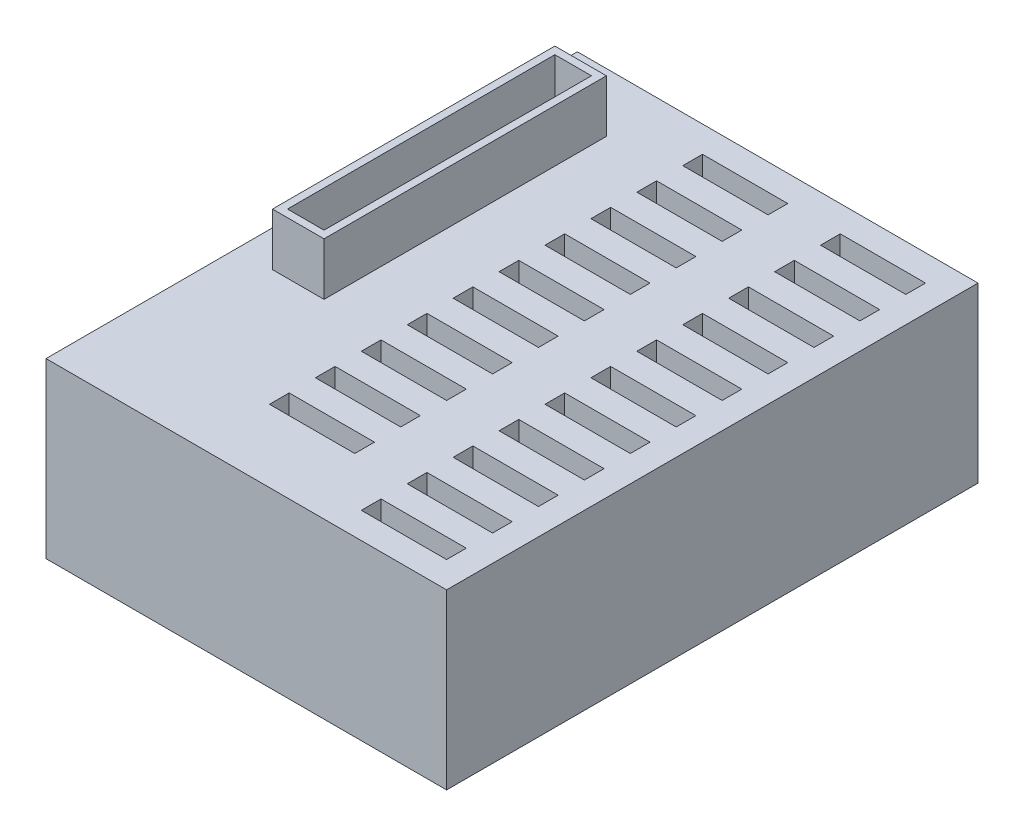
ISO-10303-21;
HEADER;
FILE_DESCRIPTION(('STEP AP214'),'2;1');
FILE_NAME('part.step','',(''),(''),'','','');
FILE_SCHEMA(('AUTOMOTIVE_DESIGN { 1 0 10303 214 1 1 1 1 }'));
ENDSEC;
DATA;
#1=APPLICATION_CONTEXT('core data for automotive mechanical design processes');
#2=APPLICATION_PROTOCOL_DEFINITION('international standard','automotive_design',2000,#1);
#3=PRODUCT_CONTEXT('',#1,'mechanical');
#4=PRODUCT('Part','Part','',(#3));
#5=PRODUCT_RELATED_PRODUCT_CATEGORY('part','',(#4));
#6=PRODUCT_DEFINITION_FORMATION('','',#4);
#7=PRODUCT_DEFINITION_CONTEXT('part definition',#1,'design');
#8=PRODUCT_DEFINITION('design','',#6,#7);
#9=PRODUCT_DEFINITION_SHAPE('','',#8);
#10=(LENGTH_UNIT() NAMED_UNIT(*) SI_UNIT(.MILLI.,.METRE.));
#11=(NAMED_UNIT(*) PLANE_ANGLE_UNIT() SI_UNIT($,.RADIAN.));
#12=(NAMED_UNIT(*) SI_UNIT($,.STERADIAN.) SOLID_ANGLE_UNIT());
#13=UNCERTAINTY_MEASURE_WITH_UNIT(LENGTH_MEASURE(1.E-05),#10,'distance_accuracy_value','');
#14=(GEOMETRIC_REPRESENTATION_CONTEXT(3) GLOBAL_UNCERTAINTY_ASSIGNED_CONTEXT((#13)) GLOBAL_UNIT_ASSIGNED_CONTEXT((#10,
#11,#12)) REPRESENTATION_CONTEXT('',''));
#15=CARTESIAN_POINT('',(0.,0.,0.));
#16=DIRECTION('',(0.,0.,1.));
#17=DIRECTION('',(1.,0.,0.));
#18=AXIS2_PLACEMENT_3D('',#15,#16,#17);
#19=CARTESIAN_POINT('',(-103.460168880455,-18.04,126.974383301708));
#20=DIRECTION('',(-1.,0.,0.));
#21=DIRECTION('',(0.,0.,1.));
#22=AXIS2_PLACEMENT_3D('',#19,#20,#21);
#23=PLANE('',#22);
#24=DIRECTION('',(0.,1.,0.));
#25=VECTOR('',#24,1.);
#26=CARTESIAN_POINT('',(-103.460168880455,-66.04,-65.5256166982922));
#27=LINE('',#26,#25);
#28=CARTESIAN_POINT('',(-103.460168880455,-66.04,-65.5256166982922));
#29=VERTEX_POINT('',#28);
#30=CARTESIAN_POINT('',(-103.460168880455,-18.04,-65.5256166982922));
#31=VERTEX_POINT('',#30);
#32=EDGE_CURVE('E740',#29,#31,#27,.T.);
#33=ORIENTED_EDGE('',*,*,#32,.T.);
#34=DIRECTION('',(0.,0.,-1.));
#35=VECTOR('',#34,1.);
#36=CARTESIAN_POINT('',(-103.460168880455,-18.04,126.974383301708));
#37=LINE('',#36,#35);
#38=CARTESIAN_POINT('',(-103.460168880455,-18.04,126.974383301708));
#39=VERTEX_POINT('',#38);
#40=EDGE_CURVE('E756',#39,#31,#37,.T.);
#41=ORIENTED_EDGE('',*,*,#40,.F.);
#42=DIRECTION('',(0.,-1.,0.));
#43=VECTOR('',#42,1.);
#44=CARTESIAN_POINT('',(-103.460168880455,-18.04,126.974383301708));
#45=LINE('',#44,#43);
#46=CARTESIAN_POINT('',(-103.460168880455,-66.04,126.974383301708));
#47=VERTEX_POINT('',#46);
#48=EDGE_CURVE('E772',#39,#47,#45,.T.);
#49=ORIENTED_EDGE('',*,*,#48,.T.);
#50=DIRECTION('',(0.,0.,-1.));
#51=VECTOR('',#50,1.);
#52=CARTESIAN_POINT('',(-103.460168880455,-66.04,126.974383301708));
#53=LINE('',#52,#51);
#54=EDGE_CURVE('E754',#47,#29,#53,.T.);
#55=ORIENTED_EDGE('',*,*,#54,.T.);
#56=EDGE_LOOP('',(#33,#41,#49,#55));
#57=FACE_BOUND('',#56,.T.);
#58=ADVANCED_FACE('F39',(#57),#23,.F.);
#59=CARTESIAN_POINT('',(39.2068311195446,-18.04,126.974383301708));
#60=DIRECTION('',(1.,0.,0.));
#61=DIRECTION('',(0.,0.,-1.));
#62=AXIS2_PLACEMENT_3D('',#59,#60,#61);
#63=PLANE('',#62);
#64=DIRECTION('',(0.,1.,0.));
#65=VECTOR('',#64,1.);
#66=CARTESIAN_POINT('',(39.2068311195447,-66.04,-65.5256166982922));
#67=LINE('',#66,#65);
#68=CARTESIAN_POINT('',(39.2068311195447,-66.04,-65.5256166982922));
#69=VERTEX_POINT('',#68);
#70=CARTESIAN_POINT('',(39.2068311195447,-18.04,-65.5256166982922));
#71=VERTEX_POINT('',#70);
#72=EDGE_CURVE('E744',#69,#71,#67,.T.);
#73=ORIENTED_EDGE('',*,*,#72,.F.);
#74=DIRECTION('',(0.,0.,1.));
#75=VECTOR('',#74,1.);
#76=CARTESIAN_POINT('',(39.2068311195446,-66.04,126.974383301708));
#77=LINE('',#76,#75);
#78=CARTESIAN_POINT('',(39.2068311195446,-66.04,126.974383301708));
#79=VERTEX_POINT('',#78);
#80=EDGE_CURVE('E768',#69,#79,#77,.T.);
#81=ORIENTED_EDGE('',*,*,#80,.T.);
#82=DIRECTION('',(0.,-1.,0.));
#83=VECTOR('',#82,1.);
#84=CARTESIAN_POINT('',(39.2068311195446,-18.04,126.974383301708));
#85=LINE('',#84,#83);
#86=CARTESIAN_POINT('',(39.2068311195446,-18.04,126.974383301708));
#87=VERTEX_POINT('',#86);
#88=EDGE_CURVE('E765',#87,#79,#85,.T.);
#89=ORIENTED_EDGE('',*,*,#88,.F.);
#90=DIRECTION('',(0.,0.,1.));
#91=VECTOR('',#90,1.);
#92=CARTESIAN_POINT('',(39.2068311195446,-18.04,126.974383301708));
#93=LINE('',#92,#91);
#94=EDGE_CURVE('E759',#71,#87,#93,.T.);
#95=ORIENTED_EDGE('',*,*,#94,.F.);
#96=EDGE_LOOP('',(#73,#81,#89,#95));
#97=FACE_BOUND('',#96,.T.);
#98=ADVANCED_FACE('F1497',(#97),#63,.F.);
#99=CARTESIAN_POINT('',(0.,-18.04,0.));
#100=DIRECTION('',(0.,-1.,0.));
#101=DIRECTION('',(0.,0.,-1.));
#102=AXIS2_PLACEMENT_3D('',#99,#100,#101);
#103=PLANE('',#102);
#104=ORIENTED_EDGE('',*,*,#40,.T.);
#105=DIRECTION('',(-1.,0.,0.));
#106=VECTOR('',#105,1.);
#107=CARTESIAN_POINT('',(-103.460168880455,-18.04,-65.5256166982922));
#108=LINE('',#107,#106);
#109=EDGE_CURVE('E729',#71,#31,#108,.T.);
#110=ORIENTED_EDGE('',*,*,#109,.F.);
#111=ORIENTED_EDGE('',*,*,#94,.T.);
#112=DIRECTION('',(-1.,0.,0.));
#113=VECTOR('',#112,1.);
#114=CARTESIAN_POINT('',(-103.460168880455,-18.04,126.974383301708));
#115=LINE('',#114,#113);
#116=EDGE_CURVE('E762',#87,#39,#115,.T.);
#117=ORIENTED_EDGE('',*,*,#116,.T.);
#118=EDGE_LOOP('',(#104,#110,#111,#117));
#119=FACE_BOUND('',#118,.T.);
#120=ADVANCED_FACE('F1495',(#119),#103,.T.);
#121=CARTESIAN_POINT('',(44.2068311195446,-66.04,-79.5256166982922));
#122=DIRECTION('',(1.,0.,0.));
#123=DIRECTION('',(0.,0.,-1.));
#124=AXIS2_PLACEMENT_3D('',#121,#122,#123);
#125=PLANE('',#124);
#126=DIRECTION('',(0.,1.,0.));
#127=VECTOR('',#126,1.);
#128=CARTESIAN_POINT('',(44.2068311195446,-66.04,-70.5256166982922));
#129=LINE('',#128,#127);
#130=CARTESIAN_POINT('',(44.2068311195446,-66.04,-70.5256166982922));
#131=VERTEX_POINT('',#130);
#132=CARTESIAN_POINT('',(44.2068311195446,0.,-70.5256166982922));
#133=VERTEX_POINT('',#132);
#134=EDGE_CURVE('E751',#131,#133,#129,.T.);
#135=ORIENTED_EDGE('',*,*,#134,.T.);
#136=DIRECTION('',(0.,0.,-1.));
#137=VECTOR('',#136,1.);
#138=CARTESIAN_POINT('',(44.2068311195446,0.,-79.5256166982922));
#139=LINE('',#138,#137);
#140=CARTESIAN_POINT('',(44.2068311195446,0.,131.974383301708));
#141=VERTEX_POINT('',#140);
#142=EDGE_CURVE('E1460',#141,#133,#139,.T.);
#143=ORIENTED_EDGE('',*,*,#142,.F.);
#144=DIRECTION('',(0.,1.,0.));
#145=VECTOR('',#144,1.);
#146=CARTESIAN_POINT('',(44.2068311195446,-66.04,131.974383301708));
#147=LINE('',#146,#145);
#148=CARTESIAN_POINT('',(44.2068311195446,-66.04,131.974383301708));
#149=VERTEX_POINT('',#148);
#150=EDGE_CURVE('E11',#149,#141,#147,.T.);
#151=ORIENTED_EDGE('',*,*,#150,.F.);
#152=DIRECTION('',(0.,0.,-1.));
#153=VECTOR('',#152,1.);
#154=CARTESIAN_POINT('',(44.2068311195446,-66.04,-79.5256166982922));
#155=LINE('',#154,#153);
#156=EDGE_CURVE('E47',#149,#131,#155,.T.);
#157=ORIENTED_EDGE('',*,*,#156,.T.);
#158=EDGE_LOOP('',(#135,#143,#151,#157));
#159=FACE_BOUND('',#158,.T.);
#160=ADVANCED_FACE('F1472',(#159),#125,.T.);
#161=CARTESIAN_POINT('',(-105.793168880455,-66.04,131.974383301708));
#162=DIRECTION('',(0.,0.,1.));
#163=DIRECTION('',(1.,0.,0.));
#164=AXIS2_PLACEMENT_3D('',#161,#162,#163);
#165=PLANE('',#164);
#166=DIRECTION('',(1.,0.,0.));
#167=VECTOR('',#166,1.);
#168=CARTESIAN_POINT('',(-105.793168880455,0.,131.974383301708));
#169=LINE('',#168,#167);
#170=CARTESIAN_POINT('',(-108.460168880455,0.,131.974383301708));
#171=VERTEX_POINT('',#170);
#172=EDGE_CURVE('E812',#171,#141,#169,.T.);
#173=ORIENTED_EDGE('',*,*,#172,.F.);
#174=DIRECTION('',(0.,1.,0.));
#175=VECTOR('',#174,1.);
#176=CARTESIAN_POINT('',(-108.460168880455,-66.04,131.974383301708));
#177=LINE('',#176,#175);
#178=CARTESIAN_POINT('',(-108.460168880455,-66.04,131.974383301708));
#179=VERTEX_POINT('',#178);
#180=EDGE_CURVE('E778',#179,#171,#177,.T.);
#181=ORIENTED_EDGE('',*,*,#180,.F.);
#182=DIRECTION('',(1.,0.,0.));
#183=VECTOR('',#182,1.);
#184=CARTESIAN_POINT('',(-105.793168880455,-66.04,131.974383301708));
#185=LINE('',#184,#183);
#186=EDGE_CURVE('E1457',#179,#149,#185,.T.);
#187=ORIENTED_EDGE('',*,*,#186,.T.);
#188=ORIENTED_EDGE('',*,*,#150,.T.);
#189=EDGE_LOOP('',(#173,#181,#187,#188));
#190=FACE_BOUND('',#189,.T.);
#191=ADVANCED_FACE('F41',(#190),#165,.T.);
#192=CARTESIAN_POINT('',(0.,-66.04,0.));
#193=DIRECTION('',(0.,1.,0.));
#194=DIRECTION('',(0.,0.,1.));
#195=AXIS2_PLACEMENT_3D('',#192,#193,#194);
#196=PLANE('',#195);
#197=DIRECTION('',(1.,0.,0.));
#198=VECTOR('',#197,1.);
#199=CARTESIAN_POINT('',(-108.460168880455,-66.04,-70.5256166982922));
#200=LINE('',#199,#198);
#201=CARTESIAN_POINT('',(-108.460168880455,-66.04,-70.5256166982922));
#202=VERTEX_POINT('',#201);
#203=EDGE_CURVE('E747',#202,#131,#200,.T.);
#204=ORIENTED_EDGE('',*,*,#203,.T.);
#205=ORIENTED_EDGE('',*,*,#156,.F.);
#206=ORIENTED_EDGE('',*,*,#186,.F.);
#207=DIRECTION('',(0.,0.,1.));
#208=VECTOR('',#207,1.);
#209=CARTESIAN_POINT('',(-108.460168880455,-66.04,-79.5256166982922));
#210=LINE('',#209,#208);
#211=EDGE_CURVE('E774',#202,#179,#210,.T.);
#212=ORIENTED_EDGE('',*,*,#211,.F.);
#213=EDGE_LOOP('',(#204,#205,#206,#212));
#214=FACE_BOUND('',#213,.T.);
#215=DIRECTION('',(-1.,0.,0.));
#216=VECTOR('',#215,1.);
#217=CARTESIAN_POINT('',(-103.460168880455,-66.04,-65.5256166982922));
#218=LINE('',#217,#216);
#219=EDGE_CURVE('E738',#69,#29,#218,.T.);
#220=ORIENTED_EDGE('',*,*,#219,.T.);
#221=ORIENTED_EDGE('',*,*,#54,.F.);
#222=DIRECTION('',(-1.,0.,0.));
#223=VECTOR('',#222,1.);
#224=CARTESIAN_POINT('',(-103.460168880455,-66.04,126.974383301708));
#225=LINE('',#224,#223);
#226=EDGE_CURVE('E760',#79,#47,#225,.T.);
#227=ORIENTED_EDGE('',*,*,#226,.F.);
#228=ORIENTED_EDGE('',*,*,#80,.F.);
#229=EDGE_LOOP('',(#220,#221,#227,#228));
#230=FACE_BOUND('',#229,.T.);
#231=ADVANCED_FACE('F1483',(#214,#230),#196,.F.);
#232=CARTESIAN_POINT('',(0.,0.,0.));
#233=DIRECTION('',(0.,1.,0.));
#234=DIRECTION('',(0.,0.,1.));
#235=AXIS2_PLACEMENT_3D('',#232,#233,#234);
#236=PLANE('',#235);
#237=DIRECTION('',(0.,0.,1.));
#238=VECTOR('',#237,1.);
#239=CARTESIAN_POINT('',(-75.0049688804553,0.,0.));
#240=LINE('',#239,#238);
#241=CARTESIAN_POINT('',(-75.0049688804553,0.,-48.1256166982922));
#242=VERTEX_POINT('',#241);
#243=CARTESIAN_POINT('',(-75.0049688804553,0.,59.4743833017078));
#244=VERTEX_POINT('',#243);
#245=EDGE_CURVE('E662',#242,#244,#240,.T.);
#246=ORIENTED_EDGE('',*,*,#245,.T.);
#247=DIRECTION('',(1.,0.,0.));
#248=VECTOR('',#247,1.);
#249=CARTESIAN_POINT('',(0.,0.,59.4743833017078));
#250=LINE('',#249,#248);
#251=CARTESIAN_POINT('',(-94.6449688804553,0.,59.4743833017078));
#252=VERTEX_POINT('',#251);
#253=EDGE_CURVE('E703',#252,#244,#250,.T.);
#254=ORIENTED_EDGE('',*,*,#253,.F.);
#255=DIRECTION('',(0.,0.,1.));
#256=VECTOR('',#255,1.);
#257=CARTESIAN_POINT('',(-94.6449688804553,0.,0.));
#258=LINE('',#257,#256);
#259=CARTESIAN_POINT('',(-94.6449688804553,0.,-48.1256166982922));
#260=VERTEX_POINT('',#259);
#261=EDGE_CURVE('E701',#260,#252,#258,.T.);
#262=ORIENTED_EDGE('',*,*,#261,.F.);
#263=DIRECTION('',(1.,0.,0.));
#264=VECTOR('',#263,1.);
#265=CARTESIAN_POINT('',(0.,0.,-48.1256166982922));
#266=LINE('',#265,#264);
#267=EDGE_CURVE('E699',#260,#242,#266,.T.);
#268=ORIENTED_EDGE('',*,*,#267,.T.);
#269=EDGE_LOOP('',(#246,#254,#262,#268));
#270=FACE_BOUND('',#269,.T.);
#271=DIRECTION('',(1.,0.,0.));
#272=VECTOR('',#271,1.);
#273=CARTESIAN_POINT('',(-108.460168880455,0.,-70.5256166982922));
#274=LINE('',#273,#272);
#275=CARTESIAN_POINT('',(-108.460168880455,0.,-70.5256166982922));
#276=VERTEX_POINT('',#275);
#277=EDGE_CURVE('E746',#276,#133,#274,.T.);
#278=ORIENTED_EDGE('',*,*,#277,.F.);
#279=DIRECTION('',(0.,0.,-1.));
#280=VECTOR('',#279,1.);
#281=CARTESIAN_POINT('',(-108.460168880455,0.,-79.5256166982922));
#282=LINE('',#281,#280);
#283=EDGE_CURVE('E781',#171,#276,#282,.T.);
#284=ORIENTED_EDGE('',*,*,#283,.F.);
#285=ORIENTED_EDGE('',*,*,#172,.T.);
#286=ORIENTED_EDGE('',*,*,#142,.T.);
#287=EDGE_LOOP('',(#278,#284,#285,#286));
#288=FACE_BOUND('',#287,.T.);
#289=DIRECTION('',(-1.,0.,0.));
#290=VECTOR('',#289,1.);
#291=CARTESIAN_POINT('',(1.70683111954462,0.,114.474383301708));
#292=LINE('',#291,#290);
#293=CARTESIAN_POINT('',(34.2068311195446,0.,114.474383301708));
#294=VERTEX_POINT('',#293);
#295=CARTESIAN_POINT('',(1.70683111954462,0.,114.474383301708));
#296=VERTEX_POINT('',#295);
#297=EDGE_CURVE('E799',#294,#296,#292,.T.);
#298=ORIENTED_EDGE('',*,*,#297,.F.);
#299=DIRECTION('',(0.,0.,-1.));
#300=VECTOR('',#299,1.);
#301=CARTESIAN_POINT('',(34.2068311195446,0.,114.474383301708));
#302=LINE('',#301,#300);
#303=CARTESIAN_POINT('',(34.2068311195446,0.,121.974383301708));
#304=VERTEX_POINT('',#303);
#305=EDGE_CURVE('E789',#304,#294,#302,.T.);
#306=ORIENTED_EDGE('',*,*,#305,.F.);
#307=DIRECTION('',(1.,0.,0.));
#308=VECTOR('',#307,1.);
#309=CARTESIAN_POINT('',(1.70683111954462,0.,121.974383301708));
#310=LINE('',#309,#308);
#311=CARTESIAN_POINT('',(1.70683111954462,0.,121.974383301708));
#312=VERTEX_POINT('',#311);
#313=EDGE_CURVE('E805',#312,#304,#310,.T.);
#314=ORIENTED_EDGE('',*,*,#313,.F.);
#315=DIRECTION('',(0.,0.,1.));
#316=VECTOR('',#315,1.);
#317=CARTESIAN_POINT('',(1.70683111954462,0.,114.474383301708));
#318=LINE('',#317,#316);
#319=EDGE_CURVE('E801',#296,#312,#318,.T.);
#320=ORIENTED_EDGE('',*,*,#319,.F.);
#321=EDGE_LOOP('',(#298,#306,#314,#320));
#322=FACE_BOUND('',#321,.T.);
#323=DIRECTION('',(-1.,0.,0.));
#324=VECTOR('',#323,1.);
#325=CARTESIAN_POINT('',(1.70683111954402,0.,-60.5256166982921));
#326=LINE('',#325,#324);
#327=CARTESIAN_POINT('',(34.206831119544,0.,-60.5256166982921));
#328=VERTEX_POINT('',#327);
#329=CARTESIAN_POINT('',(1.70683111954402,0.,-60.5256166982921));
#330=VERTEX_POINT('',#329);
#331=EDGE_CURVE('E895',#328,#330,#326,.T.);
#332=ORIENTED_EDGE('',*,*,#331,.F.);
#333=DIRECTION('',(0.,0.,-1.));
#334=VECTOR('',#333,1.);
#335=CARTESIAN_POINT('',(34.206831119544,0.,-60.5256166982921));
#336=LINE('',#335,#334);
#337=CARTESIAN_POINT('',(34.206831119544,0.,-53.0256166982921));
#338=VERTEX_POINT('',#337);
#339=EDGE_CURVE('E926',#338,#328,#336,.T.);
#340=ORIENTED_EDGE('',*,*,#339,.F.);
#341=DIRECTION('',(1.,0.,0.));
#342=VECTOR('',#341,1.);
#343=CARTESIAN_POINT('',(1.70683111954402,0.,-53.0256166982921));
#344=LINE('',#343,#342);
#345=CARTESIAN_POINT('',(1.70683111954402,0.,-53.0256166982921));
#346=VERTEX_POINT('',#345);
#347=EDGE_CURVE('E929',#346,#338,#344,.T.);
#348=ORIENTED_EDGE('',*,*,#347,.F.);
#349=DIRECTION('',(0.,0.,1.));
#350=VECTOR('',#349,1.);
#351=CARTESIAN_POINT('',(1.70683111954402,0.,-60.5256166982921));
#352=LINE('',#351,#350);
#353=EDGE_CURVE('E933',#330,#346,#352,.T.);
#354=ORIENTED_EDGE('',*,*,#353,.F.);
#355=EDGE_LOOP('',(#332,#340,#348,#354));
#356=FACE_BOUND('',#355,.T.);
#357=DIRECTION('',(-1.,0.,0.));
#358=VECTOR('',#357,1.);
#359=CARTESIAN_POINT('',(1.70683111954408,0.,-43.0256166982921));
#360=LINE('',#359,#358);
#361=CARTESIAN_POINT('',(34.2068311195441,0.,-43.0256166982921));
#362=VERTEX_POINT('',#361);
#363=CARTESIAN_POINT('',(1.70683111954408,0.,-43.0256166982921));
#364=VERTEX_POINT('',#363);
#365=EDGE_CURVE('E863',#362,#364,#360,.T.);
#366=ORIENTED_EDGE('',*,*,#365,.F.);
#367=DIRECTION('',(0.,0.,-1.));
#368=VECTOR('',#367,1.);
#369=CARTESIAN_POINT('',(34.2068311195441,0.,-43.0256166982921));
#370=LINE('',#369,#368);
#371=CARTESIAN_POINT('',(34.2068311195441,0.,-35.5256166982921));
#372=VERTEX_POINT('',#371);
#373=EDGE_CURVE('E896',#372,#362,#370,.T.);
#374=ORIENTED_EDGE('',*,*,#373,.F.);
#375=DIRECTION('',(1.,0.,0.));
#376=VECTOR('',#375,1.);
#377=CARTESIAN_POINT('',(1.70683111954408,0.,-35.5256166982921));
#378=LINE('',#377,#376);
#379=CARTESIAN_POINT('',(1.70683111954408,0.,-35.5256166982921));
#380=VERTEX_POINT('',#379);
#381=EDGE_CURVE('E899',#380,#372,#378,.T.);
#382=ORIENTED_EDGE('',*,*,#381,.F.);
#383=DIRECTION('',(0.,0.,1.));
#384=VECTOR('',#383,1.);
#385=CARTESIAN_POINT('',(1.70683111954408,0.,-43.0256166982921));
#386=LINE('',#385,#384);
#387=EDGE_CURVE('E903',#364,#380,#386,.T.);
#388=ORIENTED_EDGE('',*,*,#387,.F.);
#389=EDGE_LOOP('',(#366,#374,#382,#388));
#390=FACE_BOUND('',#389,.T.);
#391=DIRECTION('',(-1.,0.,0.));
#392=VECTOR('',#391,1.);
#393=CARTESIAN_POINT('',(1.70683111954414,0.,-25.5256166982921));
#394=LINE('',#393,#392);
#395=CARTESIAN_POINT('',(34.2068311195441,0.,-25.5256166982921));
#396=VERTEX_POINT('',#395);
#397=CARTESIAN_POINT('',(1.70683111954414,0.,-25.5256166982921));
#398=VERTEX_POINT('',#397);
#399=EDGE_CURVE('E829',#396,#398,#394,.T.);
#400=ORIENTED_EDGE('',*,*,#399,.F.);
#401=DIRECTION('',(0.,0.,-1.));
#402=VECTOR('',#401,1.);
#403=CARTESIAN_POINT('',(34.2068311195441,0.,-25.5256166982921));
#404=LINE('',#403,#402);
#405=CARTESIAN_POINT('',(34.2068311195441,0.,-18.0256166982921));
#406=VERTEX_POINT('',#405);
#407=EDGE_CURVE('E864',#406,#396,#404,.T.);
#408=ORIENTED_EDGE('',*,*,#407,.F.);
#409=DIRECTION('',(1.,0.,0.));
#410=VECTOR('',#409,1.);
#411=CARTESIAN_POINT('',(1.70683111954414,0.,-18.0256166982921));
#412=LINE('',#411,#410);
#413=CARTESIAN_POINT('',(1.70683111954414,0.,-18.0256166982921));
#414=VERTEX_POINT('',#413);
#415=EDGE_CURVE('E867',#414,#406,#412,.T.);
#416=ORIENTED_EDGE('',*,*,#415,.F.);
#417=DIRECTION('',(0.,0.,1.));
#418=VECTOR('',#417,1.);
#419=CARTESIAN_POINT('',(1.70683111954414,0.,-25.5256166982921));
#420=LINE('',#419,#418);
#421=EDGE_CURVE('E871',#398,#414,#420,.T.);
#422=ORIENTED_EDGE('',*,*,#421,.F.);
#423=EDGE_LOOP('',(#400,#408,#416,#422));
#424=FACE_BOUND('',#423,.T.);
#425=DIRECTION('',(-1.,0.,0.));
#426=VECTOR('',#425,1.);
#427=CARTESIAN_POINT('',(1.7068311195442,0.,-8.0256166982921));
#428=LINE('',#427,#426);
#429=CARTESIAN_POINT('',(34.2068311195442,0.,-8.0256166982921));
#430=VERTEX_POINT('',#429);
#431=CARTESIAN_POINT('',(1.7068311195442,0.,-8.0256166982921));
#432=VERTEX_POINT('',#431);
#433=EDGE_CURVE('E840',#430,#432,#428,.T.);
#434=ORIENTED_EDGE('',*,*,#433,.F.);
#435=DIRECTION('',(0.,0.,-1.));
#436=VECTOR('',#435,1.);
#437=CARTESIAN_POINT('',(34.2068311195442,0.,-8.0256166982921));
#438=LINE('',#437,#436);
#439=CARTESIAN_POINT('',(34.2068311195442,0.,-0.525616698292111));
#440=VERTEX_POINT('',#439);
#441=EDGE_CURVE('E830',#440,#430,#438,.T.);
#442=ORIENTED_EDGE('',*,*,#441,.F.);
#443=DIRECTION('',(1.,0.,0.));
#444=VECTOR('',#443,1.);
#445=CARTESIAN_POINT('',(1.7068311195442,0.,-0.525616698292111));
#446=LINE('',#445,#444);
#447=CARTESIAN_POINT('',(1.7068311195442,0.,-0.525616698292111));
#448=VERTEX_POINT('',#447);
#449=EDGE_CURVE('E833',#448,#440,#446,.T.);
#450=ORIENTED_EDGE('',*,*,#449,.F.);
#451=DIRECTION('',(0.,0.,1.));
#452=VECTOR('',#451,1.);
#453=CARTESIAN_POINT('',(1.7068311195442,0.,-8.0256166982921));
#454=LINE('',#453,#452);
#455=EDGE_CURVE('E837',#432,#448,#454,.T.);
#456=ORIENTED_EDGE('',*,*,#455,.F.);
#457=EDGE_LOOP('',(#434,#442,#450,#456));
#458=FACE_BOUND('',#457,.T.);
#459=DIRECTION('',(-1.,0.,0.));
#460=VECTOR('',#459,1.);
#461=CARTESIAN_POINT('',(-50.7931688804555,0.,96.9743833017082));
#462=LINE('',#461,#460);
#463=CARTESIAN_POINT('',(-18.2931688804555,0.,96.9743833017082));
#464=VERTEX_POINT('',#463);
#465=CARTESIAN_POINT('',(-50.7931688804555,0.,96.9743833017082));
#466=VERTEX_POINT('',#465);
#467=EDGE_CURVE('E802',#464,#466,#462,.T.);
#468=ORIENTED_EDGE('',*,*,#467,.F.);
#469=DIRECTION('',(0.,0.,-1.));
#470=VECTOR('',#469,1.);
#471=CARTESIAN_POINT('',(-18.2931688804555,0.,96.9743833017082));
#472=LINE('',#471,#470);
#473=CARTESIAN_POINT('',(-18.2931688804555,0.,104.474383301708));
#474=VERTEX_POINT('',#473);
#475=EDGE_CURVE('E1214',#474,#464,#472,.T.);
#476=ORIENTED_EDGE('',*,*,#475,.F.);
#477=DIRECTION('',(1.,0.,0.));
#478=VECTOR('',#477,1.);
#479=CARTESIAN_POINT('',(-50.7931688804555,0.,104.474383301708));
#480=LINE('',#479,#478);
#481=CARTESIAN_POINT('',(-50.7931688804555,0.,104.474383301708));
#482=VERTEX_POINT('',#481);
#483=EDGE_CURVE('E1217',#482,#474,#480,.T.);
#484=ORIENTED_EDGE('',*,*,#483,.F.);
#485=DIRECTION('',(0.,0.,1.));
#486=VECTOR('',#485,1.);
#487=CARTESIAN_POINT('',(-50.7931688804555,0.,96.9743833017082));
#488=LINE('',#487,#486);
#489=EDGE_CURVE('E1221',#466,#482,#488,.T.);
#490=ORIENTED_EDGE('',*,*,#489,.F.);
#491=EDGE_LOOP('',(#468,#476,#484,#490));
#492=FACE_BOUND('',#491,.T.);
#493=DIRECTION('',(-1.,0.,0.));
#494=VECTOR('',#493,1.);
#495=CARTESIAN_POINT('',(-50.7931688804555,0.,79.4743833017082));
#496=LINE('',#495,#494);
#497=CARTESIAN_POINT('',(-18.2931688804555,0.,79.4743833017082));
#498=VERTEX_POINT('',#497);
#499=CARTESIAN_POINT('',(-50.7931688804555,0.,79.4743833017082));
#500=VERTEX_POINT('',#499);
#501=EDGE_CURVE('E1213',#498,#500,#496,.T.);
#502=ORIENTED_EDGE('',*,*,#501,.F.);
#503=DIRECTION('',(0.,0.,-1.));
#504=VECTOR('',#503,1.);
#505=CARTESIAN_POINT('',(-18.2931688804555,0.,79.4743833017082));
#506=LINE('',#505,#504);
#507=CARTESIAN_POINT('',(-18.2931688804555,0.,86.9743833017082));
#508=VERTEX_POINT('',#507);
#509=EDGE_CURVE('E1246',#508,#498,#506,.T.);
#510=ORIENTED_EDGE('',*,*,#509,.F.);
#511=DIRECTION('',(1.,0.,0.));
#512=VECTOR('',#511,1.);
#513=CARTESIAN_POINT('',(-50.7931688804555,0.,86.9743833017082));
#514=LINE('',#513,#512);
#515=CARTESIAN_POINT('',(-50.7931688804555,0.,86.9743833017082));
#516=VERTEX_POINT('',#515);
#517=EDGE_CURVE('E1249',#516,#508,#514,.T.);
#518=ORIENTED_EDGE('',*,*,#517,.F.);
#519=DIRECTION('',(0.,0.,1.));
#520=VECTOR('',#519,1.);
#521=CARTESIAN_POINT('',(-50.7931688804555,0.,79.4743833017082));
#522=LINE('',#521,#520);
#523=EDGE_CURVE('E1253',#500,#516,#522,.T.);
#524=ORIENTED_EDGE('',*,*,#523,.F.);
#525=EDGE_LOOP('',(#502,#510,#518,#524));
#526=FACE_BOUND('',#525,.T.);
#527=DIRECTION('',(-1.,0.,0.));
#528=VECTOR('',#527,1.);
#529=CARTESIAN_POINT('',(-50.7931688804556,0.,61.9743833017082));
#530=LINE('',#529,#528);
#531=CARTESIAN_POINT('',(-18.2931688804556,0.,61.9743833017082));
#532=VERTEX_POINT('',#531);
#533=CARTESIAN_POINT('',(-50.7931688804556,0.,61.9743833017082));
#534=VERTEX_POINT('',#533);
#535=EDGE_CURVE('E1245',#532,#534,#530,.T.);
#536=ORIENTED_EDGE('',*,*,#535,.F.);
#537=DIRECTION('',(0.,0.,-1.));
#538=VECTOR('',#537,1.);
#539=CARTESIAN_POINT('',(-18.2931688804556,0.,61.9743833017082));
#540=LINE('',#539,#538);
#541=CARTESIAN_POINT('',(-18.2931688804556,0.,69.4743833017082));
#542=VERTEX_POINT('',#541);
#543=EDGE_CURVE('E1278',#542,#532,#540,.T.);
#544=ORIENTED_EDGE('',*,*,#543,.F.);
#545=DIRECTION('',(1.,0.,0.));
#546=VECTOR('',#545,1.);
#547=CARTESIAN_POINT('',(-50.7931688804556,0.,69.4743833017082));
#548=LINE('',#547,#546);
#549=CARTESIAN_POINT('',(-50.7931688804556,0.,69.4743833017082));
#550=VERTEX_POINT('',#549);
#551=EDGE_CURVE('E1281',#550,#542,#548,.T.);
#552=ORIENTED_EDGE('',*,*,#551,.F.);
#553=DIRECTION('',(0.,0.,1.));
#554=VECTOR('',#553,1.);
#555=CARTESIAN_POINT('',(-50.7931688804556,0.,61.9743833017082));
#556=LINE('',#555,#554);
#557=EDGE_CURVE('E1285',#534,#550,#556,.T.);
#558=ORIENTED_EDGE('',*,*,#557,.F.);
#559=EDGE_LOOP('',(#536,#544,#552,#558));
#560=FACE_BOUND('',#559,.T.);
#561=DIRECTION('',(-1.,0.,0.));
#562=VECTOR('',#561,1.);
#563=CARTESIAN_POINT('',(-50.7931688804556,0.,44.4743833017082));
#564=LINE('',#563,#562);
#565=CARTESIAN_POINT('',(-18.2931688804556,0.,44.4743833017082));
#566=VERTEX_POINT('',#565);
#567=CARTESIAN_POINT('',(-50.7931688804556,0.,44.4743833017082));
#568=VERTEX_POINT('',#567);
#569=EDGE_CURVE('E1277',#566,#568,#564,.T.);
#570=ORIENTED_EDGE('',*,*,#569,.F.);
#571=DIRECTION('',(0.,0.,-1.));
#572=VECTOR('',#571,1.);
#573=CARTESIAN_POINT('',(-18.2931688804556,0.,44.4743833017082));
#574=LINE('',#573,#572);
#575=CARTESIAN_POINT('',(-18.2931688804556,0.,51.9743833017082));
#576=VERTEX_POINT('',#575);
#577=EDGE_CURVE('E1310',#576,#566,#574,.T.);
#578=ORIENTED_EDGE('',*,*,#577,.F.);
#579=DIRECTION('',(1.,0.,0.));
#580=VECTOR('',#579,1.);
#581=CARTESIAN_POINT('',(-50.7931688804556,0.,51.9743833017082));
#582=LINE('',#581,#580);
#583=CARTESIAN_POINT('',(-50.7931688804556,0.,51.9743833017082));
#584=VERTEX_POINT('',#583);
#585=EDGE_CURVE('E1313',#584,#576,#582,.T.);
#586=ORIENTED_EDGE('',*,*,#585,.F.);
#587=DIRECTION('',(0.,0.,1.));
#588=VECTOR('',#587,1.);
#589=CARTESIAN_POINT('',(-50.7931688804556,0.,44.4743833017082));
#590=LINE('',#589,#588);
#591=EDGE_CURVE('E1317',#568,#584,#590,.T.);
#592=ORIENTED_EDGE('',*,*,#591,.F.);
#593=EDGE_LOOP('',(#570,#578,#586,#592));
#594=FACE_BOUND('',#593,.T.);
#595=DIRECTION('',(-1.,0.,0.));
#596=VECTOR('',#595,1.);
#597=CARTESIAN_POINT('',(-50.7931688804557,0.,26.9743833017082));
#598=LINE('',#597,#596);
#599=CARTESIAN_POINT('',(-18.2931688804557,0.,26.9743833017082));
#600=VERTEX_POINT('',#599);
#601=CARTESIAN_POINT('',(-50.7931688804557,0.,26.9743833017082));
#602=VERTEX_POINT('',#601);
#603=EDGE_CURVE('E1309',#600,#602,#598,.T.);
#604=ORIENTED_EDGE('',*,*,#603,.F.);
#605=DIRECTION('',(0.,0.,-1.));
#606=VECTOR('',#605,1.);
#607=CARTESIAN_POINT('',(-18.2931688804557,0.,26.9743833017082));
#608=LINE('',#607,#606);
#609=CARTESIAN_POINT('',(-18.2931688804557,0.,34.4743833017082));
#610=VERTEX_POINT('',#609);
#611=EDGE_CURVE('E1342',#610,#600,#608,.T.);
#612=ORIENTED_EDGE('',*,*,#611,.F.);
#613=DIRECTION('',(1.,0.,0.));
#614=VECTOR('',#613,1.);
#615=CARTESIAN_POINT('',(-50.7931688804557,0.,34.4743833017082));
#616=LINE('',#615,#614);
#617=CARTESIAN_POINT('',(-50.7931688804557,0.,34.4743833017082));
#618=VERTEX_POINT('',#617);
#619=EDGE_CURVE('E1345',#618,#610,#616,.T.);
#620=ORIENTED_EDGE('',*,*,#619,.F.);
#621=DIRECTION('',(0.,0.,1.));
#622=VECTOR('',#621,1.);
#623=CARTESIAN_POINT('',(-50.7931688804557,0.,26.9743833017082));
#624=LINE('',#623,#622);
#625=EDGE_CURVE('E1349',#602,#618,#624,.T.);
#626=ORIENTED_EDGE('',*,*,#625,.F.);
#627=EDGE_LOOP('',(#604,#612,#620,#626));
#628=FACE_BOUND('',#627,.T.);
#629=DIRECTION('',(-1.,0.,0.));
#630=VECTOR('',#629,1.);
#631=CARTESIAN_POINT('',(-50.7931688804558,0.,9.47438330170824));
#632=LINE('',#631,#630);
#633=CARTESIAN_POINT('',(-18.2931688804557,0.,9.47438330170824));
#634=VERTEX_POINT('',#633);
#635=CARTESIAN_POINT('',(-50.7931688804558,0.,9.47438330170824));
#636=VERTEX_POINT('',#635);
#637=EDGE_CURVE('E1341',#634,#636,#632,.T.);
#638=ORIENTED_EDGE('',*,*,#637,.F.);
#639=DIRECTION('',(0.,0.,-1.));
#640=VECTOR('',#639,1.);
#641=CARTESIAN_POINT('',(-18.2931688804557,0.,9.47438330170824));
#642=LINE('',#641,#640);
#643=CARTESIAN_POINT('',(-18.2931688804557,0.,16.9743833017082));
#644=VERTEX_POINT('',#643);
#645=EDGE_CURVE('E1374',#644,#634,#642,.T.);
#646=ORIENTED_EDGE('',*,*,#645,.F.);
#647=DIRECTION('',(1.,0.,0.));
#648=VECTOR('',#647,1.);
#649=CARTESIAN_POINT('',(-50.7931688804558,0.,16.9743833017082));
#650=LINE('',#649,#648);
#651=CARTESIAN_POINT('',(-50.7931688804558,0.,16.9743833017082));
#652=VERTEX_POINT('',#651);
#653=EDGE_CURVE('E1377',#652,#644,#650,.T.);
#654=ORIENTED_EDGE('',*,*,#653,.F.);
#655=DIRECTION('',(0.,0.,1.));
#656=VECTOR('',#655,1.);
#657=CARTESIAN_POINT('',(-50.7931688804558,0.,9.47438330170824));
#658=LINE('',#657,#656);
#659=EDGE_CURVE('E1381',#636,#652,#658,.T.);
#660=ORIENTED_EDGE('',*,*,#659,.F.);
#661=EDGE_LOOP('',(#638,#646,#654,#660));
#662=FACE_BOUND('',#661,.T.);
#663=DIRECTION('',(-1.,0.,0.));
#664=VECTOR('',#663,1.);
#665=CARTESIAN_POINT('',(-50.7931688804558,0.,-8.02561669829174));
#666=LINE('',#665,#664);
#667=CARTESIAN_POINT('',(-18.2931688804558,0.,-8.02561669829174));
#668=VERTEX_POINT('',#667);
#669=CARTESIAN_POINT('',(-50.7931688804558,0.,-8.02561669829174));
#670=VERTEX_POINT('',#669);
#671=EDGE_CURVE('E1373',#668,#670,#666,.T.);
#672=ORIENTED_EDGE('',*,*,#671,.F.);
#673=DIRECTION('',(0.,0.,-1.));
#674=VECTOR('',#673,1.);
#675=CARTESIAN_POINT('',(-18.2931688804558,0.,-8.02561669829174));
#676=LINE('',#675,#674);
#677=CARTESIAN_POINT('',(-18.2931688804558,0.,-0.52561669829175));
#678=VERTEX_POINT('',#677);
#679=EDGE_CURVE('E1406',#678,#668,#676,.T.);
#680=ORIENTED_EDGE('',*,*,#679,.F.);
#681=DIRECTION('',(1.,0.,0.));
#682=VECTOR('',#681,1.);
#683=CARTESIAN_POINT('',(-50.7931688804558,0.,-0.52561669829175));
#684=LINE('',#683,#682);
#685=CARTESIAN_POINT('',(-50.7931688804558,0.,-0.52561669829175));
#686=VERTEX_POINT('',#685);
#687=EDGE_CURVE('E1409',#686,#678,#684,.T.);
#688=ORIENTED_EDGE('',*,*,#687,.F.);
#689=DIRECTION('',(0.,0.,1.));
#690=VECTOR('',#689,1.);
#691=CARTESIAN_POINT('',(-50.7931688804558,0.,-8.02561669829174));
#692=LINE('',#691,#690);
#693=EDGE_CURVE('E1413',#670,#686,#692,.T.);
#694=ORIENTED_EDGE('',*,*,#693,.F.);
#695=EDGE_LOOP('',(#672,#680,#688,#694));
#696=FACE_BOUND('',#695,.T.);
#697=DIRECTION('',(-1.,0.,0.));
#698=VECTOR('',#697,1.);
#699=CARTESIAN_POINT('',(-50.7931688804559,0.,-25.5256166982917));
#700=LINE('',#699,#698);
#701=CARTESIAN_POINT('',(-18.2931688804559,0.,-25.5256166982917));
#702=VERTEX_POINT('',#701);
#703=CARTESIAN_POINT('',(-50.7931688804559,0.,-25.5256166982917));
#704=VERTEX_POINT('',#703);
#705=EDGE_CURVE('E1405',#702,#704,#700,.T.);
#706=ORIENTED_EDGE('',*,*,#705,.F.);
#707=DIRECTION('',(0.,0.,-1.));
#708=VECTOR('',#707,1.);
#709=CARTESIAN_POINT('',(-18.2931688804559,0.,-25.5256166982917));
#710=LINE('',#709,#708);
#711=CARTESIAN_POINT('',(-18.2931688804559,0.,-18.0256166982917));
#712=VERTEX_POINT('',#711);
#713=EDGE_CURVE('E1436',#712,#702,#710,.T.);
#714=ORIENTED_EDGE('',*,*,#713,.F.);
#715=DIRECTION('',(1.,0.,0.));
#716=VECTOR('',#715,1.);
#717=CARTESIAN_POINT('',(-50.7931688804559,0.,-18.0256166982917));
#718=LINE('',#717,#716);
#719=CARTESIAN_POINT('',(-50.7931688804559,0.,-18.0256166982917));
#720=VERTEX_POINT('',#719);
#721=EDGE_CURVE('E1439',#720,#712,#718,.T.);
#722=ORIENTED_EDGE('',*,*,#721,.F.);
#723=DIRECTION('',(0.,0.,1.));
#724=VECTOR('',#723,1.);
#725=CARTESIAN_POINT('',(-50.7931688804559,0.,-25.5256166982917));
#726=LINE('',#725,#724);
#727=EDGE_CURVE('E1443',#704,#720,#726,.T.);
#728=ORIENTED_EDGE('',*,*,#727,.F.);
#729=EDGE_LOOP('',(#706,#714,#722,#728));
#730=FACE_BOUND('',#729,.T.);
#731=DIRECTION('',(-1.,0.,0.));
#732=VECTOR('',#731,1.);
#733=CARTESIAN_POINT('',(1.70683111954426,0.,9.47438330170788));
#734=LINE('',#733,#732);
#735=CARTESIAN_POINT('',(34.2068311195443,0.,9.47438330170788));
#736=VERTEX_POINT('',#735);
#737=CARTESIAN_POINT('',(1.70683111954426,0.,9.47438330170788));
#738=VERTEX_POINT('',#737);
#739=EDGE_CURVE('E1023',#736,#738,#734,.T.);
#740=ORIENTED_EDGE('',*,*,#739,.F.);
#741=DIRECTION('',(0.,0.,-1.));
#742=VECTOR('',#741,1.);
#743=CARTESIAN_POINT('',(34.2068311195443,0.,9.47438330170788));
#744=LINE('',#743,#742);
#745=CARTESIAN_POINT('',(34.2068311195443,0.,16.9743833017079));
#746=VERTEX_POINT('',#745);
#747=EDGE_CURVE('E1054',#746,#736,#744,.T.);
#748=ORIENTED_EDGE('',*,*,#747,.F.);
#749=DIRECTION('',(1.,0.,0.));
#750=VECTOR('',#749,1.);
#751=CARTESIAN_POINT('',(1.70683111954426,0.,16.9743833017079));
#752=LINE('',#751,#750);
#753=CARTESIAN_POINT('',(1.70683111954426,0.,16.9743833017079));
#754=VERTEX_POINT('',#753);
#755=EDGE_CURVE('E1057',#754,#746,#752,.T.);
#756=ORIENTED_EDGE('',*,*,#755,.F.);
#757=DIRECTION('',(0.,0.,1.));
#758=VECTOR('',#757,1.);
#759=CARTESIAN_POINT('',(1.70683111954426,0.,9.47438330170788));
#760=LINE('',#759,#758);
#761=EDGE_CURVE('E1061',#738,#754,#760,.T.);
#762=ORIENTED_EDGE('',*,*,#761,.F.);
#763=EDGE_LOOP('',(#740,#748,#756,#762));
#764=FACE_BOUND('',#763,.T.);
#765=DIRECTION('',(-1.,0.,0.));
#766=VECTOR('',#765,1.);
#767=CARTESIAN_POINT('',(1.70683111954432,0.,26.9743833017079));
#768=LINE('',#767,#766);
#769=CARTESIAN_POINT('',(34.2068311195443,0.,26.9743833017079));
#770=VERTEX_POINT('',#769);
#771=CARTESIAN_POINT('',(1.70683111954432,0.,26.9743833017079));
#772=VERTEX_POINT('',#771);
#773=EDGE_CURVE('E991',#770,#772,#768,.T.);
#774=ORIENTED_EDGE('',*,*,#773,.F.);
#775=DIRECTION('',(0.,0.,-1.));
#776=VECTOR('',#775,1.);
#777=CARTESIAN_POINT('',(34.2068311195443,0.,26.9743833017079));
#778=LINE('',#777,#776);
#779=CARTESIAN_POINT('',(34.2068311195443,0.,34.4743833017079));
#780=VERTEX_POINT('',#779);
#781=EDGE_CURVE('E1024',#780,#770,#778,.T.);
#782=ORIENTED_EDGE('',*,*,#781,.F.);
#783=DIRECTION('',(1.,0.,0.));
#784=VECTOR('',#783,1.);
#785=CARTESIAN_POINT('',(1.70683111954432,0.,34.4743833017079));
#786=LINE('',#785,#784);
#787=CARTESIAN_POINT('',(1.70683111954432,0.,34.4743833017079));
#788=VERTEX_POINT('',#787);
#789=EDGE_CURVE('E1027',#788,#780,#786,.T.);
#790=ORIENTED_EDGE('',*,*,#789,.F.);
#791=DIRECTION('',(0.,0.,1.));
#792=VECTOR('',#791,1.);
#793=CARTESIAN_POINT('',(1.70683111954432,0.,26.9743833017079));
#794=LINE('',#793,#792);
#795=EDGE_CURVE('E1031',#772,#788,#794,.T.);
#796=ORIENTED_EDGE('',*,*,#795,.F.);
#797=EDGE_LOOP('',(#774,#782,#790,#796));
#798=FACE_BOUND('',#797,.T.);
#799=DIRECTION('',(-1.,0.,0.));
#800=VECTOR('',#799,1.);
#801=CARTESIAN_POINT('',(1.70683111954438,0.,44.4743833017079));
#802=LINE('',#801,#800);
#803=CARTESIAN_POINT('',(34.2068311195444,0.,44.4743833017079));
#804=VERTEX_POINT('',#803);
#805=CARTESIAN_POINT('',(1.70683111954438,0.,44.4743833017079));
#806=VERTEX_POINT('',#805);
#807=EDGE_CURVE('E957',#804,#806,#802,.T.);
#808=ORIENTED_EDGE('',*,*,#807,.F.);
#809=DIRECTION('',(0.,0.,-1.));
#810=VECTOR('',#809,1.);
#811=CARTESIAN_POINT('',(34.2068311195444,0.,44.4743833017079));
#812=LINE('',#811,#810);
#813=CARTESIAN_POINT('',(34.2068311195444,0.,51.9743833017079));
#814=VERTEX_POINT('',#813);
#815=EDGE_CURVE('E992',#814,#804,#812,.T.);
#816=ORIENTED_EDGE('',*,*,#815,.F.);
#817=DIRECTION('',(1.,0.,0.));
#818=VECTOR('',#817,1.);
#819=CARTESIAN_POINT('',(1.70683111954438,0.,51.9743833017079));
#820=LINE('',#819,#818);
#821=CARTESIAN_POINT('',(1.70683111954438,0.,51.9743833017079));
#822=VERTEX_POINT('',#821);
#823=EDGE_CURVE('E995',#822,#814,#820,.T.);
#824=ORIENTED_EDGE('',*,*,#823,.F.);
#825=DIRECTION('',(0.,0.,1.));
#826=VECTOR('',#825,1.);
#827=CARTESIAN_POINT('',(1.70683111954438,0.,44.4743833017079));
#828=LINE('',#827,#826);
#829=EDGE_CURVE('E999',#806,#822,#828,.T.);
#830=ORIENTED_EDGE('',*,*,#829,.F.);
#831=EDGE_LOOP('',(#808,#816,#824,#830));
#832=FACE_BOUND('',#831,.T.);
#833=DIRECTION('',(-1.,0.,0.));
#834=VECTOR('',#833,1.);
#835=CARTESIAN_POINT('',(1.70683111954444,0.,61.9743833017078));
#836=LINE('',#835,#834);
#837=CARTESIAN_POINT('',(34.2068311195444,0.,61.9743833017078));
#838=VERTEX_POINT('',#837);
#839=CARTESIAN_POINT('',(1.70683111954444,0.,61.9743833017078));
#840=VERTEX_POINT('',#839);
#841=EDGE_CURVE('E968',#838,#840,#836,.T.);
#842=ORIENTED_EDGE('',*,*,#841,.F.);
#843=DIRECTION('',(0.,0.,-1.));
#844=VECTOR('',#843,1.);
#845=CARTESIAN_POINT('',(34.2068311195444,0.,61.9743833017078));
#846=LINE('',#845,#844);
#847=CARTESIAN_POINT('',(34.2068311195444,0.,69.4743833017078));
#848=VERTEX_POINT('',#847);
#849=EDGE_CURVE('E958',#848,#838,#846,.T.);
#850=ORIENTED_EDGE('',*,*,#849,.F.);
#851=DIRECTION('',(1.,0.,0.));
#852=VECTOR('',#851,1.);
#853=CARTESIAN_POINT('',(1.70683111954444,0.,69.4743833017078));
#854=LINE('',#853,#852);
#855=CARTESIAN_POINT('',(1.70683111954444,0.,69.4743833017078));
#856=VERTEX_POINT('',#855);
#857=EDGE_CURVE('E961',#856,#848,#854,.T.);
#858=ORIENTED_EDGE('',*,*,#857,.F.);
#859=DIRECTION('',(0.,0.,1.));
#860=VECTOR('',#859,1.);
#861=CARTESIAN_POINT('',(1.70683111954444,0.,61.9743833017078));
#862=LINE('',#861,#860);
#863=EDGE_CURVE('E965',#840,#856,#862,.T.);
#864=ORIENTED_EDGE('',*,*,#863,.F.);
#865=EDGE_LOOP('',(#842,#850,#858,#864));
#866=FACE_BOUND('',#865,.T.);
#867=DIRECTION('',(-1.,0.,0.));
#868=VECTOR('',#867,1.);
#869=CARTESIAN_POINT('',(1.7068311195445,0.,79.4743833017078));
#870=LINE('',#869,#868);
#871=CARTESIAN_POINT('',(34.2068311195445,0.,79.4743833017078));
#872=VERTEX_POINT('',#871);
#873=CARTESIAN_POINT('',(1.7068311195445,0.,79.4743833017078));
#874=VERTEX_POINT('',#873);
#875=EDGE_CURVE('E1151',#872,#874,#870,.T.);
#876=ORIENTED_EDGE('',*,*,#875,.F.);
#877=DIRECTION('',(0.,0.,-1.));
#878=VECTOR('',#877,1.);
#879=CARTESIAN_POINT('',(34.2068311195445,0.,79.4743833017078));
#880=LINE('',#879,#878);
#881=CARTESIAN_POINT('',(34.2068311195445,0.,86.9743833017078));
#882=VERTEX_POINT('',#881);
#883=EDGE_CURVE('E1182',#882,#872,#880,.T.);
#884=ORIENTED_EDGE('',*,*,#883,.F.);
#885=DIRECTION('',(1.,0.,0.));
#886=VECTOR('',#885,1.);
#887=CARTESIAN_POINT('',(1.7068311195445,0.,86.9743833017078));
#888=LINE('',#887,#886);
#889=CARTESIAN_POINT('',(1.7068311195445,0.,86.9743833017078));
#890=VERTEX_POINT('',#889);
#891=EDGE_CURVE('E1185',#890,#882,#888,.T.);
#892=ORIENTED_EDGE('',*,*,#891,.F.);
#893=DIRECTION('',(0.,0.,1.));
#894=VECTOR('',#893,1.);
#895=CARTESIAN_POINT('',(1.7068311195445,0.,79.4743833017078));
#896=LINE('',#895,#894);
#897=EDGE_CURVE('E1189',#874,#890,#896,.T.);
#898=ORIENTED_EDGE('',*,*,#897,.F.);
#899=EDGE_LOOP('',(#876,#884,#892,#898));
#900=FACE_BOUND('',#899,.T.);
#901=DIRECTION('',(-1.,0.,0.));
#902=VECTOR('',#901,1.);
#903=CARTESIAN_POINT('',(1.70683111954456,0.,96.9743833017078));
#904=LINE('',#903,#902);
#905=CARTESIAN_POINT('',(34.2068311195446,0.,96.9743833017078));
#906=VERTEX_POINT('',#905);
#907=CARTESIAN_POINT('',(1.70683111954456,0.,96.9743833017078));
#908=VERTEX_POINT('',#907);
#909=EDGE_CURVE('E1119',#906,#908,#904,.T.);
#910=ORIENTED_EDGE('',*,*,#909,.F.);
#911=DIRECTION('',(0.,0.,-1.));
#912=VECTOR('',#911,1.);
#913=CARTESIAN_POINT('',(34.2068311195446,0.,96.9743833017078));
#914=LINE('',#913,#912);
#915=CARTESIAN_POINT('',(34.2068311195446,0.,104.474383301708));
#916=VERTEX_POINT('',#915);
#917=EDGE_CURVE('E1152',#916,#906,#914,.T.);
#918=ORIENTED_EDGE('',*,*,#917,.F.);
#919=DIRECTION('',(1.,0.,0.));
#920=VECTOR('',#919,1.);
#921=CARTESIAN_POINT('',(1.70683111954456,0.,104.474383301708));
#922=LINE('',#921,#920);
#923=CARTESIAN_POINT('',(1.70683111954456,0.,104.474383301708));
#924=VERTEX_POINT('',#923);
#925=EDGE_CURVE('E1155',#924,#916,#922,.T.);
#926=ORIENTED_EDGE('',*,*,#925,.F.);
#927=DIRECTION('',(0.,0.,1.));
#928=VECTOR('',#927,1.);
#929=CARTESIAN_POINT('',(1.70683111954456,0.,96.9743833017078));
#930=LINE('',#929,#928);
#931=EDGE_CURVE('E1159',#908,#924,#930,.T.);
#932=ORIENTED_EDGE('',*,*,#931,.F.);
#933=EDGE_LOOP('',(#910,#918,#926,#932));
#934=FACE_BOUND('',#933,.T.);
#935=DIRECTION('',(-1.,0.,0.));
#936=VECTOR('',#935,1.);
#937=CARTESIAN_POINT('',(-50.793168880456,0.,-60.5256166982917));
#938=LINE('',#937,#936);
#939=CARTESIAN_POINT('',(-18.293168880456,0.,-60.5256166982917));
#940=VERTEX_POINT('',#939);
#941=CARTESIAN_POINT('',(-50.793168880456,0.,-60.5256166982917));
#942=VERTEX_POINT('',#941);
#943=EDGE_CURVE('E1085',#940,#942,#938,.T.);
#944=ORIENTED_EDGE('',*,*,#943,.F.);
#945=DIRECTION('',(0.,0.,-1.));
#946=VECTOR('',#945,1.);
#947=CARTESIAN_POINT('',(-18.293168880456,0.,-60.5256166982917));
#948=LINE('',#947,#946);
#949=CARTESIAN_POINT('',(-18.293168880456,0.,-53.0256166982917));
#950=VERTEX_POINT('',#949);
#951=EDGE_CURVE('E1120',#950,#940,#948,.T.);
#952=ORIENTED_EDGE('',*,*,#951,.F.);
#953=DIRECTION('',(1.,0.,0.));
#954=VECTOR('',#953,1.);
#955=CARTESIAN_POINT('',(-50.793168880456,0.,-53.0256166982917));
#956=LINE('',#955,#954);
#957=CARTESIAN_POINT('',(-50.793168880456,0.,-53.0256166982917));
#958=VERTEX_POINT('',#957);
#959=EDGE_CURVE('E1123',#958,#950,#956,.T.);
#960=ORIENTED_EDGE('',*,*,#959,.F.);
#961=DIRECTION('',(0.,0.,1.));
#962=VECTOR('',#961,1.);
#963=CARTESIAN_POINT('',(-50.793168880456,0.,-60.5256166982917));
#964=LINE('',#963,#962);
#965=EDGE_CURVE('E1127',#942,#958,#964,.T.);
#966=ORIENTED_EDGE('',*,*,#965,.F.);
#967=EDGE_LOOP('',(#944,#952,#960,#966));
#968=FACE_BOUND('',#967,.T.);
#969=DIRECTION('',(-1.,0.,0.));
#970=VECTOR('',#969,1.);
#971=CARTESIAN_POINT('',(-50.7931688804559,0.,-43.0256166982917));
#972=LINE('',#971,#970);
#973=CARTESIAN_POINT('',(-18.2931688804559,0.,-43.0256166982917));
#974=VERTEX_POINT('',#973);
#975=CARTESIAN_POINT('',(-50.7931688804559,0.,-43.0256166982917));
#976=VERTEX_POINT('',#975);
#977=EDGE_CURVE('E1096',#974,#976,#972,.T.);
#978=ORIENTED_EDGE('',*,*,#977,.F.);
#979=DIRECTION('',(0.,0.,-1.));
#980=VECTOR('',#979,1.);
#981=CARTESIAN_POINT('',(-18.2931688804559,0.,-43.0256166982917));
#982=LINE('',#981,#980);
#983=CARTESIAN_POINT('',(-18.2931688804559,0.,-35.5256166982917));
#984=VERTEX_POINT('',#983);
#985=EDGE_CURVE('E1086',#984,#974,#982,.T.);
#986=ORIENTED_EDGE('',*,*,#985,.F.);
#987=DIRECTION('',(1.,0.,0.));
#988=VECTOR('',#987,1.);
#989=CARTESIAN_POINT('',(-50.7931688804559,0.,-35.5256166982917));
#990=LINE('',#989,#988);
#991=CARTESIAN_POINT('',(-50.7931688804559,0.,-35.5256166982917));
#992=VERTEX_POINT('',#991);
#993=EDGE_CURVE('E1089',#992,#984,#990,.T.);
#994=ORIENTED_EDGE('',*,*,#993,.F.);
#995=DIRECTION('',(0.,0.,1.));
#996=VECTOR('',#995,1.);
#997=CARTESIAN_POINT('',(-50.7931688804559,0.,-43.0256166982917));
#998=LINE('',#997,#996);
#999=EDGE_CURVE('E1093',#976,#992,#998,.T.);
#1000=ORIENTED_EDGE('',*,*,#999,.F.);
#1001=EDGE_LOOP('',(#978,#986,#994,#1000));
#1002=FACE_BOUND('',#1001,.T.);
#1003=ADVANCED_FACE('F1468',(#270,#288,#322,#356,#390,#424,#458,#492,#526,#560,#594,#628,#662,
#696,#730,#764,#798,#832,#866,#900,#934,#968,#1002),#236,.T.);
#1004=CARTESIAN_POINT('',(-50.7931688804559,-10.,-43.0256166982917));
#1005=DIRECTION('',(0.,0.,-1.));
#1006=DIRECTION('',(-1.,0.,0.));
#1007=AXIS2_PLACEMENT_3D('',#1004,#1005,#1006);
#1008=PLANE('',#1007);
#1009=ORIENTED_EDGE('',*,*,#977,.T.);
#1010=DIRECTION('',(0.,1.,0.));
#1011=VECTOR('',#1010,1.);
#1012=CARTESIAN_POINT('',(-50.7931688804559,-10.,-43.0256166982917));
#1013=LINE('',#1012,#1011);
#1014=CARTESIAN_POINT('',(-50.7931688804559,-10.,-43.0256166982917));
#1015=VERTEX_POINT('',#1014);
#1016=EDGE_CURVE('E1075',#1015,#976,#1013,.T.);
#1017=ORIENTED_EDGE('',*,*,#1016,.F.);
#1018=DIRECTION('',(-1.,0.,0.));
#1019=VECTOR('',#1018,1.);
#1020=CARTESIAN_POINT('',(-50.7931688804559,-10.,-43.0256166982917));
#1021=LINE('',#1020,#1019);
#1022=CARTESIAN_POINT('',(-18.2931688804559,-10.,-43.0256166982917));
#1023=VERTEX_POINT('',#1022);
#1024=EDGE_CURVE('E1090',#1023,#1015,#1021,.T.);
#1025=ORIENTED_EDGE('',*,*,#1024,.F.);
#1026=DIRECTION('',(0.,1.,0.));
#1027=VECTOR('',#1026,1.);
#1028=CARTESIAN_POINT('',(-18.2931688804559,-10.,-43.0256166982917));
#1029=LINE('',#1028,#1027);
#1030=EDGE_CURVE('E1083',#1023,#974,#1029,.T.);
#1031=ORIENTED_EDGE('',*,*,#1030,.T.);
#1032=EDGE_LOOP('',(#1009,#1017,#1025,#1031));
#1033=FACE_BOUND('',#1032,.T.);
#1034=ADVANCED_FACE('F1693',(#1033),#1008,.F.);
#1035=CARTESIAN_POINT('',(-18.2931688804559,-10.,-43.0256166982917));
#1036=DIRECTION('',(1.,0.,0.));
#1037=DIRECTION('',(0.,0.,-1.));
#1038=AXIS2_PLACEMENT_3D('',#1035,#1036,#1037);
#1039=PLANE('',#1038);
#1040=ORIENTED_EDGE('',*,*,#985,.T.);
#1041=ORIENTED_EDGE('',*,*,#1030,.F.);
#1042=DIRECTION('',(0.,0.,-1.));
#1043=VECTOR('',#1042,1.);
#1044=CARTESIAN_POINT('',(-18.2931688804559,-10.,-43.0256166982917));
#1045=LINE('',#1044,#1043);
#1046=CARTESIAN_POINT('',(-18.2931688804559,-10.,-35.5256166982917));
#1047=VERTEX_POINT('',#1046);
#1048=EDGE_CURVE('E1078',#1047,#1023,#1045,.T.);
#1049=ORIENTED_EDGE('',*,*,#1048,.F.);
#1050=DIRECTION('',(0.,1.,0.));
#1051=VECTOR('',#1050,1.);
#1052=CARTESIAN_POINT('',(-18.2931688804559,-10.,-35.5256166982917));
#1053=LINE('',#1052,#1051);
#1054=EDGE_CURVE('E1081',#1047,#984,#1053,.T.);
#1055=ORIENTED_EDGE('',*,*,#1054,.T.);
#1056=EDGE_LOOP('',(#1040,#1041,#1049,#1055));
#1057=FACE_BOUND('',#1056,.T.);
#1058=ADVANCED_FACE('F1696',(#1057),#1039,.F.);
#1059=CARTESIAN_POINT('',(-50.7931688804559,-10.,-35.5256166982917));
#1060=DIRECTION('',(0.,0.,1.));
#1061=DIRECTION('',(1.,0.,0.));
#1062=AXIS2_PLACEMENT_3D('',#1059,#1060,#1061);
#1063=PLANE('',#1062);
#1064=ORIENTED_EDGE('',*,*,#993,.T.);
#1065=ORIENTED_EDGE('',*,*,#1054,.F.);
#1066=DIRECTION('',(1.,0.,0.));
#1067=VECTOR('',#1066,1.);
#1068=CARTESIAN_POINT('',(-50.7931688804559,-10.,-35.5256166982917));
#1069=LINE('',#1068,#1067);
#1070=CARTESIAN_POINT('',(-50.7931688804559,-10.,-35.5256166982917));
#1071=VERTEX_POINT('',#1070);
#1072=EDGE_CURVE('E1101',#1071,#1047,#1069,.T.);
#1073=ORIENTED_EDGE('',*,*,#1072,.F.);
#1074=DIRECTION('',(0.,1.,0.));
#1075=VECTOR('',#1074,1.);
#1076=CARTESIAN_POINT('',(-50.7931688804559,-10.,-35.5256166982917));
#1077=LINE('',#1076,#1075);
#1078=EDGE_CURVE('E1079',#1071,#992,#1077,.T.);
#1079=ORIENTED_EDGE('',*,*,#1078,.T.);
#1080=EDGE_LOOP('',(#1064,#1065,#1073,#1079));
#1081=FACE_BOUND('',#1080,.T.);
#1082=ADVANCED_FACE('F1702',(#1081),#1063,.F.);
#1083=CARTESIAN_POINT('',(-50.7931688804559,-10.,-43.0256166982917));
#1084=DIRECTION('',(-1.,0.,0.));
#1085=DIRECTION('',(0.,0.,1.));
#1086=AXIS2_PLACEMENT_3D('',#1083,#1084,#1085);
#1087=PLANE('',#1086);
#1088=ORIENTED_EDGE('',*,*,#999,.T.);
#1089=ORIENTED_EDGE('',*,*,#1078,.F.);
#1090=DIRECTION('',(0.,0.,1.));
#1091=VECTOR('',#1090,1.);
#1092=CARTESIAN_POINT('',(-50.7931688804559,-10.,-43.0256166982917));
#1093=LINE('',#1092,#1091);
#1094=EDGE_CURVE('E1104',#1015,#1071,#1093,.T.);
#1095=ORIENTED_EDGE('',*,*,#1094,.F.);
#1096=ORIENTED_EDGE('',*,*,#1016,.T.);
#1097=EDGE_LOOP('',(#1088,#1089,#1095,#1096));
#1098=FACE_BOUND('',#1097,.T.);
#1099=ADVANCED_FACE('F1698',(#1098),#1087,.F.);
#1100=CARTESIAN_POINT('',(0.,-10.,0.));
#1101=DIRECTION('',(0.,-1.,0.));
#1102=DIRECTION('',(0.,0.,-1.));
#1103=AXIS2_PLACEMENT_3D('',#1100,#1101,#1102);
#1104=PLANE('',#1103);
#1105=ORIENTED_EDGE('',*,*,#1024,.T.);
#1106=ORIENTED_EDGE('',*,*,#1094,.T.);
#1107=ORIENTED_EDGE('',*,*,#1072,.T.);
#1108=ORIENTED_EDGE('',*,*,#1048,.T.);
#1109=EDGE_LOOP('',(#1105,#1106,#1107,#1108));
#1110=FACE_BOUND('',#1109,.T.);
#1111=ADVANCED_FACE('F1701',(#1110),#1104,.F.);
#1112=CARTESIAN_POINT('',(-50.793168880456,-10.,-60.5256166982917));
#1113=DIRECTION('',(0.,0.,-1.));
#1114=DIRECTION('',(-1.,0.,0.));
#1115=AXIS2_PLACEMENT_3D('',#1112,#1113,#1114);
#1116=PLANE('',#1115);
#1117=ORIENTED_EDGE('',*,*,#943,.T.);
#1118=DIRECTION('',(0.,1.,0.));
#1119=VECTOR('',#1118,1.);
#1120=CARTESIAN_POINT('',(-50.793168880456,-10.,-60.5256166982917));
#1121=LINE('',#1120,#1119);
#1122=CARTESIAN_POINT('',(-50.793168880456,-10.,-60.5256166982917));
#1123=VERTEX_POINT('',#1122);
#1124=EDGE_CURVE('E1109',#1123,#942,#1121,.T.);
#1125=ORIENTED_EDGE('',*,*,#1124,.F.);
#1126=DIRECTION('',(-1.,0.,0.));
#1127=VECTOR('',#1126,1.);
#1128=CARTESIAN_POINT('',(-50.793168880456,-10.,-60.5256166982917));
#1129=LINE('',#1128,#1127);
#1130=CARTESIAN_POINT('',(-18.293168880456,-10.,-60.5256166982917));
#1131=VERTEX_POINT('',#1130);
#1132=EDGE_CURVE('E1124',#1131,#1123,#1129,.T.);
#1133=ORIENTED_EDGE('',*,*,#1132,.F.);
#1134=DIRECTION('',(0.,1.,0.));
#1135=VECTOR('',#1134,1.);
#1136=CARTESIAN_POINT('',(-18.293168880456,-10.,-60.5256166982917));
#1137=LINE('',#1136,#1135);
#1138=EDGE_CURVE('E1117',#1131,#940,#1137,.T.);
#1139=ORIENTED_EDGE('',*,*,#1138,.T.);
#1140=EDGE_LOOP('',(#1117,#1125,#1133,#1139));
#1141=FACE_BOUND('',#1140,.T.);
#1142=ADVANCED_FACE('F1712',(#1141),#1116,.F.);
#1143=CARTESIAN_POINT('',(-18.293168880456,-10.,-60.5256166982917));
#1144=DIRECTION('',(1.,0.,0.));
#1145=DIRECTION('',(0.,0.,-1.));
#1146=AXIS2_PLACEMENT_3D('',#1143,#1144,#1145);
#1147=PLANE('',#1146);
#1148=ORIENTED_EDGE('',*,*,#951,.T.);
#1149=ORIENTED_EDGE('',*,*,#1138,.F.);
#1150=DIRECTION('',(0.,0.,-1.));
#1151=VECTOR('',#1150,1.);
#1152=CARTESIAN_POINT('',(-18.293168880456,-10.,-60.5256166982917));
#1153=LINE('',#1152,#1151);
#1154=CARTESIAN_POINT('',(-18.293168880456,-10.,-53.0256166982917));
#1155=VERTEX_POINT('',#1154);
#1156=EDGE_CURVE('E1112',#1155,#1131,#1153,.T.);
#1157=ORIENTED_EDGE('',*,*,#1156,.F.);
#1158=DIRECTION('',(0.,1.,0.));
#1159=VECTOR('',#1158,1.);
#1160=CARTESIAN_POINT('',(-18.293168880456,-10.,-53.0256166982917));
#1161=LINE('',#1160,#1159);
#1162=EDGE_CURVE('E1115',#1155,#950,#1161,.T.);
#1163=ORIENTED_EDGE('',*,*,#1162,.T.);
#1164=EDGE_LOOP('',(#1148,#1149,#1157,#1163));
#1165=FACE_BOUND('',#1164,.T.);
#1166=ADVANCED_FACE('F1716',(#1165),#1147,.F.);
#1167=CARTESIAN_POINT('',(-50.793168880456,-10.,-53.0256166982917));
#1168=DIRECTION('',(0.,0.,1.));
#1169=DIRECTION('',(1.,0.,0.));
#1170=AXIS2_PLACEMENT_3D('',#1167,#1168,#1169);
#1171=PLANE('',#1170);
#1172=ORIENTED_EDGE('',*,*,#959,.T.);
#1173=ORIENTED_EDGE('',*,*,#1162,.F.);
#1174=DIRECTION('',(1.,0.,0.));
#1175=VECTOR('',#1174,1.);
#1176=CARTESIAN_POINT('',(-50.793168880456,-10.,-53.0256166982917));
#1177=LINE('',#1176,#1175);
#1178=CARTESIAN_POINT('',(-50.793168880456,-10.,-53.0256166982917));
#1179=VERTEX_POINT('',#1178);
#1180=EDGE_CURVE('E1133',#1179,#1155,#1177,.T.);
#1181=ORIENTED_EDGE('',*,*,#1180,.F.);
#1182=DIRECTION('',(0.,1.,0.));
#1183=VECTOR('',#1182,1.);
#1184=CARTESIAN_POINT('',(-50.793168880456,-10.,-53.0256166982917));
#1185=LINE('',#1184,#1183);
#1186=EDGE_CURVE('E1113',#1179,#958,#1185,.T.);
#1187=ORIENTED_EDGE('',*,*,#1186,.T.);
#1188=EDGE_LOOP('',(#1172,#1173,#1181,#1187));
#1189=FACE_BOUND('',#1188,.T.);
#1190=ADVANCED_FACE('F1722',(#1189),#1171,.F.);
#1191=CARTESIAN_POINT('',(-50.793168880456,-10.,-60.5256166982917));
#1192=DIRECTION('',(-1.,0.,0.));
#1193=DIRECTION('',(0.,0.,1.));
#1194=AXIS2_PLACEMENT_3D('',#1191,#1192,#1193);
#1195=PLANE('',#1194);
#1196=ORIENTED_EDGE('',*,*,#965,.T.);
#1197=ORIENTED_EDGE('',*,*,#1186,.F.);
#1198=DIRECTION('',(0.,0.,1.));
#1199=VECTOR('',#1198,1.);
#1200=CARTESIAN_POINT('',(-50.793168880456,-10.,-60.5256166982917));
#1201=LINE('',#1200,#1199);
#1202=EDGE_CURVE('E1136',#1123,#1179,#1201,.T.);
#1203=ORIENTED_EDGE('',*,*,#1202,.F.);
#1204=ORIENTED_EDGE('',*,*,#1124,.T.);
#1205=EDGE_LOOP('',(#1196,#1197,#1203,#1204));
#1206=FACE_BOUND('',#1205,.T.);
#1207=ADVANCED_FACE('F1718',(#1206),#1195,.F.);
#1208=CARTESIAN_POINT('',(0.,-10.,0.));
#1209=DIRECTION('',(0.,-1.,0.));
#1210=DIRECTION('',(0.,0.,-1.));
#1211=AXIS2_PLACEMENT_3D('',#1208,#1209,#1210);
#1212=PLANE('',#1211);
#1213=ORIENTED_EDGE('',*,*,#1132,.T.);
#1214=ORIENTED_EDGE('',*,*,#1202,.T.);
#1215=ORIENTED_EDGE('',*,*,#1180,.T.);
#1216=ORIENTED_EDGE('',*,*,#1156,.T.);
#1217=EDGE_LOOP('',(#1213,#1214,#1215,#1216));
#1218=FACE_BOUND('',#1217,.T.);
#1219=ADVANCED_FACE('F1721',(#1218),#1212,.F.);
#1220=CARTESIAN_POINT('',(1.70683111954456,-10.,96.9743833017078));
#1221=DIRECTION('',(0.,0.,-1.));
#1222=DIRECTION('',(-1.,0.,0.));
#1223=AXIS2_PLACEMENT_3D('',#1220,#1221,#1222);
#1224=PLANE('',#1223);
#1225=ORIENTED_EDGE('',*,*,#909,.T.);
#1226=DIRECTION('',(0.,1.,0.));
#1227=VECTOR('',#1226,1.);
#1228=CARTESIAN_POINT('',(1.70683111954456,-10.,96.9743833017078));
#1229=LINE('',#1228,#1227);
#1230=CARTESIAN_POINT('',(1.70683111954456,-10.,96.9743833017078));
#1231=VERTEX_POINT('',#1230);
#1232=EDGE_CURVE('E1141',#1231,#908,#1229,.T.);
#1233=ORIENTED_EDGE('',*,*,#1232,.F.);
#1234=DIRECTION('',(-1.,0.,0.));
#1235=VECTOR('',#1234,1.);
#1236=CARTESIAN_POINT('',(1.70683111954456,-10.,96.9743833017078));
#1237=LINE('',#1236,#1235);
#1238=CARTESIAN_POINT('',(34.2068311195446,-10.,96.9743833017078));
#1239=VERTEX_POINT('',#1238);
#1240=EDGE_CURVE('E1156',#1239,#1231,#1237,.T.);
#1241=ORIENTED_EDGE('',*,*,#1240,.F.);
#1242=DIRECTION('',(0.,1.,0.));
#1243=VECTOR('',#1242,1.);
#1244=CARTESIAN_POINT('',(34.2068311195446,-10.,96.9743833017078));
#1245=LINE('',#1244,#1243);
#1246=EDGE_CURVE('E1149',#1239,#906,#1245,.T.);
#1247=ORIENTED_EDGE('',*,*,#1246,.T.);
#1248=EDGE_LOOP('',(#1225,#1233,#1241,#1247));
#1249=FACE_BOUND('',#1248,.T.);
#1250=ADVANCED_FACE('F1732',(#1249),#1224,.F.);
#1251=CARTESIAN_POINT('',(34.2068311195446,-10.,96.9743833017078));
#1252=DIRECTION('',(1.,0.,0.));
#1253=DIRECTION('',(0.,0.,-1.));
#1254=AXIS2_PLACEMENT_3D('',#1251,#1252,#1253);
#1255=PLANE('',#1254);
#1256=ORIENTED_EDGE('',*,*,#917,.T.);
#1257=ORIENTED_EDGE('',*,*,#1246,.F.);
#1258=DIRECTION('',(0.,0.,-1.));
#1259=VECTOR('',#1258,1.);
#1260=CARTESIAN_POINT('',(34.2068311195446,-10.,96.9743833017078));
#1261=LINE('',#1260,#1259);
#1262=CARTESIAN_POINT('',(34.2068311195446,-10.,104.474383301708));
#1263=VERTEX_POINT('',#1262);
#1264=EDGE_CURVE('E1144',#1263,#1239,#1261,.T.);
#1265=ORIENTED_EDGE('',*,*,#1264,.F.);
#1266=DIRECTION('',(0.,1.,0.));
#1267=VECTOR('',#1266,1.);
#1268=CARTESIAN_POINT('',(34.2068311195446,-10.,104.474383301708));
#1269=LINE('',#1268,#1267);
#1270=EDGE_CURVE('E1147',#1263,#916,#1269,.T.);
#1271=ORIENTED_EDGE('',*,*,#1270,.T.);
#1272=EDGE_LOOP('',(#1256,#1257,#1265,#1271));
#1273=FACE_BOUND('',#1272,.T.);
#1274=ADVANCED_FACE('F1736',(#1273),#1255,.F.);
#1275=CARTESIAN_POINT('',(1.70683111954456,-10.,104.474383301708));
#1276=DIRECTION('',(0.,0.,1.));
#1277=DIRECTION('',(1.,0.,0.));
#1278=AXIS2_PLACEMENT_3D('',#1275,#1276,#1277);
#1279=PLANE('',#1278);
#1280=ORIENTED_EDGE('',*,*,#925,.T.);
#1281=ORIENTED_EDGE('',*,*,#1270,.F.);
#1282=DIRECTION('',(1.,0.,0.));
#1283=VECTOR('',#1282,1.);
#1284=CARTESIAN_POINT('',(1.70683111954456,-10.,104.474383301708));
#1285=LINE('',#1284,#1283);
#1286=CARTESIAN_POINT('',(1.70683111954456,-10.,104.474383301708));
#1287=VERTEX_POINT('',#1286);
#1288=EDGE_CURVE('E1165',#1287,#1263,#1285,.T.);
#1289=ORIENTED_EDGE('',*,*,#1288,.F.);
#1290=DIRECTION('',(0.,1.,0.));
#1291=VECTOR('',#1290,1.);
#1292=CARTESIAN_POINT('',(1.70683111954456,-10.,104.474383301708));
#1293=LINE('',#1292,#1291);
#1294=EDGE_CURVE('E1145',#1287,#924,#1293,.T.);
#1295=ORIENTED_EDGE('',*,*,#1294,.T.);
#1296=EDGE_LOOP('',(#1280,#1281,#1289,#1295));
#1297=FACE_BOUND('',#1296,.T.);
#1298=ADVANCED_FACE('F1742',(#1297),#1279,.F.);
#1299=CARTESIAN_POINT('',(1.70683111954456,-10.,96.9743833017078));
#1300=DIRECTION('',(-1.,0.,0.));
#1301=DIRECTION('',(0.,0.,1.));
#1302=AXIS2_PLACEMENT_3D('',#1299,#1300,#1301);
#1303=PLANE('',#1302);
#1304=ORIENTED_EDGE('',*,*,#931,.T.);
#1305=ORIENTED_EDGE('',*,*,#1294,.F.);
#1306=DIRECTION('',(0.,0.,1.));
#1307=VECTOR('',#1306,1.);
#1308=CARTESIAN_POINT('',(1.70683111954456,-10.,96.9743833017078));
#1309=LINE('',#1308,#1307);
#1310=EDGE_CURVE('E1168',#1231,#1287,#1309,.T.);
#1311=ORIENTED_EDGE('',*,*,#1310,.F.);
#1312=ORIENTED_EDGE('',*,*,#1232,.T.);
#1313=EDGE_LOOP('',(#1304,#1305,#1311,#1312));
#1314=FACE_BOUND('',#1313,.T.);
#1315=ADVANCED_FACE('F1738',(#1314),#1303,.F.);
#1316=CARTESIAN_POINT('',(0.,-10.,0.));
#1317=DIRECTION('',(0.,-1.,0.));
#1318=DIRECTION('',(0.,0.,-1.));
#1319=AXIS2_PLACEMENT_3D('',#1316,#1317,#1318);
#1320=PLANE('',#1319);
#1321=ORIENTED_EDGE('',*,*,#1240,.T.);
#1322=ORIENTED_EDGE('',*,*,#1310,.T.);
#1323=ORIENTED_EDGE('',*,*,#1288,.T.);
#1324=ORIENTED_EDGE('',*,*,#1264,.T.);
#1325=EDGE_LOOP('',(#1321,#1322,#1323,#1324));
#1326=FACE_BOUND('',#1325,.T.);
#1327=ADVANCED_FACE('F1741',(#1326),#1320,.F.);
#1328=CARTESIAN_POINT('',(1.7068311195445,-10.,79.4743833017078));
#1329=DIRECTION('',(0.,0.,-1.));
#1330=DIRECTION('',(-1.,0.,0.));
#1331=AXIS2_PLACEMENT_3D('',#1328,#1329,#1330);
#1332=PLANE('',#1331);
#1333=ORIENTED_EDGE('',*,*,#875,.T.);
#1334=DIRECTION('',(0.,1.,0.));
#1335=VECTOR('',#1334,1.);
#1336=CARTESIAN_POINT('',(1.7068311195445,-10.,79.4743833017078));
#1337=LINE('',#1336,#1335);
#1338=CARTESIAN_POINT('',(1.7068311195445,-10.,79.4743833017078));
#1339=VERTEX_POINT('',#1338);
#1340=EDGE_CURVE('E1173',#1339,#874,#1337,.T.);
#1341=ORIENTED_EDGE('',*,*,#1340,.F.);
#1342=DIRECTION('',(-1.,0.,0.));
#1343=VECTOR('',#1342,1.);
#1344=CARTESIAN_POINT('',(1.7068311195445,-10.,79.4743833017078));
#1345=LINE('',#1344,#1343);
#1346=CARTESIAN_POINT('',(34.2068311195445,-10.,79.4743833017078));
#1347=VERTEX_POINT('',#1346);
#1348=EDGE_CURVE('E1186',#1347,#1339,#1345,.T.);
#1349=ORIENTED_EDGE('',*,*,#1348,.F.);
#1350=DIRECTION('',(0.,1.,0.));
#1351=VECTOR('',#1350,1.);
#1352=CARTESIAN_POINT('',(34.2068311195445,-10.,79.4743833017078));
#1353=LINE('',#1352,#1351);
#1354=EDGE_CURVE('E970',#1347,#872,#1353,.T.);
#1355=ORIENTED_EDGE('',*,*,#1354,.T.);
#1356=EDGE_LOOP('',(#1333,#1341,#1349,#1355));
#1357=FACE_BOUND('',#1356,.T.);
#1358=ADVANCED_FACE('F1752',(#1357),#1332,.F.);
#1359=CARTESIAN_POINT('',(34.2068311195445,-10.,79.4743833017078));
#1360=DIRECTION('',(1.,0.,0.));
#1361=DIRECTION('',(0.,0.,-1.));
#1362=AXIS2_PLACEMENT_3D('',#1359,#1360,#1361);
#1363=PLANE('',#1362);
#1364=ORIENTED_EDGE('',*,*,#883,.T.);
#1365=ORIENTED_EDGE('',*,*,#1354,.F.);
#1366=DIRECTION('',(0.,0.,-1.));
#1367=VECTOR('',#1366,1.);
#1368=CARTESIAN_POINT('',(34.2068311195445,-10.,79.4743833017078));
#1369=LINE('',#1368,#1367);
#1370=CARTESIAN_POINT('',(34.2068311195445,-10.,86.9743833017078));
#1371=VERTEX_POINT('',#1370);
#1372=EDGE_CURVE('E1176',#1371,#1347,#1369,.T.);
#1373=ORIENTED_EDGE('',*,*,#1372,.F.);
#1374=DIRECTION('',(0.,1.,0.));
#1375=VECTOR('',#1374,1.);
#1376=CARTESIAN_POINT('',(34.2068311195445,-10.,86.9743833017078));
#1377=LINE('',#1376,#1375);
#1378=EDGE_CURVE('E1179',#1371,#882,#1377,.T.);
#1379=ORIENTED_EDGE('',*,*,#1378,.T.);
#1380=EDGE_LOOP('',(#1364,#1365,#1373,#1379));
#1381=FACE_BOUND('',#1380,.T.);
#1382=ADVANCED_FACE('F1756',(#1381),#1363,.F.);
#1383=CARTESIAN_POINT('',(1.7068311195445,-10.,86.9743833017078));
#1384=DIRECTION('',(0.,0.,1.));
#1385=DIRECTION('',(1.,0.,0.));
#1386=AXIS2_PLACEMENT_3D('',#1383,#1384,#1385);
#1387=PLANE('',#1386);
#1388=ORIENTED_EDGE('',*,*,#891,.T.);
#1389=ORIENTED_EDGE('',*,*,#1378,.F.);
#1390=DIRECTION('',(1.,0.,0.));
#1391=VECTOR('',#1390,1.);
#1392=CARTESIAN_POINT('',(1.7068311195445,-10.,86.9743833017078));
#1393=LINE('',#1392,#1391);
#1394=CARTESIAN_POINT('',(1.7068311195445,-10.,86.9743833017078));
#1395=VERTEX_POINT('',#1394);
#1396=EDGE_CURVE('E1195',#1395,#1371,#1393,.T.);
#1397=ORIENTED_EDGE('',*,*,#1396,.F.);
#1398=DIRECTION('',(0.,1.,0.));
#1399=VECTOR('',#1398,1.);
#1400=CARTESIAN_POINT('',(1.7068311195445,-10.,86.9743833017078));
#1401=LINE('',#1400,#1399);
#1402=EDGE_CURVE('E1177',#1395,#890,#1401,.T.);
#1403=ORIENTED_EDGE('',*,*,#1402,.T.);
#1404=EDGE_LOOP('',(#1388,#1389,#1397,#1403));
#1405=FACE_BOUND('',#1404,.T.);
#1406=ADVANCED_FACE('F1761',(#1405),#1387,.F.);
#1407=CARTESIAN_POINT('',(1.7068311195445,-10.,79.4743833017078));
#1408=DIRECTION('',(-1.,0.,0.));
#1409=DIRECTION('',(0.,0.,1.));
#1410=AXIS2_PLACEMENT_3D('',#1407,#1408,#1409);
#1411=PLANE('',#1410);
#1412=ORIENTED_EDGE('',*,*,#897,.T.);
#1413=ORIENTED_EDGE('',*,*,#1402,.F.);
#1414=DIRECTION('',(0.,0.,1.));
#1415=VECTOR('',#1414,1.);
#1416=CARTESIAN_POINT('',(1.7068311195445,-10.,79.4743833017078));
#1417=LINE('',#1416,#1415);
#1418=EDGE_CURVE('E1198',#1339,#1395,#1417,.T.);
#1419=ORIENTED_EDGE('',*,*,#1418,.F.);
#1420=ORIENTED_EDGE('',*,*,#1340,.T.);
#1421=EDGE_LOOP('',(#1412,#1413,#1419,#1420));
#1422=FACE_BOUND('',#1421,.T.);
#1423=ADVANCED_FACE('F1758',(#1422),#1411,.F.);
#1424=CARTESIAN_POINT('',(0.,-10.,0.));
#1425=DIRECTION('',(0.,-1.,0.));
#1426=DIRECTION('',(0.,0.,-1.));
#1427=AXIS2_PLACEMENT_3D('',#1424,#1425,#1426);
#1428=PLANE('',#1427);
#1429=ORIENTED_EDGE('',*,*,#1348,.T.);
#1430=ORIENTED_EDGE('',*,*,#1418,.T.);
#1431=ORIENTED_EDGE('',*,*,#1396,.T.);
#1432=ORIENTED_EDGE('',*,*,#1372,.T.);
#1433=EDGE_LOOP('',(#1429,#1430,#1431,#1432));
#1434=FACE_BOUND('',#1433,.T.);
#1435=ADVANCED_FACE('F1615',(#1434),#1428,.F.);
#1436=CARTESIAN_POINT('',(1.70683111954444,-10.,61.9743833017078));
#1437=DIRECTION('',(0.,0.,-1.));
#1438=DIRECTION('',(-1.,0.,0.));
#1439=AXIS2_PLACEMENT_3D('',#1436,#1437,#1438);
#1440=PLANE('',#1439);
#1441=ORIENTED_EDGE('',*,*,#841,.T.);
#1442=DIRECTION('',(0.,1.,0.));
#1443=VECTOR('',#1442,1.);
#1444=CARTESIAN_POINT('',(1.70683111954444,-10.,61.9743833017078));
#1445=LINE('',#1444,#1443);
#1446=CARTESIAN_POINT('',(1.70683111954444,-10.,61.9743833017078));
#1447=VERTEX_POINT('',#1446);
#1448=EDGE_CURVE('E947',#1447,#840,#1445,.T.);
#1449=ORIENTED_EDGE('',*,*,#1448,.F.);
#1450=DIRECTION('',(-1.,0.,0.));
#1451=VECTOR('',#1450,1.);
#1452=CARTESIAN_POINT('',(1.70683111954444,-10.,61.9743833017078));
#1453=LINE('',#1452,#1451);
#1454=CARTESIAN_POINT('',(34.2068311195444,-10.,61.9743833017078));
#1455=VERTEX_POINT('',#1454);
#1456=EDGE_CURVE('E962',#1455,#1447,#1453,.T.);
#1457=ORIENTED_EDGE('',*,*,#1456,.F.);
#1458=DIRECTION('',(0.,1.,0.));
#1459=VECTOR('',#1458,1.);
#1460=CARTESIAN_POINT('',(34.2068311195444,-10.,61.9743833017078));
#1461=LINE('',#1460,#1459);
#1462=EDGE_CURVE('E955',#1455,#838,#1461,.T.);
#1463=ORIENTED_EDGE('',*,*,#1462,.T.);
#1464=EDGE_LOOP('',(#1441,#1449,#1457,#1463));
#1465=FACE_BOUND('',#1464,.T.);
#1466=ADVANCED_FACE('F1611',(#1465),#1440,.F.);
#1467=CARTESIAN_POINT('',(34.2068311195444,-10.,61.9743833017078));
#1468=DIRECTION('',(1.,0.,0.));
#1469=DIRECTION('',(0.,0.,-1.));
#1470=AXIS2_PLACEMENT_3D('',#1467,#1468,#1469);
#1471=PLANE('',#1470);
#1472=ORIENTED_EDGE('',*,*,#849,.T.);
#1473=ORIENTED_EDGE('',*,*,#1462,.F.);
#1474=DIRECTION('',(0.,0.,-1.));
#1475=VECTOR('',#1474,1.);
#1476=CARTESIAN_POINT('',(34.2068311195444,-10.,61.9743833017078));
#1477=LINE('',#1476,#1475);
#1478=CARTESIAN_POINT('',(34.2068311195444,-10.,69.4743833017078));
#1479=VERTEX_POINT('',#1478);
#1480=EDGE_CURVE('E950',#1479,#1455,#1477,.T.);
#1481=ORIENTED_EDGE('',*,*,#1480,.F.);
#1482=DIRECTION('',(0.,1.,0.));
#1483=VECTOR('',#1482,1.);
#1484=CARTESIAN_POINT('',(34.2068311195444,-10.,69.4743833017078));
#1485=LINE('',#1484,#1483);
#1486=EDGE_CURVE('E953',#1479,#848,#1485,.T.);
#1487=ORIENTED_EDGE('',*,*,#1486,.T.);
#1488=EDGE_LOOP('',(#1472,#1473,#1481,#1487));
#1489=FACE_BOUND('',#1488,.T.);
#1490=ADVANCED_FACE('F1614',(#1489),#1471,.F.);
#1491=CARTESIAN_POINT('',(1.70683111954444,-10.,69.4743833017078));
#1492=DIRECTION('',(0.,0.,1.));
#1493=DIRECTION('',(1.,0.,0.));
#1494=AXIS2_PLACEMENT_3D('',#1491,#1492,#1493);
#1495=PLANE('',#1494);
#1496=ORIENTED_EDGE('',*,*,#857,.T.);
#1497=ORIENTED_EDGE('',*,*,#1486,.F.);
#1498=DIRECTION('',(1.,0.,0.));
#1499=VECTOR('',#1498,1.);
#1500=CARTESIAN_POINT('',(1.70683111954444,-10.,69.4743833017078));
#1501=LINE('',#1500,#1499);
#1502=CARTESIAN_POINT('',(1.70683111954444,-10.,69.4743833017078));
#1503=VERTEX_POINT('',#1502);
#1504=EDGE_CURVE('E973',#1503,#1479,#1501,.T.);
#1505=ORIENTED_EDGE('',*,*,#1504,.F.);
#1506=DIRECTION('',(0.,1.,0.));
#1507=VECTOR('',#1506,1.);
#1508=CARTESIAN_POINT('',(1.70683111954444,-10.,69.4743833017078));
#1509=LINE('',#1508,#1507);
#1510=EDGE_CURVE('E951',#1503,#856,#1509,.T.);
#1511=ORIENTED_EDGE('',*,*,#1510,.T.);
#1512=EDGE_LOOP('',(#1496,#1497,#1505,#1511));
#1513=FACE_BOUND('',#1512,.T.);
#1514=ADVANCED_FACE('F1621',(#1513),#1495,.F.);
#1515=CARTESIAN_POINT('',(1.70683111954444,-10.,61.9743833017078));
#1516=DIRECTION('',(-1.,0.,0.));
#1517=DIRECTION('',(0.,0.,1.));
#1518=AXIS2_PLACEMENT_3D('',#1515,#1516,#1517);
#1519=PLANE('',#1518);
#1520=ORIENTED_EDGE('',*,*,#863,.T.);
#1521=ORIENTED_EDGE('',*,*,#1510,.F.);
#1522=DIRECTION('',(0.,0.,1.));
#1523=VECTOR('',#1522,1.);
#1524=CARTESIAN_POINT('',(1.70683111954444,-10.,61.9743833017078));
#1525=LINE('',#1524,#1523);
#1526=EDGE_CURVE('E976',#1447,#1503,#1525,.T.);
#1527=ORIENTED_EDGE('',*,*,#1526,.F.);
#1528=ORIENTED_EDGE('',*,*,#1448,.T.);
#1529=EDGE_LOOP('',(#1520,#1521,#1527,#1528));
#1530=FACE_BOUND('',#1529,.T.);
#1531=ADVANCED_FACE('F1617',(#1530),#1519,.F.);
#1532=CARTESIAN_POINT('',(0.,-10.,0.));
#1533=DIRECTION('',(0.,-1.,0.));
#1534=DIRECTION('',(0.,0.,-1.));
#1535=AXIS2_PLACEMENT_3D('',#1532,#1533,#1534);
#1536=PLANE('',#1535);
#1537=ORIENTED_EDGE('',*,*,#1456,.T.);
#1538=ORIENTED_EDGE('',*,*,#1526,.T.);
#1539=ORIENTED_EDGE('',*,*,#1504,.T.);
#1540=ORIENTED_EDGE('',*,*,#1480,.T.);
#1541=EDGE_LOOP('',(#1537,#1538,#1539,#1540));
#1542=FACE_BOUND('',#1541,.T.);
#1543=ADVANCED_FACE('F1620',(#1542),#1536,.F.);
#1544=CARTESIAN_POINT('',(1.70683111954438,-10.,44.4743833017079));
#1545=DIRECTION('',(0.,0.,-1.));
#1546=DIRECTION('',(-1.,0.,0.));
#1547=AXIS2_PLACEMENT_3D('',#1544,#1545,#1546);
#1548=PLANE('',#1547);
#1549=ORIENTED_EDGE('',*,*,#807,.T.);
#1550=DIRECTION('',(0.,1.,0.));
#1551=VECTOR('',#1550,1.);
#1552=CARTESIAN_POINT('',(1.70683111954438,-10.,44.4743833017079));
#1553=LINE('',#1552,#1551);
#1554=CARTESIAN_POINT('',(1.70683111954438,-10.,44.4743833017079));
#1555=VERTEX_POINT('',#1554);
#1556=EDGE_CURVE('E981',#1555,#806,#1553,.T.);
#1557=ORIENTED_EDGE('',*,*,#1556,.F.);
#1558=DIRECTION('',(-1.,0.,0.));
#1559=VECTOR('',#1558,1.);
#1560=CARTESIAN_POINT('',(1.70683111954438,-10.,44.4743833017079));
#1561=LINE('',#1560,#1559);
#1562=CARTESIAN_POINT('',(34.2068311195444,-10.,44.4743833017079));
#1563=VERTEX_POINT('',#1562);
#1564=EDGE_CURVE('E996',#1563,#1555,#1561,.T.);
#1565=ORIENTED_EDGE('',*,*,#1564,.F.);
#1566=DIRECTION('',(0.,1.,0.));
#1567=VECTOR('',#1566,1.);
#1568=CARTESIAN_POINT('',(34.2068311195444,-10.,44.4743833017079));
#1569=LINE('',#1568,#1567);
#1570=EDGE_CURVE('E989',#1563,#804,#1569,.T.);
#1571=ORIENTED_EDGE('',*,*,#1570,.T.);
#1572=EDGE_LOOP('',(#1549,#1557,#1565,#1571));
#1573=FACE_BOUND('',#1572,.T.);
#1574=ADVANCED_FACE('F1631',(#1573),#1548,.F.);
#1575=CARTESIAN_POINT('',(34.2068311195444,-10.,44.4743833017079));
#1576=DIRECTION('',(1.,0.,0.));
#1577=DIRECTION('',(0.,0.,-1.));
#1578=AXIS2_PLACEMENT_3D('',#1575,#1576,#1577);
#1579=PLANE('',#1578);
#1580=ORIENTED_EDGE('',*,*,#815,.T.);
#1581=ORIENTED_EDGE('',*,*,#1570,.F.);
#1582=DIRECTION('',(0.,0.,-1.));
#1583=VECTOR('',#1582,1.);
#1584=CARTESIAN_POINT('',(34.2068311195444,-10.,44.4743833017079));
#1585=LINE('',#1584,#1583);
#1586=CARTESIAN_POINT('',(34.2068311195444,-10.,51.9743833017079));
#1587=VERTEX_POINT('',#1586);
#1588=EDGE_CURVE('E984',#1587,#1563,#1585,.T.);
#1589=ORIENTED_EDGE('',*,*,#1588,.F.);
#1590=DIRECTION('',(0.,1.,0.));
#1591=VECTOR('',#1590,1.);
#1592=CARTESIAN_POINT('',(34.2068311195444,-10.,51.9743833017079));
#1593=LINE('',#1592,#1591);
#1594=EDGE_CURVE('E987',#1587,#814,#1593,.T.);
#1595=ORIENTED_EDGE('',*,*,#1594,.T.);
#1596=EDGE_LOOP('',(#1580,#1581,#1589,#1595));
#1597=FACE_BOUND('',#1596,.T.);
#1598=ADVANCED_FACE('F1635',(#1597),#1579,.F.);
#1599=CARTESIAN_POINT('',(1.70683111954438,-10.,51.9743833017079));
#1600=DIRECTION('',(0.,0.,1.));
#1601=DIRECTION('',(1.,0.,0.));
#1602=AXIS2_PLACEMENT_3D('',#1599,#1600,#1601);
#1603=PLANE('',#1602);
#1604=ORIENTED_EDGE('',*,*,#823,.T.);
#1605=ORIENTED_EDGE('',*,*,#1594,.F.);
#1606=DIRECTION('',(1.,0.,0.));
#1607=VECTOR('',#1606,1.);
#1608=CARTESIAN_POINT('',(1.70683111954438,-10.,51.9743833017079));
#1609=LINE('',#1608,#1607);
#1610=CARTESIAN_POINT('',(1.70683111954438,-10.,51.9743833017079));
#1611=VERTEX_POINT('',#1610);
#1612=EDGE_CURVE('E1005',#1611,#1587,#1609,.T.);
#1613=ORIENTED_EDGE('',*,*,#1612,.F.);
#1614=DIRECTION('',(0.,1.,0.));
#1615=VECTOR('',#1614,1.);
#1616=CARTESIAN_POINT('',(1.70683111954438,-10.,51.9743833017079));
#1617=LINE('',#1616,#1615);
#1618=EDGE_CURVE('E985',#1611,#822,#1617,.T.);
#1619=ORIENTED_EDGE('',*,*,#1618,.T.);
#1620=EDGE_LOOP('',(#1604,#1605,#1613,#1619));
#1621=FACE_BOUND('',#1620,.T.);
#1622=ADVANCED_FACE('F1641',(#1621),#1603,.F.);
#1623=CARTESIAN_POINT('',(1.70683111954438,-10.,44.4743833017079));
#1624=DIRECTION('',(-1.,0.,0.));
#1625=DIRECTION('',(0.,0.,1.));
#1626=AXIS2_PLACEMENT_3D('',#1623,#1624,#1625);
#1627=PLANE('',#1626);
#1628=ORIENTED_EDGE('',*,*,#829,.T.);
#1629=ORIENTED_EDGE('',*,*,#1618,.F.);
#1630=DIRECTION('',(0.,0.,1.));
#1631=VECTOR('',#1630,1.);
#1632=CARTESIAN_POINT('',(1.70683111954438,-10.,44.4743833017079));
#1633=LINE('',#1632,#1631);
#1634=EDGE_CURVE('E1008',#1555,#1611,#1633,.T.);
#1635=ORIENTED_EDGE('',*,*,#1634,.F.);
#1636=ORIENTED_EDGE('',*,*,#1556,.T.);
#1637=EDGE_LOOP('',(#1628,#1629,#1635,#1636));
#1638=FACE_BOUND('',#1637,.T.);
#1639=ADVANCED_FACE('F1637',(#1638),#1627,.F.);
#1640=CARTESIAN_POINT('',(0.,-10.,0.));
#1641=DIRECTION('',(0.,-1.,0.));
#1642=DIRECTION('',(0.,0.,-1.));
#1643=AXIS2_PLACEMENT_3D('',#1640,#1641,#1642);
#1644=PLANE('',#1643);
#1645=ORIENTED_EDGE('',*,*,#1564,.T.);
#1646=ORIENTED_EDGE('',*,*,#1634,.T.);
#1647=ORIENTED_EDGE('',*,*,#1612,.T.);
#1648=ORIENTED_EDGE('',*,*,#1588,.T.);
#1649=EDGE_LOOP('',(#1645,#1646,#1647,#1648));
#1650=FACE_BOUND('',#1649,.T.);
#1651=ADVANCED_FACE('F1640',(#1650),#1644,.F.);
#1652=CARTESIAN_POINT('',(1.70683111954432,-10.,26.9743833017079));
#1653=DIRECTION('',(0.,0.,-1.));
#1654=DIRECTION('',(-1.,0.,0.));
#1655=AXIS2_PLACEMENT_3D('',#1652,#1653,#1654);
#1656=PLANE('',#1655);
#1657=ORIENTED_EDGE('',*,*,#773,.T.);
#1658=DIRECTION('',(0.,1.,0.));
#1659=VECTOR('',#1658,1.);
#1660=CARTESIAN_POINT('',(1.70683111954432,-10.,26.9743833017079));
#1661=LINE('',#1660,#1659);
#1662=CARTESIAN_POINT('',(1.70683111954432,-10.,26.9743833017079));
#1663=VERTEX_POINT('',#1662);
#1664=EDGE_CURVE('E1013',#1663,#772,#1661,.T.);
#1665=ORIENTED_EDGE('',*,*,#1664,.F.);
#1666=DIRECTION('',(-1.,0.,0.));
#1667=VECTOR('',#1666,1.);
#1668=CARTESIAN_POINT('',(1.70683111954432,-10.,26.9743833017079));
#1669=LINE('',#1668,#1667);
#1670=CARTESIAN_POINT('',(34.2068311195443,-10.,26.9743833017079));
#1671=VERTEX_POINT('',#1670);
#1672=EDGE_CURVE('E1028',#1671,#1663,#1669,.T.);
#1673=ORIENTED_EDGE('',*,*,#1672,.F.);
#1674=DIRECTION('',(0.,1.,0.));
#1675=VECTOR('',#1674,1.);
#1676=CARTESIAN_POINT('',(34.2068311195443,-10.,26.9743833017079));
#1677=LINE('',#1676,#1675);
#1678=EDGE_CURVE('E1021',#1671,#770,#1677,.T.);
#1679=ORIENTED_EDGE('',*,*,#1678,.T.);
#1680=EDGE_LOOP('',(#1657,#1665,#1673,#1679));
#1681=FACE_BOUND('',#1680,.T.);
#1682=ADVANCED_FACE('F1651',(#1681),#1656,.F.);
#1683=CARTESIAN_POINT('',(34.2068311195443,-10.,26.9743833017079));
#1684=DIRECTION('',(1.,0.,0.));
#1685=DIRECTION('',(0.,0.,-1.));
#1686=AXIS2_PLACEMENT_3D('',#1683,#1684,#1685);
#1687=PLANE('',#1686);
#1688=ORIENTED_EDGE('',*,*,#781,.T.);
#1689=ORIENTED_EDGE('',*,*,#1678,.F.);
#1690=DIRECTION('',(0.,0.,-1.));
#1691=VECTOR('',#1690,1.);
#1692=CARTESIAN_POINT('',(34.2068311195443,-10.,26.9743833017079));
#1693=LINE('',#1692,#1691);
#1694=CARTESIAN_POINT('',(34.2068311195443,-10.,34.4743833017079));
#1695=VERTEX_POINT('',#1694);
#1696=EDGE_CURVE('E1016',#1695,#1671,#1693,.T.);
#1697=ORIENTED_EDGE('',*,*,#1696,.F.);
#1698=DIRECTION('',(0.,1.,0.));
#1699=VECTOR('',#1698,1.);
#1700=CARTESIAN_POINT('',(34.2068311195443,-10.,34.4743833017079));
#1701=LINE('',#1700,#1699);
#1702=EDGE_CURVE('E1019',#1695,#780,#1701,.T.);
#1703=ORIENTED_EDGE('',*,*,#1702,.T.);
#1704=EDGE_LOOP('',(#1688,#1689,#1697,#1703));
#1705=FACE_BOUND('',#1704,.T.);
#1706=ADVANCED_FACE('F1655',(#1705),#1687,.F.);
#1707=CARTESIAN_POINT('',(1.70683111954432,-10.,34.4743833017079));
#1708=DIRECTION('',(0.,0.,1.));
#1709=DIRECTION('',(1.,0.,0.));
#1710=AXIS2_PLACEMENT_3D('',#1707,#1708,#1709);
#1711=PLANE('',#1710);
#1712=ORIENTED_EDGE('',*,*,#789,.T.);
#1713=ORIENTED_EDGE('',*,*,#1702,.F.);
#1714=DIRECTION('',(1.,0.,0.));
#1715=VECTOR('',#1714,1.);
#1716=CARTESIAN_POINT('',(1.70683111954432,-10.,34.4743833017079));
#1717=LINE('',#1716,#1715);
#1718=CARTESIAN_POINT('',(1.70683111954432,-10.,34.4743833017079));
#1719=VERTEX_POINT('',#1718);
#1720=EDGE_CURVE('E1037',#1719,#1695,#1717,.T.);
#1721=ORIENTED_EDGE('',*,*,#1720,.F.);
#1722=DIRECTION('',(0.,1.,0.));
#1723=VECTOR('',#1722,1.);
#1724=CARTESIAN_POINT('',(1.70683111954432,-10.,34.4743833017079));
#1725=LINE('',#1724,#1723);
#1726=EDGE_CURVE('E1017',#1719,#788,#1725,.T.);
#1727=ORIENTED_EDGE('',*,*,#1726,.T.);
#1728=EDGE_LOOP('',(#1712,#1713,#1721,#1727));
#1729=FACE_BOUND('',#1728,.T.);
#1730=ADVANCED_FACE('F1661',(#1729),#1711,.F.);
#1731=CARTESIAN_POINT('',(1.70683111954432,-10.,26.9743833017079));
#1732=DIRECTION('',(-1.,0.,0.));
#1733=DIRECTION('',(0.,0.,1.));
#1734=AXIS2_PLACEMENT_3D('',#1731,#1732,#1733);
#1735=PLANE('',#1734);
#1736=ORIENTED_EDGE('',*,*,#795,.T.);
#1737=ORIENTED_EDGE('',*,*,#1726,.F.);
#1738=DIRECTION('',(0.,0.,1.));
#1739=VECTOR('',#1738,1.);
#1740=CARTESIAN_POINT('',(1.70683111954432,-10.,26.9743833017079));
#1741=LINE('',#1740,#1739);
#1742=EDGE_CURVE('E1040',#1663,#1719,#1741,.T.);
#1743=ORIENTED_EDGE('',*,*,#1742,.F.);
#1744=ORIENTED_EDGE('',*,*,#1664,.T.);
#1745=EDGE_LOOP('',(#1736,#1737,#1743,#1744));
#1746=FACE_BOUND('',#1745,.T.);
#1747=ADVANCED_FACE('F1657',(#1746),#1735,.F.);
#1748=CARTESIAN_POINT('',(0.,-10.,0.));
#1749=DIRECTION('',(0.,-1.,0.));
#1750=DIRECTION('',(0.,0.,-1.));
#1751=AXIS2_PLACEMENT_3D('',#1748,#1749,#1750);
#1752=PLANE('',#1751);
#1753=ORIENTED_EDGE('',*,*,#1672,.T.);
#1754=ORIENTED_EDGE('',*,*,#1742,.T.);
#1755=ORIENTED_EDGE('',*,*,#1720,.T.);
#1756=ORIENTED_EDGE('',*,*,#1696,.T.);
#1757=EDGE_LOOP('',(#1753,#1754,#1755,#1756));
#1758=FACE_BOUND('',#1757,.T.);
#1759=ADVANCED_FACE('F1660',(#1758),#1752,.F.);
#1760=CARTESIAN_POINT('',(1.70683111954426,-10.,9.47438330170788));
#1761=DIRECTION('',(0.,0.,-1.));
#1762=DIRECTION('',(-1.,0.,0.));
#1763=AXIS2_PLACEMENT_3D('',#1760,#1761,#1762);
#1764=PLANE('',#1763);
#1765=ORIENTED_EDGE('',*,*,#739,.T.);
#1766=DIRECTION('',(0.,1.,0.));
#1767=VECTOR('',#1766,1.);
#1768=CARTESIAN_POINT('',(1.70683111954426,-10.,9.47438330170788));
#1769=LINE('',#1768,#1767);
#1770=CARTESIAN_POINT('',(1.70683111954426,-10.,9.47438330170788));
#1771=VERTEX_POINT('',#1770);
#1772=EDGE_CURVE('E1045',#1771,#738,#1769,.T.);
#1773=ORIENTED_EDGE('',*,*,#1772,.F.);
#1774=DIRECTION('',(-1.,0.,0.));
#1775=VECTOR('',#1774,1.);
#1776=CARTESIAN_POINT('',(1.70683111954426,-10.,9.47438330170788));
#1777=LINE('',#1776,#1775);
#1778=CARTESIAN_POINT('',(34.2068311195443,-10.,9.47438330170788));
#1779=VERTEX_POINT('',#1778);
#1780=EDGE_CURVE('E1058',#1779,#1771,#1777,.T.);
#1781=ORIENTED_EDGE('',*,*,#1780,.F.);
#1782=DIRECTION('',(0.,1.,0.));
#1783=VECTOR('',#1782,1.);
#1784=CARTESIAN_POINT('',(34.2068311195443,-10.,9.47438330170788));
#1785=LINE('',#1784,#1783);
#1786=EDGE_CURVE('E842',#1779,#736,#1785,.T.);
#1787=ORIENTED_EDGE('',*,*,#1786,.T.);
#1788=EDGE_LOOP('',(#1765,#1773,#1781,#1787));
#1789=FACE_BOUND('',#1788,.T.);
#1790=ADVANCED_FACE('F1671',(#1789),#1764,.F.);
#1791=CARTESIAN_POINT('',(34.2068311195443,-10.,9.47438330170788));
#1792=DIRECTION('',(1.,0.,0.));
#1793=DIRECTION('',(0.,0.,-1.));
#1794=AXIS2_PLACEMENT_3D('',#1791,#1792,#1793);
#1795=PLANE('',#1794);
#1796=ORIENTED_EDGE('',*,*,#747,.T.);
#1797=ORIENTED_EDGE('',*,*,#1786,.F.);
#1798=DIRECTION('',(0.,0.,-1.));
#1799=VECTOR('',#1798,1.);
#1800=CARTESIAN_POINT('',(34.2068311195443,-10.,9.47438330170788));
#1801=LINE('',#1800,#1799);
#1802=CARTESIAN_POINT('',(34.2068311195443,-10.,16.9743833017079));
#1803=VERTEX_POINT('',#1802);
#1804=EDGE_CURVE('E1048',#1803,#1779,#1801,.T.);
#1805=ORIENTED_EDGE('',*,*,#1804,.F.);
#1806=DIRECTION('',(0.,1.,0.));
#1807=VECTOR('',#1806,1.);
#1808=CARTESIAN_POINT('',(34.2068311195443,-10.,16.9743833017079));
#1809=LINE('',#1808,#1807);
#1810=EDGE_CURVE('E1051',#1803,#746,#1809,.T.);
#1811=ORIENTED_EDGE('',*,*,#1810,.T.);
#1812=EDGE_LOOP('',(#1796,#1797,#1805,#1811));
#1813=FACE_BOUND('',#1812,.T.);
#1814=ADVANCED_FACE('F1675',(#1813),#1795,.F.);
#1815=CARTESIAN_POINT('',(1.70683111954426,-10.,16.9743833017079));
#1816=DIRECTION('',(0.,0.,1.));
#1817=DIRECTION('',(1.,0.,0.));
#1818=AXIS2_PLACEMENT_3D('',#1815,#1816,#1817);
#1819=PLANE('',#1818);
#1820=ORIENTED_EDGE('',*,*,#755,.T.);
#1821=ORIENTED_EDGE('',*,*,#1810,.F.);
#1822=DIRECTION('',(1.,0.,0.));
#1823=VECTOR('',#1822,1.);
#1824=CARTESIAN_POINT('',(1.70683111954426,-10.,16.9743833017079));
#1825=LINE('',#1824,#1823);
#1826=CARTESIAN_POINT('',(1.70683111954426,-10.,16.9743833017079));
#1827=VERTEX_POINT('',#1826);
#1828=EDGE_CURVE('E1067',#1827,#1803,#1825,.T.);
#1829=ORIENTED_EDGE('',*,*,#1828,.F.);
#1830=DIRECTION('',(0.,1.,0.));
#1831=VECTOR('',#1830,1.);
#1832=CARTESIAN_POINT('',(1.70683111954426,-10.,16.9743833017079));
#1833=LINE('',#1832,#1831);
#1834=EDGE_CURVE('E1049',#1827,#754,#1833,.T.);
#1835=ORIENTED_EDGE('',*,*,#1834,.T.);
#1836=EDGE_LOOP('',(#1820,#1821,#1829,#1835));
#1837=FACE_BOUND('',#1836,.T.);
#1838=ADVANCED_FACE('F1681',(#1837),#1819,.F.);
#1839=CARTESIAN_POINT('',(1.70683111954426,-10.,9.47438330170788));
#1840=DIRECTION('',(-1.,0.,0.));
#1841=DIRECTION('',(0.,0.,1.));
#1842=AXIS2_PLACEMENT_3D('',#1839,#1840,#1841);
#1843=PLANE('',#1842);
#1844=ORIENTED_EDGE('',*,*,#761,.T.);
#1845=ORIENTED_EDGE('',*,*,#1834,.F.);
#1846=DIRECTION('',(0.,0.,1.));
#1847=VECTOR('',#1846,1.);
#1848=CARTESIAN_POINT('',(1.70683111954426,-10.,9.47438330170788));
#1849=LINE('',#1848,#1847);
#1850=EDGE_CURVE('E1070',#1771,#1827,#1849,.T.);
#1851=ORIENTED_EDGE('',*,*,#1850,.F.);
#1852=ORIENTED_EDGE('',*,*,#1772,.T.);
#1853=EDGE_LOOP('',(#1844,#1845,#1851,#1852));
#1854=FACE_BOUND('',#1853,.T.);
#1855=ADVANCED_FACE('F1677',(#1854),#1843,.F.);
#1856=CARTESIAN_POINT('',(0.,-10.,0.));
#1857=DIRECTION('',(0.,-1.,0.));
#1858=DIRECTION('',(0.,0.,-1.));
#1859=AXIS2_PLACEMENT_3D('',#1856,#1857,#1858);
#1860=PLANE('',#1859);
#1861=ORIENTED_EDGE('',*,*,#1780,.T.);
#1862=ORIENTED_EDGE('',*,*,#1850,.T.);
#1863=ORIENTED_EDGE('',*,*,#1828,.T.);
#1864=ORIENTED_EDGE('',*,*,#1804,.T.);
#1865=EDGE_LOOP('',(#1861,#1862,#1863,#1864));
#1866=FACE_BOUND('',#1865,.T.);
#1867=ADVANCED_FACE('F1680',(#1866),#1860,.F.);
#1868=CARTESIAN_POINT('',(-50.7931688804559,-10.,-25.5256166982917));
#1869=DIRECTION('',(0.,0.,-1.));
#1870=DIRECTION('',(-1.,0.,0.));
#1871=AXIS2_PLACEMENT_3D('',#1868,#1869,#1870);
#1872=PLANE('',#1871);
#1873=ORIENTED_EDGE('',*,*,#705,.T.);
#1874=DIRECTION('',(0.,1.,0.));
#1875=VECTOR('',#1874,1.);
#1876=CARTESIAN_POINT('',(-50.7931688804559,-10.,-25.5256166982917));
#1877=LINE('',#1876,#1875);
#1878=CARTESIAN_POINT('',(-50.7931688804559,-10.,-25.5256166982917));
#1879=VERTEX_POINT('',#1878);
#1880=EDGE_CURVE('E1427',#1879,#704,#1877,.T.);
#1881=ORIENTED_EDGE('',*,*,#1880,.F.);
#1882=DIRECTION('',(-1.,0.,0.));
#1883=VECTOR('',#1882,1.);
#1884=CARTESIAN_POINT('',(-50.7931688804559,-10.,-25.5256166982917));
#1885=LINE('',#1884,#1883);
#1886=CARTESIAN_POINT('',(-18.2931688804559,-10.,-25.5256166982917));
#1887=VERTEX_POINT('',#1886);
#1888=EDGE_CURVE('E1440',#1887,#1879,#1885,.T.);
#1889=ORIENTED_EDGE('',*,*,#1888,.F.);
#1890=DIRECTION('',(0.,1.,0.));
#1891=VECTOR('',#1890,1.);
#1892=CARTESIAN_POINT('',(-18.2931688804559,-10.,-25.5256166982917));
#1893=LINE('',#1892,#1891);
#1894=EDGE_CURVE('E1098',#1887,#702,#1893,.T.);
#1895=ORIENTED_EDGE('',*,*,#1894,.T.);
#1896=EDGE_LOOP('',(#1873,#1881,#1889,#1895));
#1897=FACE_BOUND('',#1896,.T.);
#1898=ADVANCED_FACE('F1691',(#1897),#1872,.F.);
#1899=CARTESIAN_POINT('',(-18.2931688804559,-10.,-25.5256166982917));
#1900=DIRECTION('',(1.,0.,0.));
#1901=DIRECTION('',(0.,0.,-1.));
#1902=AXIS2_PLACEMENT_3D('',#1899,#1900,#1901);
#1903=PLANE('',#1902);
#1904=ORIENTED_EDGE('',*,*,#713,.T.);
#1905=ORIENTED_EDGE('',*,*,#1894,.F.);
#1906=DIRECTION('',(0.,0.,-1.));
#1907=VECTOR('',#1906,1.);
#1908=CARTESIAN_POINT('',(-18.2931688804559,-10.,-25.5256166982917));
#1909=LINE('',#1908,#1907);
#1910=CARTESIAN_POINT('',(-18.2931688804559,-10.,-18.0256166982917));
#1911=VERTEX_POINT('',#1910);
#1912=EDGE_CURVE('E1430',#1911,#1887,#1909,.T.);
#1913=ORIENTED_EDGE('',*,*,#1912,.F.);
#1914=DIRECTION('',(0.,1.,0.));
#1915=VECTOR('',#1914,1.);
#1916=CARTESIAN_POINT('',(-18.2931688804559,-10.,-18.0256166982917));
#1917=LINE('',#1916,#1915);
#1918=EDGE_CURVE('E1433',#1911,#712,#1917,.T.);
#1919=ORIENTED_EDGE('',*,*,#1918,.T.);
#1920=EDGE_LOOP('',(#1904,#1905,#1913,#1919));
#1921=FACE_BOUND('',#1920,.T.);
#1922=ADVANCED_FACE('F1914',(#1921),#1903,.F.);
#1923=CARTESIAN_POINT('',(-50.7931688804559,-10.,-18.0256166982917));
#1924=DIRECTION('',(0.,0.,1.));
#1925=DIRECTION('',(1.,0.,0.));
#1926=AXIS2_PLACEMENT_3D('',#1923,#1924,#1925);
#1927=PLANE('',#1926);
#1928=ORIENTED_EDGE('',*,*,#721,.T.);
#1929=ORIENTED_EDGE('',*,*,#1918,.F.);
#1930=DIRECTION('',(1.,0.,0.));
#1931=VECTOR('',#1930,1.);
#1932=CARTESIAN_POINT('',(-50.7931688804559,-10.,-18.0256166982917));
#1933=LINE('',#1932,#1931);
#1934=CARTESIAN_POINT('',(-50.7931688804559,-10.,-18.0256166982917));
#1935=VERTEX_POINT('',#1934);
#1936=EDGE_CURVE('E1449',#1935,#1911,#1933,.T.);
#1937=ORIENTED_EDGE('',*,*,#1936,.F.);
#1938=DIRECTION('',(0.,1.,0.));
#1939=VECTOR('',#1938,1.);
#1940=CARTESIAN_POINT('',(-50.7931688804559,-10.,-18.0256166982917));
#1941=LINE('',#1940,#1939);
#1942=EDGE_CURVE('E1431',#1935,#720,#1941,.T.);
#1943=ORIENTED_EDGE('',*,*,#1942,.T.);
#1944=EDGE_LOOP('',(#1928,#1929,#1937,#1943));
#1945=FACE_BOUND('',#1944,.T.);
#1946=ADVANCED_FACE('F1919',(#1945),#1927,.F.);
#1947=CARTESIAN_POINT('',(-50.7931688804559,-10.,-25.5256166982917));
#1948=DIRECTION('',(-1.,0.,0.));
#1949=DIRECTION('',(0.,0.,1.));
#1950=AXIS2_PLACEMENT_3D('',#1947,#1948,#1949);
#1951=PLANE('',#1950);
#1952=ORIENTED_EDGE('',*,*,#727,.T.);
#1953=ORIENTED_EDGE('',*,*,#1942,.F.);
#1954=DIRECTION('',(0.,0.,1.));
#1955=VECTOR('',#1954,1.);
#1956=CARTESIAN_POINT('',(-50.7931688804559,-10.,-25.5256166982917));
#1957=LINE('',#1956,#1955);
#1958=EDGE_CURVE('E1452',#1879,#1935,#1957,.T.);
#1959=ORIENTED_EDGE('',*,*,#1958,.F.);
#1960=ORIENTED_EDGE('',*,*,#1880,.T.);
#1961=EDGE_LOOP('',(#1952,#1953,#1959,#1960));
#1962=FACE_BOUND('',#1961,.T.);
#1963=ADVANCED_FACE('F1916',(#1962),#1951,.F.);
#1964=CARTESIAN_POINT('',(0.,-10.,0.));
#1965=DIRECTION('',(0.,-1.,0.));
#1966=DIRECTION('',(0.,0.,-1.));
#1967=AXIS2_PLACEMENT_3D('',#1964,#1965,#1966);
#1968=PLANE('',#1967);
#1969=ORIENTED_EDGE('',*,*,#1888,.T.);
#1970=ORIENTED_EDGE('',*,*,#1958,.T.);
#1971=ORIENTED_EDGE('',*,*,#1936,.T.);
#1972=ORIENTED_EDGE('',*,*,#1912,.T.);
#1973=EDGE_LOOP('',(#1969,#1970,#1971,#1972));
#1974=FACE_BOUND('',#1973,.T.);
#1975=ADVANCED_FACE('F1896',(#1974),#1968,.F.);
#1976=CARTESIAN_POINT('',(-50.7931688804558,-10.,-8.02561669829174));
#1977=DIRECTION('',(0.,0.,-1.));
#1978=DIRECTION('',(-1.,0.,0.));
#1979=AXIS2_PLACEMENT_3D('',#1976,#1977,#1978);
#1980=PLANE('',#1979);
#1981=ORIENTED_EDGE('',*,*,#671,.T.);
#1982=DIRECTION('',(0.,1.,0.));
#1983=VECTOR('',#1982,1.);
#1984=CARTESIAN_POINT('',(-50.7931688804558,-10.,-8.02561669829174));
#1985=LINE('',#1984,#1983);
#1986=CARTESIAN_POINT('',(-50.7931688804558,-10.,-8.02561669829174));
#1987=VERTEX_POINT('',#1986);
#1988=EDGE_CURVE('E1395',#1987,#670,#1985,.T.);
#1989=ORIENTED_EDGE('',*,*,#1988,.F.);
#1990=DIRECTION('',(-1.,0.,0.));
#1991=VECTOR('',#1990,1.);
#1992=CARTESIAN_POINT('',(-50.7931688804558,-10.,-8.02561669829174));
#1993=LINE('',#1992,#1991);
#1994=CARTESIAN_POINT('',(-18.2931688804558,-10.,-8.02561669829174));
#1995=VERTEX_POINT('',#1994);
#1996=EDGE_CURVE('E1410',#1995,#1987,#1993,.T.);
#1997=ORIENTED_EDGE('',*,*,#1996,.F.);
#1998=DIRECTION('',(0.,1.,0.));
#1999=VECTOR('',#1998,1.);
#2000=CARTESIAN_POINT('',(-18.2931688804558,-10.,-8.02561669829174));
#2001=LINE('',#2000,#1999);
#2002=EDGE_CURVE('E1403',#1995,#668,#2001,.T.);
#2003=ORIENTED_EDGE('',*,*,#2002,.T.);
#2004=EDGE_LOOP('',(#1981,#1989,#1997,#2003));
#2005=FACE_BOUND('',#2004,.T.);
#2006=ADVANCED_FACE('F1892',(#2005),#1980,.F.);
#2007=CARTESIAN_POINT('',(-18.2931688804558,-10.,-8.02561669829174));
#2008=DIRECTION('',(1.,0.,0.));
#2009=DIRECTION('',(0.,0.,-1.));
#2010=AXIS2_PLACEMENT_3D('',#2007,#2008,#2009);
#2011=PLANE('',#2010);
#2012=ORIENTED_EDGE('',*,*,#679,.T.);
#2013=ORIENTED_EDGE('',*,*,#2002,.F.);
#2014=DIRECTION('',(0.,0.,-1.));
#2015=VECTOR('',#2014,1.);
#2016=CARTESIAN_POINT('',(-18.2931688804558,-10.,-8.02561669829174));
#2017=LINE('',#2016,#2015);
#2018=CARTESIAN_POINT('',(-18.2931688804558,-10.,-0.52561669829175));
#2019=VERTEX_POINT('',#2018);
#2020=EDGE_CURVE('E1398',#2019,#1995,#2017,.T.);
#2021=ORIENTED_EDGE('',*,*,#2020,.F.);
#2022=DIRECTION('',(0.,1.,0.));
#2023=VECTOR('',#2022,1.);
#2024=CARTESIAN_POINT('',(-18.2931688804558,-10.,-0.52561669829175));
#2025=LINE('',#2024,#2023);
#2026=EDGE_CURVE('E1401',#2019,#678,#2025,.T.);
#2027=ORIENTED_EDGE('',*,*,#2026,.T.);
#2028=EDGE_LOOP('',(#2012,#2013,#2021,#2027));
#2029=FACE_BOUND('',#2028,.T.);
#2030=ADVANCED_FACE('F1895',(#2029),#2011,.F.);
#2031=CARTESIAN_POINT('',(-50.7931688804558,-10.,-0.52561669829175));
#2032=DIRECTION('',(0.,0.,1.));
#2033=DIRECTION('',(1.,0.,0.));
#2034=AXIS2_PLACEMENT_3D('',#2031,#2032,#2033);
#2035=PLANE('',#2034);
#2036=ORIENTED_EDGE('',*,*,#687,.T.);
#2037=ORIENTED_EDGE('',*,*,#2026,.F.);
#2038=DIRECTION('',(1.,0.,0.));
#2039=VECTOR('',#2038,1.);
#2040=CARTESIAN_POINT('',(-50.7931688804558,-10.,-0.52561669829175));
#2041=LINE('',#2040,#2039);
#2042=CARTESIAN_POINT('',(-50.7931688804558,-10.,-0.52561669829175));
#2043=VERTEX_POINT('',#2042);
#2044=EDGE_CURVE('E1419',#2043,#2019,#2041,.T.);
#2045=ORIENTED_EDGE('',*,*,#2044,.F.);
#2046=DIRECTION('',(0.,1.,0.));
#2047=VECTOR('',#2046,1.);
#2048=CARTESIAN_POINT('',(-50.7931688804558,-10.,-0.52561669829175));
#2049=LINE('',#2048,#2047);
#2050=EDGE_CURVE('E1399',#2043,#686,#2049,.T.);
#2051=ORIENTED_EDGE('',*,*,#2050,.T.);
#2052=EDGE_LOOP('',(#2036,#2037,#2045,#2051));
#2053=FACE_BOUND('',#2052,.T.);
#2054=ADVANCED_FACE('F1901',(#2053),#2035,.F.);
#2055=CARTESIAN_POINT('',(-50.7931688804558,-10.,-8.02561669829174));
#2056=DIRECTION('',(-1.,0.,0.));
#2057=DIRECTION('',(0.,0.,1.));
#2058=AXIS2_PLACEMENT_3D('',#2055,#2056,#2057);
#2059=PLANE('',#2058);
#2060=ORIENTED_EDGE('',*,*,#693,.T.);
#2061=ORIENTED_EDGE('',*,*,#2050,.F.);
#2062=DIRECTION('',(0.,0.,1.));
#2063=VECTOR('',#2062,1.);
#2064=CARTESIAN_POINT('',(-50.7931688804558,-10.,-8.02561669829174));
#2065=LINE('',#2064,#2063);
#2066=EDGE_CURVE('E1422',#1987,#2043,#2065,.T.);
#2067=ORIENTED_EDGE('',*,*,#2066,.F.);
#2068=ORIENTED_EDGE('',*,*,#1988,.T.);
#2069=EDGE_LOOP('',(#2060,#2061,#2067,#2068));
#2070=FACE_BOUND('',#2069,.T.);
#2071=ADVANCED_FACE('F1898',(#2070),#2059,.F.);
#2072=CARTESIAN_POINT('',(0.,-10.,0.));
#2073=DIRECTION('',(0.,-1.,0.));
#2074=DIRECTION('',(0.,0.,-1.));
#2075=AXIS2_PLACEMENT_3D('',#2072,#2073,#2074);
#2076=PLANE('',#2075);
#2077=ORIENTED_EDGE('',*,*,#1996,.T.);
#2078=ORIENTED_EDGE('',*,*,#2066,.T.);
#2079=ORIENTED_EDGE('',*,*,#2044,.T.);
#2080=ORIENTED_EDGE('',*,*,#2020,.T.);
#2081=EDGE_LOOP('',(#2077,#2078,#2079,#2080));
#2082=FACE_BOUND('',#2081,.T.);
#2083=ADVANCED_FACE('F1876',(#2082),#2076,.F.);
#2084=CARTESIAN_POINT('',(-50.7931688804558,-10.,9.47438330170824));
#2085=DIRECTION('',(0.,0.,-1.));
#2086=DIRECTION('',(-1.,0.,0.));
#2087=AXIS2_PLACEMENT_3D('',#2084,#2085,#2086);
#2088=PLANE('',#2087);
#2089=ORIENTED_EDGE('',*,*,#637,.T.);
#2090=DIRECTION('',(0.,1.,0.));
#2091=VECTOR('',#2090,1.);
#2092=CARTESIAN_POINT('',(-50.7931688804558,-10.,9.47438330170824));
#2093=LINE('',#2092,#2091);
#2094=CARTESIAN_POINT('',(-50.7931688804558,-10.,9.47438330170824));
#2095=VERTEX_POINT('',#2094);
#2096=EDGE_CURVE('E1363',#2095,#636,#2093,.T.);
#2097=ORIENTED_EDGE('',*,*,#2096,.F.);
#2098=DIRECTION('',(-1.,0.,0.));
#2099=VECTOR('',#2098,1.);
#2100=CARTESIAN_POINT('',(-50.7931688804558,-10.,9.47438330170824));
#2101=LINE('',#2100,#2099);
#2102=CARTESIAN_POINT('',(-18.2931688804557,-10.,9.47438330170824));
#2103=VERTEX_POINT('',#2102);
#2104=EDGE_CURVE('E1378',#2103,#2095,#2101,.T.);
#2105=ORIENTED_EDGE('',*,*,#2104,.F.);
#2106=DIRECTION('',(0.,1.,0.));
#2107=VECTOR('',#2106,1.);
#2108=CARTESIAN_POINT('',(-18.2931688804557,-10.,9.47438330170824));
#2109=LINE('',#2108,#2107);
#2110=EDGE_CURVE('E1371',#2103,#634,#2109,.T.);
#2111=ORIENTED_EDGE('',*,*,#2110,.T.);
#2112=EDGE_LOOP('',(#2089,#2097,#2105,#2111));
#2113=FACE_BOUND('',#2112,.T.);
#2114=ADVANCED_FACE('F1872',(#2113),#2088,.F.);
#2115=CARTESIAN_POINT('',(-18.2931688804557,-10.,9.47438330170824));
#2116=DIRECTION('',(1.,0.,0.));
#2117=DIRECTION('',(0.,0.,-1.));
#2118=AXIS2_PLACEMENT_3D('',#2115,#2116,#2117);
#2119=PLANE('',#2118);
#2120=ORIENTED_EDGE('',*,*,#645,.T.);
#2121=ORIENTED_EDGE('',*,*,#2110,.F.);
#2122=DIRECTION('',(0.,0.,-1.));
#2123=VECTOR('',#2122,1.);
#2124=CARTESIAN_POINT('',(-18.2931688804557,-10.,9.47438330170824));
#2125=LINE('',#2124,#2123);
#2126=CARTESIAN_POINT('',(-18.2931688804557,-10.,16.9743833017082));
#2127=VERTEX_POINT('',#2126);
#2128=EDGE_CURVE('E1366',#2127,#2103,#2125,.T.);
#2129=ORIENTED_EDGE('',*,*,#2128,.F.);
#2130=DIRECTION('',(0.,1.,0.));
#2131=VECTOR('',#2130,1.);
#2132=CARTESIAN_POINT('',(-18.2931688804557,-10.,16.9743833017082));
#2133=LINE('',#2132,#2131);
#2134=EDGE_CURVE('E1369',#2127,#644,#2133,.T.);
#2135=ORIENTED_EDGE('',*,*,#2134,.T.);
#2136=EDGE_LOOP('',(#2120,#2121,#2129,#2135));
#2137=FACE_BOUND('',#2136,.T.);
#2138=ADVANCED_FACE('F1875',(#2137),#2119,.F.);
#2139=CARTESIAN_POINT('',(-50.7931688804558,-10.,16.9743833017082));
#2140=DIRECTION('',(0.,0.,1.));
#2141=DIRECTION('',(1.,0.,0.));
#2142=AXIS2_PLACEMENT_3D('',#2139,#2140,#2141);
#2143=PLANE('',#2142);
#2144=ORIENTED_EDGE('',*,*,#653,.T.);
#2145=ORIENTED_EDGE('',*,*,#2134,.F.);
#2146=DIRECTION('',(1.,0.,0.));
#2147=VECTOR('',#2146,1.);
#2148=CARTESIAN_POINT('',(-50.7931688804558,-10.,16.9743833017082));
#2149=LINE('',#2148,#2147);
#2150=CARTESIAN_POINT('',(-50.7931688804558,-10.,16.9743833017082));
#2151=VERTEX_POINT('',#2150);
#2152=EDGE_CURVE('E1387',#2151,#2127,#2149,.T.);
#2153=ORIENTED_EDGE('',*,*,#2152,.F.);
#2154=DIRECTION('',(0.,1.,0.));
#2155=VECTOR('',#2154,1.);
#2156=CARTESIAN_POINT('',(-50.7931688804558,-10.,16.9743833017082));
#2157=LINE('',#2156,#2155);
#2158=EDGE_CURVE('E1367',#2151,#652,#2157,.T.);
#2159=ORIENTED_EDGE('',*,*,#2158,.T.);
#2160=EDGE_LOOP('',(#2144,#2145,#2153,#2159));
#2161=FACE_BOUND('',#2160,.T.);
#2162=ADVANCED_FACE('F1881',(#2161),#2143,.F.);
#2163=CARTESIAN_POINT('',(-50.7931688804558,-10.,9.47438330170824));
#2164=DIRECTION('',(-1.,0.,0.));
#2165=DIRECTION('',(0.,0.,1.));
#2166=AXIS2_PLACEMENT_3D('',#2163,#2164,#2165);
#2167=PLANE('',#2166);
#2168=ORIENTED_EDGE('',*,*,#659,.T.);
#2169=ORIENTED_EDGE('',*,*,#2158,.F.);
#2170=DIRECTION('',(0.,0.,1.));
#2171=VECTOR('',#2170,1.);
#2172=CARTESIAN_POINT('',(-50.7931688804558,-10.,9.47438330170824));
#2173=LINE('',#2172,#2171);
#2174=EDGE_CURVE('E1390',#2095,#2151,#2173,.T.);
#2175=ORIENTED_EDGE('',*,*,#2174,.F.);
#2176=ORIENTED_EDGE('',*,*,#2096,.T.);
#2177=EDGE_LOOP('',(#2168,#2169,#2175,#2176));
#2178=FACE_BOUND('',#2177,.T.);
#2179=ADVANCED_FACE('F1878',(#2178),#2167,.F.);
#2180=CARTESIAN_POINT('',(0.,-10.,0.));
#2181=DIRECTION('',(0.,-1.,0.));
#2182=DIRECTION('',(0.,0.,-1.));
#2183=AXIS2_PLACEMENT_3D('',#2180,#2181,#2182);
#2184=PLANE('',#2183);
#2185=ORIENTED_EDGE('',*,*,#2104,.T.);
#2186=ORIENTED_EDGE('',*,*,#2174,.T.);
#2187=ORIENTED_EDGE('',*,*,#2152,.T.);
#2188=ORIENTED_EDGE('',*,*,#2128,.T.);
#2189=EDGE_LOOP('',(#2185,#2186,#2187,#2188));
#2190=FACE_BOUND('',#2189,.T.);
#2191=ADVANCED_FACE('F1856',(#2190),#2184,.F.);
#2192=CARTESIAN_POINT('',(-50.7931688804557,-10.,26.9743833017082));
#2193=DIRECTION('',(0.,0.,-1.));
#2194=DIRECTION('',(-1.,0.,0.));
#2195=AXIS2_PLACEMENT_3D('',#2192,#2193,#2194);
#2196=PLANE('',#2195);
#2197=ORIENTED_EDGE('',*,*,#603,.T.);
#2198=DIRECTION('',(0.,1.,0.));
#2199=VECTOR('',#2198,1.);
#2200=CARTESIAN_POINT('',(-50.7931688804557,-10.,26.9743833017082));
#2201=LINE('',#2200,#2199);
#2202=CARTESIAN_POINT('',(-50.7931688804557,-10.,26.9743833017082));
#2203=VERTEX_POINT('',#2202);
#2204=EDGE_CURVE('E1331',#2203,#602,#2201,.T.);
#2205=ORIENTED_EDGE('',*,*,#2204,.F.);
#2206=DIRECTION('',(-1.,0.,0.));
#2207=VECTOR('',#2206,1.);
#2208=CARTESIAN_POINT('',(-50.7931688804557,-10.,26.9743833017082));
#2209=LINE('',#2208,#2207);
#2210=CARTESIAN_POINT('',(-18.2931688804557,-10.,26.9743833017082));
#2211=VERTEX_POINT('',#2210);
#2212=EDGE_CURVE('E1346',#2211,#2203,#2209,.T.);
#2213=ORIENTED_EDGE('',*,*,#2212,.F.);
#2214=DIRECTION('',(0.,1.,0.));
#2215=VECTOR('',#2214,1.);
#2216=CARTESIAN_POINT('',(-18.2931688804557,-10.,26.9743833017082));
#2217=LINE('',#2216,#2215);
#2218=EDGE_CURVE('E1339',#2211,#600,#2217,.T.);
#2219=ORIENTED_EDGE('',*,*,#2218,.T.);
#2220=EDGE_LOOP('',(#2197,#2205,#2213,#2219));
#2221=FACE_BOUND('',#2220,.T.);
#2222=ADVANCED_FACE('F1852',(#2221),#2196,.F.);
#2223=CARTESIAN_POINT('',(-18.2931688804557,-10.,26.9743833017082));
#2224=DIRECTION('',(1.,0.,0.));
#2225=DIRECTION('',(0.,0.,-1.));
#2226=AXIS2_PLACEMENT_3D('',#2223,#2224,#2225);
#2227=PLANE('',#2226);
#2228=ORIENTED_EDGE('',*,*,#611,.T.);
#2229=ORIENTED_EDGE('',*,*,#2218,.F.);
#2230=DIRECTION('',(0.,0.,-1.));
#2231=VECTOR('',#2230,1.);
#2232=CARTESIAN_POINT('',(-18.2931688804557,-10.,26.9743833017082));
#2233=LINE('',#2232,#2231);
#2234=CARTESIAN_POINT('',(-18.2931688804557,-10.,34.4743833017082));
#2235=VERTEX_POINT('',#2234);
#2236=EDGE_CURVE('E1334',#2235,#2211,#2233,.T.);
#2237=ORIENTED_EDGE('',*,*,#2236,.F.);
#2238=DIRECTION('',(0.,1.,0.));
#2239=VECTOR('',#2238,1.);
#2240=CARTESIAN_POINT('',(-18.2931688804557,-10.,34.4743833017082));
#2241=LINE('',#2240,#2239);
#2242=EDGE_CURVE('E1337',#2235,#610,#2241,.T.);
#2243=ORIENTED_EDGE('',*,*,#2242,.T.);
#2244=EDGE_LOOP('',(#2228,#2229,#2237,#2243));
#2245=FACE_BOUND('',#2244,.T.);
#2246=ADVANCED_FACE('F1855',(#2245),#2227,.F.);
#2247=CARTESIAN_POINT('',(-50.7931688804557,-10.,34.4743833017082));
#2248=DIRECTION('',(0.,0.,1.));
#2249=DIRECTION('',(1.,0.,0.));
#2250=AXIS2_PLACEMENT_3D('',#2247,#2248,#2249);
#2251=PLANE('',#2250);
#2252=ORIENTED_EDGE('',*,*,#619,.T.);
#2253=ORIENTED_EDGE('',*,*,#2242,.F.);
#2254=DIRECTION('',(1.,0.,0.));
#2255=VECTOR('',#2254,1.);
#2256=CARTESIAN_POINT('',(-50.7931688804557,-10.,34.4743833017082));
#2257=LINE('',#2256,#2255);
#2258=CARTESIAN_POINT('',(-50.7931688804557,-10.,34.4743833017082));
#2259=VERTEX_POINT('',#2258);
#2260=EDGE_CURVE('E1355',#2259,#2235,#2257,.T.);
#2261=ORIENTED_EDGE('',*,*,#2260,.F.);
#2262=DIRECTION('',(0.,1.,0.));
#2263=VECTOR('',#2262,1.);
#2264=CARTESIAN_POINT('',(-50.7931688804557,-10.,34.4743833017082));
#2265=LINE('',#2264,#2263);
#2266=EDGE_CURVE('E1335',#2259,#618,#2265,.T.);
#2267=ORIENTED_EDGE('',*,*,#2266,.T.);
#2268=EDGE_LOOP('',(#2252,#2253,#2261,#2267));
#2269=FACE_BOUND('',#2268,.T.);
#2270=ADVANCED_FACE('F1861',(#2269),#2251,.F.);
#2271=CARTESIAN_POINT('',(-50.7931688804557,-10.,26.9743833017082));
#2272=DIRECTION('',(-1.,0.,0.));
#2273=DIRECTION('',(0.,0.,1.));
#2274=AXIS2_PLACEMENT_3D('',#2271,#2272,#2273);
#2275=PLANE('',#2274);
#2276=ORIENTED_EDGE('',*,*,#625,.T.);
#2277=ORIENTED_EDGE('',*,*,#2266,.F.);
#2278=DIRECTION('',(0.,0.,1.));
#2279=VECTOR('',#2278,1.);
#2280=CARTESIAN_POINT('',(-50.7931688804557,-10.,26.9743833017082));
#2281=LINE('',#2280,#2279);
#2282=EDGE_CURVE('E1358',#2203,#2259,#2281,.T.);
#2283=ORIENTED_EDGE('',*,*,#2282,.F.);
#2284=ORIENTED_EDGE('',*,*,#2204,.T.);
#2285=EDGE_LOOP('',(#2276,#2277,#2283,#2284));
#2286=FACE_BOUND('',#2285,.T.);
#2287=ADVANCED_FACE('F1858',(#2286),#2275,.F.);
#2288=CARTESIAN_POINT('',(0.,-10.,0.));
#2289=DIRECTION('',(0.,-1.,0.));
#2290=DIRECTION('',(0.,0.,-1.));
#2291=AXIS2_PLACEMENT_3D('',#2288,#2289,#2290);
#2292=PLANE('',#2291);
#2293=ORIENTED_EDGE('',*,*,#2212,.T.);
#2294=ORIENTED_EDGE('',*,*,#2282,.T.);
#2295=ORIENTED_EDGE('',*,*,#2260,.T.);
#2296=ORIENTED_EDGE('',*,*,#2236,.T.);
#2297=EDGE_LOOP('',(#2293,#2294,#2295,#2296));
#2298=FACE_BOUND('',#2297,.T.);
#2299=ADVANCED_FACE('F1836',(#2298),#2292,.F.);
#2300=CARTESIAN_POINT('',(-50.7931688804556,-10.,44.4743833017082));
#2301=DIRECTION('',(0.,0.,-1.));
#2302=DIRECTION('',(-1.,0.,0.));
#2303=AXIS2_PLACEMENT_3D('',#2300,#2301,#2302);
#2304=PLANE('',#2303);
#2305=ORIENTED_EDGE('',*,*,#569,.T.);
#2306=DIRECTION('',(0.,1.,0.));
#2307=VECTOR('',#2306,1.);
#2308=CARTESIAN_POINT('',(-50.7931688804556,-10.,44.4743833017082));
#2309=LINE('',#2308,#2307);
#2310=CARTESIAN_POINT('',(-50.7931688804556,-10.,44.4743833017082));
#2311=VERTEX_POINT('',#2310);
#2312=EDGE_CURVE('E1299',#2311,#568,#2309,.T.);
#2313=ORIENTED_EDGE('',*,*,#2312,.F.);
#2314=DIRECTION('',(-1.,0.,0.));
#2315=VECTOR('',#2314,1.);
#2316=CARTESIAN_POINT('',(-50.7931688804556,-10.,44.4743833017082));
#2317=LINE('',#2316,#2315);
#2318=CARTESIAN_POINT('',(-18.2931688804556,-10.,44.4743833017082));
#2319=VERTEX_POINT('',#2318);
#2320=EDGE_CURVE('E1314',#2319,#2311,#2317,.T.);
#2321=ORIENTED_EDGE('',*,*,#2320,.F.);
#2322=DIRECTION('',(0.,1.,0.));
#2323=VECTOR('',#2322,1.);
#2324=CARTESIAN_POINT('',(-18.2931688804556,-10.,44.4743833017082));
#2325=LINE('',#2324,#2323);
#2326=EDGE_CURVE('E1307',#2319,#566,#2325,.T.);
#2327=ORIENTED_EDGE('',*,*,#2326,.T.);
#2328=EDGE_LOOP('',(#2305,#2313,#2321,#2327));
#2329=FACE_BOUND('',#2328,.T.);
#2330=ADVANCED_FACE('F1832',(#2329),#2304,.F.);
#2331=CARTESIAN_POINT('',(-18.2931688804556,-10.,44.4743833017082));
#2332=DIRECTION('',(1.,0.,0.));
#2333=DIRECTION('',(0.,0.,-1.));
#2334=AXIS2_PLACEMENT_3D('',#2331,#2332,#2333);
#2335=PLANE('',#2334);
#2336=ORIENTED_EDGE('',*,*,#577,.T.);
#2337=ORIENTED_EDGE('',*,*,#2326,.F.);
#2338=DIRECTION('',(0.,0.,-1.));
#2339=VECTOR('',#2338,1.);
#2340=CARTESIAN_POINT('',(-18.2931688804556,-10.,44.4743833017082));
#2341=LINE('',#2340,#2339);
#2342=CARTESIAN_POINT('',(-18.2931688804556,-10.,51.9743833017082));
#2343=VERTEX_POINT('',#2342);
#2344=EDGE_CURVE('E1302',#2343,#2319,#2341,.T.);
#2345=ORIENTED_EDGE('',*,*,#2344,.F.);
#2346=DIRECTION('',(0.,1.,0.));
#2347=VECTOR('',#2346,1.);
#2348=CARTESIAN_POINT('',(-18.2931688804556,-10.,51.9743833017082));
#2349=LINE('',#2348,#2347);
#2350=EDGE_CURVE('E1305',#2343,#576,#2349,.T.);
#2351=ORIENTED_EDGE('',*,*,#2350,.T.);
#2352=EDGE_LOOP('',(#2336,#2337,#2345,#2351));
#2353=FACE_BOUND('',#2352,.T.);
#2354=ADVANCED_FACE('F1835',(#2353),#2335,.F.);
#2355=CARTESIAN_POINT('',(-50.7931688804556,-10.,51.9743833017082));
#2356=DIRECTION('',(0.,0.,1.));
#2357=DIRECTION('',(1.,0.,0.));
#2358=AXIS2_PLACEMENT_3D('',#2355,#2356,#2357);
#2359=PLANE('',#2358);
#2360=ORIENTED_EDGE('',*,*,#585,.T.);
#2361=ORIENTED_EDGE('',*,*,#2350,.F.);
#2362=DIRECTION('',(1.,0.,0.));
#2363=VECTOR('',#2362,1.);
#2364=CARTESIAN_POINT('',(-50.7931688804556,-10.,51.9743833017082));
#2365=LINE('',#2364,#2363);
#2366=CARTESIAN_POINT('',(-50.7931688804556,-10.,51.9743833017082));
#2367=VERTEX_POINT('',#2366);
#2368=EDGE_CURVE('E1323',#2367,#2343,#2365,.T.);
#2369=ORIENTED_EDGE('',*,*,#2368,.F.);
#2370=DIRECTION('',(0.,1.,0.));
#2371=VECTOR('',#2370,1.);
#2372=CARTESIAN_POINT('',(-50.7931688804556,-10.,51.9743833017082));
#2373=LINE('',#2372,#2371);
#2374=EDGE_CURVE('E1303',#2367,#584,#2373,.T.);
#2375=ORIENTED_EDGE('',*,*,#2374,.T.);
#2376=EDGE_LOOP('',(#2360,#2361,#2369,#2375));
#2377=FACE_BOUND('',#2376,.T.);
#2378=ADVANCED_FACE('F1841',(#2377),#2359,.F.);
#2379=CARTESIAN_POINT('',(-50.7931688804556,-10.,44.4743833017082));
#2380=DIRECTION('',(-1.,0.,0.));
#2381=DIRECTION('',(0.,0.,1.));
#2382=AXIS2_PLACEMENT_3D('',#2379,#2380,#2381);
#2383=PLANE('',#2382);
#2384=ORIENTED_EDGE('',*,*,#591,.T.);
#2385=ORIENTED_EDGE('',*,*,#2374,.F.);
#2386=DIRECTION('',(0.,0.,1.));
#2387=VECTOR('',#2386,1.);
#2388=CARTESIAN_POINT('',(-50.7931688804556,-10.,44.4743833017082));
#2389=LINE('',#2388,#2387);
#2390=EDGE_CURVE('E1326',#2311,#2367,#2389,.T.);
#2391=ORIENTED_EDGE('',*,*,#2390,.F.);
#2392=ORIENTED_EDGE('',*,*,#2312,.T.);
#2393=EDGE_LOOP('',(#2384,#2385,#2391,#2392));
#2394=FACE_BOUND('',#2393,.T.);
#2395=ADVANCED_FACE('F1838',(#2394),#2383,.F.);
#2396=CARTESIAN_POINT('',(0.,-10.,0.));
#2397=DIRECTION('',(0.,-1.,0.));
#2398=DIRECTION('',(0.,0.,-1.));
#2399=AXIS2_PLACEMENT_3D('',#2396,#2397,#2398);
#2400=PLANE('',#2399);
#2401=ORIENTED_EDGE('',*,*,#2320,.T.);
#2402=ORIENTED_EDGE('',*,*,#2390,.T.);
#2403=ORIENTED_EDGE('',*,*,#2368,.T.);
#2404=ORIENTED_EDGE('',*,*,#2344,.T.);
#2405=EDGE_LOOP('',(#2401,#2402,#2403,#2404));
#2406=FACE_BOUND('',#2405,.T.);
#2407=ADVANCED_FACE('F1816',(#2406),#2400,.F.);
#2408=CARTESIAN_POINT('',(-50.7931688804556,-10.,61.9743833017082));
#2409=DIRECTION('',(0.,0.,-1.));
#2410=DIRECTION('',(-1.,0.,0.));
#2411=AXIS2_PLACEMENT_3D('',#2408,#2409,#2410);
#2412=PLANE('',#2411);
#2413=ORIENTED_EDGE('',*,*,#535,.T.);
#2414=DIRECTION('',(0.,1.,0.));
#2415=VECTOR('',#2414,1.);
#2416=CARTESIAN_POINT('',(-50.7931688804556,-10.,61.9743833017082));
#2417=LINE('',#2416,#2415);
#2418=CARTESIAN_POINT('',(-50.7931688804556,-10.,61.9743833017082));
#2419=VERTEX_POINT('',#2418);
#2420=EDGE_CURVE('E1267',#2419,#534,#2417,.T.);
#2421=ORIENTED_EDGE('',*,*,#2420,.F.);
#2422=DIRECTION('',(-1.,0.,0.));
#2423=VECTOR('',#2422,1.);
#2424=CARTESIAN_POINT('',(-50.7931688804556,-10.,61.9743833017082));
#2425=LINE('',#2424,#2423);
#2426=CARTESIAN_POINT('',(-18.2931688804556,-10.,61.9743833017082));
#2427=VERTEX_POINT('',#2426);
#2428=EDGE_CURVE('E1282',#2427,#2419,#2425,.T.);
#2429=ORIENTED_EDGE('',*,*,#2428,.F.);
#2430=DIRECTION('',(0.,1.,0.));
#2431=VECTOR('',#2430,1.);
#2432=CARTESIAN_POINT('',(-18.2931688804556,-10.,61.9743833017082));
#2433=LINE('',#2432,#2431);
#2434=EDGE_CURVE('E1275',#2427,#532,#2433,.T.);
#2435=ORIENTED_EDGE('',*,*,#2434,.T.);
#2436=EDGE_LOOP('',(#2413,#2421,#2429,#2435));
#2437=FACE_BOUND('',#2436,.T.);
#2438=ADVANCED_FACE('F1812',(#2437),#2412,.F.);
#2439=CARTESIAN_POINT('',(-18.2931688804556,-10.,61.9743833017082));
#2440=DIRECTION('',(1.,0.,0.));
#2441=DIRECTION('',(0.,0.,-1.));
#2442=AXIS2_PLACEMENT_3D('',#2439,#2440,#2441);
#2443=PLANE('',#2442);
#2444=ORIENTED_EDGE('',*,*,#543,.T.);
#2445=ORIENTED_EDGE('',*,*,#2434,.F.);
#2446=DIRECTION('',(0.,0.,-1.));
#2447=VECTOR('',#2446,1.);
#2448=CARTESIAN_POINT('',(-18.2931688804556,-10.,61.9743833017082));
#2449=LINE('',#2448,#2447);
#2450=CARTESIAN_POINT('',(-18.2931688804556,-10.,69.4743833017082));
#2451=VERTEX_POINT('',#2450);
#2452=EDGE_CURVE('E1270',#2451,#2427,#2449,.T.);
#2453=ORIENTED_EDGE('',*,*,#2452,.F.);
#2454=DIRECTION('',(0.,1.,0.));
#2455=VECTOR('',#2454,1.);
#2456=CARTESIAN_POINT('',(-18.2931688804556,-10.,69.4743833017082));
#2457=LINE('',#2456,#2455);
#2458=EDGE_CURVE('E1273',#2451,#542,#2457,.T.);
#2459=ORIENTED_EDGE('',*,*,#2458,.T.);
#2460=EDGE_LOOP('',(#2444,#2445,#2453,#2459));
#2461=FACE_BOUND('',#2460,.T.);
#2462=ADVANCED_FACE('F1815',(#2461),#2443,.F.);
#2463=CARTESIAN_POINT('',(-50.7931688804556,-10.,69.4743833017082));
#2464=DIRECTION('',(0.,0.,1.));
#2465=DIRECTION('',(1.,0.,0.));
#2466=AXIS2_PLACEMENT_3D('',#2463,#2464,#2465);
#2467=PLANE('',#2466);
#2468=ORIENTED_EDGE('',*,*,#551,.T.);
#2469=ORIENTED_EDGE('',*,*,#2458,.F.);
#2470=DIRECTION('',(1.,0.,0.));
#2471=VECTOR('',#2470,1.);
#2472=CARTESIAN_POINT('',(-50.7931688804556,-10.,69.4743833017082));
#2473=LINE('',#2472,#2471);
#2474=CARTESIAN_POINT('',(-50.7931688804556,-10.,69.4743833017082));
#2475=VERTEX_POINT('',#2474);
#2476=EDGE_CURVE('E1291',#2475,#2451,#2473,.T.);
#2477=ORIENTED_EDGE('',*,*,#2476,.F.);
#2478=DIRECTION('',(0.,1.,0.));
#2479=VECTOR('',#2478,1.);
#2480=CARTESIAN_POINT('',(-50.7931688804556,-10.,69.4743833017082));
#2481=LINE('',#2480,#2479);
#2482=EDGE_CURVE('E1271',#2475,#550,#2481,.T.);
#2483=ORIENTED_EDGE('',*,*,#2482,.T.);
#2484=EDGE_LOOP('',(#2468,#2469,#2477,#2483));
#2485=FACE_BOUND('',#2484,.T.);
#2486=ADVANCED_FACE('F1821',(#2485),#2467,.F.);
#2487=CARTESIAN_POINT('',(-50.7931688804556,-10.,61.9743833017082));
#2488=DIRECTION('',(-1.,0.,0.));
#2489=DIRECTION('',(0.,0.,1.));
#2490=AXIS2_PLACEMENT_3D('',#2487,#2488,#2489);
#2491=PLANE('',#2490);
#2492=ORIENTED_EDGE('',*,*,#557,.T.);
#2493=ORIENTED_EDGE('',*,*,#2482,.F.);
#2494=DIRECTION('',(0.,0.,1.));
#2495=VECTOR('',#2494,1.);
#2496=CARTESIAN_POINT('',(-50.7931688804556,-10.,61.9743833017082));
#2497=LINE('',#2496,#2495);
#2498=EDGE_CURVE('E1294',#2419,#2475,#2497,.T.);
#2499=ORIENTED_EDGE('',*,*,#2498,.F.);
#2500=ORIENTED_EDGE('',*,*,#2420,.T.);
#2501=EDGE_LOOP('',(#2492,#2493,#2499,#2500));
#2502=FACE_BOUND('',#2501,.T.);
#2503=ADVANCED_FACE('F1818',(#2502),#2491,.F.);
#2504=CARTESIAN_POINT('',(0.,-10.,0.));
#2505=DIRECTION('',(0.,-1.,0.));
#2506=DIRECTION('',(0.,0.,-1.));
#2507=AXIS2_PLACEMENT_3D('',#2504,#2505,#2506);
#2508=PLANE('',#2507);
#2509=ORIENTED_EDGE('',*,*,#2428,.T.);
#2510=ORIENTED_EDGE('',*,*,#2498,.T.);
#2511=ORIENTED_EDGE('',*,*,#2476,.T.);
#2512=ORIENTED_EDGE('',*,*,#2452,.T.);
#2513=EDGE_LOOP('',(#2509,#2510,#2511,#2512));
#2514=FACE_BOUND('',#2513,.T.);
#2515=ADVANCED_FACE('F1796',(#2514),#2508,.F.);
#2516=CARTESIAN_POINT('',(-50.7931688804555,-10.,79.4743833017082));
#2517=DIRECTION('',(0.,0.,-1.));
#2518=DIRECTION('',(-1.,0.,0.));
#2519=AXIS2_PLACEMENT_3D('',#2516,#2517,#2518);
#2520=PLANE('',#2519);
#2521=ORIENTED_EDGE('',*,*,#501,.T.);
#2522=DIRECTION('',(0.,1.,0.));
#2523=VECTOR('',#2522,1.);
#2524=CARTESIAN_POINT('',(-50.7931688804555,-10.,79.4743833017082));
#2525=LINE('',#2524,#2523);
#2526=CARTESIAN_POINT('',(-50.7931688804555,-10.,79.4743833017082));
#2527=VERTEX_POINT('',#2526);
#2528=EDGE_CURVE('E1235',#2527,#500,#2525,.T.);
#2529=ORIENTED_EDGE('',*,*,#2528,.F.);
#2530=DIRECTION('',(-1.,0.,0.));
#2531=VECTOR('',#2530,1.);
#2532=CARTESIAN_POINT('',(-50.7931688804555,-10.,79.4743833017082));
#2533=LINE('',#2532,#2531);
#2534=CARTESIAN_POINT('',(-18.2931688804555,-10.,79.4743833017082));
#2535=VERTEX_POINT('',#2534);
#2536=EDGE_CURVE('E1250',#2535,#2527,#2533,.T.);
#2537=ORIENTED_EDGE('',*,*,#2536,.F.);
#2538=DIRECTION('',(0.,1.,0.));
#2539=VECTOR('',#2538,1.);
#2540=CARTESIAN_POINT('',(-18.2931688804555,-10.,79.4743833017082));
#2541=LINE('',#2540,#2539);
#2542=EDGE_CURVE('E1243',#2535,#498,#2541,.T.);
#2543=ORIENTED_EDGE('',*,*,#2542,.T.);
#2544=EDGE_LOOP('',(#2521,#2529,#2537,#2543));
#2545=FACE_BOUND('',#2544,.T.);
#2546=ADVANCED_FACE('F1792',(#2545),#2520,.F.);
#2547=CARTESIAN_POINT('',(-18.2931688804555,-10.,79.4743833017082));
#2548=DIRECTION('',(1.,0.,0.));
#2549=DIRECTION('',(0.,0.,-1.));
#2550=AXIS2_PLACEMENT_3D('',#2547,#2548,#2549);
#2551=PLANE('',#2550);
#2552=ORIENTED_EDGE('',*,*,#509,.T.);
#2553=ORIENTED_EDGE('',*,*,#2542,.F.);
#2554=DIRECTION('',(0.,0.,-1.));
#2555=VECTOR('',#2554,1.);
#2556=CARTESIAN_POINT('',(-18.2931688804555,-10.,79.4743833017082));
#2557=LINE('',#2556,#2555);
#2558=CARTESIAN_POINT('',(-18.2931688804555,-10.,86.9743833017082));
#2559=VERTEX_POINT('',#2558);
#2560=EDGE_CURVE('E1238',#2559,#2535,#2557,.T.);
#2561=ORIENTED_EDGE('',*,*,#2560,.F.);
#2562=DIRECTION('',(0.,1.,0.));
#2563=VECTOR('',#2562,1.);
#2564=CARTESIAN_POINT('',(-18.2931688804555,-10.,86.9743833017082));
#2565=LINE('',#2564,#2563);
#2566=EDGE_CURVE('E1241',#2559,#508,#2565,.T.);
#2567=ORIENTED_EDGE('',*,*,#2566,.T.);
#2568=EDGE_LOOP('',(#2552,#2553,#2561,#2567));
#2569=FACE_BOUND('',#2568,.T.);
#2570=ADVANCED_FACE('F1795',(#2569),#2551,.F.);
#2571=CARTESIAN_POINT('',(-50.7931688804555,-10.,86.9743833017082));
#2572=DIRECTION('',(0.,0.,1.));
#2573=DIRECTION('',(1.,0.,0.));
#2574=AXIS2_PLACEMENT_3D('',#2571,#2572,#2573);
#2575=PLANE('',#2574);
#2576=ORIENTED_EDGE('',*,*,#517,.T.);
#2577=ORIENTED_EDGE('',*,*,#2566,.F.);
#2578=DIRECTION('',(1.,0.,0.));
#2579=VECTOR('',#2578,1.);
#2580=CARTESIAN_POINT('',(-50.7931688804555,-10.,86.9743833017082));
#2581=LINE('',#2580,#2579);
#2582=CARTESIAN_POINT('',(-50.7931688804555,-10.,86.9743833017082));
#2583=VERTEX_POINT('',#2582);
#2584=EDGE_CURVE('E1259',#2583,#2559,#2581,.T.);
#2585=ORIENTED_EDGE('',*,*,#2584,.F.);
#2586=DIRECTION('',(0.,1.,0.));
#2587=VECTOR('',#2586,1.);
#2588=CARTESIAN_POINT('',(-50.7931688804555,-10.,86.9743833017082));
#2589=LINE('',#2588,#2587);
#2590=EDGE_CURVE('E1239',#2583,#516,#2589,.T.);
#2591=ORIENTED_EDGE('',*,*,#2590,.T.);
#2592=EDGE_LOOP('',(#2576,#2577,#2585,#2591));
#2593=FACE_BOUND('',#2592,.T.);
#2594=ADVANCED_FACE('F1801',(#2593),#2575,.F.);
#2595=CARTESIAN_POINT('',(-50.7931688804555,-10.,79.4743833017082));
#2596=DIRECTION('',(-1.,0.,0.));
#2597=DIRECTION('',(0.,0.,1.));
#2598=AXIS2_PLACEMENT_3D('',#2595,#2596,#2597);
#2599=PLANE('',#2598);
#2600=ORIENTED_EDGE('',*,*,#523,.T.);
#2601=ORIENTED_EDGE('',*,*,#2590,.F.);
#2602=DIRECTION('',(0.,0.,1.));
#2603=VECTOR('',#2602,1.);
#2604=CARTESIAN_POINT('',(-50.7931688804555,-10.,79.4743833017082));
#2605=LINE('',#2604,#2603);
#2606=EDGE_CURVE('E1262',#2527,#2583,#2605,.T.);
#2607=ORIENTED_EDGE('',*,*,#2606,.F.);
#2608=ORIENTED_EDGE('',*,*,#2528,.T.);
#2609=EDGE_LOOP('',(#2600,#2601,#2607,#2608));
#2610=FACE_BOUND('',#2609,.T.);
#2611=ADVANCED_FACE('F1798',(#2610),#2599,.F.);
#2612=CARTESIAN_POINT('',(0.,-10.,0.));
#2613=DIRECTION('',(0.,-1.,0.));
#2614=DIRECTION('',(0.,0.,-1.));
#2615=AXIS2_PLACEMENT_3D('',#2612,#2613,#2614);
#2616=PLANE('',#2615);
#2617=ORIENTED_EDGE('',*,*,#2536,.T.);
#2618=ORIENTED_EDGE('',*,*,#2606,.T.);
#2619=ORIENTED_EDGE('',*,*,#2584,.T.);
#2620=ORIENTED_EDGE('',*,*,#2560,.T.);
#2621=EDGE_LOOP('',(#2617,#2618,#2619,#2620));
#2622=FACE_BOUND('',#2621,.T.);
#2623=ADVANCED_FACE('F1776',(#2622),#2616,.F.);
#2624=CARTESIAN_POINT('',(-50.7931688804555,-10.,96.9743833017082));
#2625=DIRECTION('',(0.,0.,-1.));
#2626=DIRECTION('',(-1.,0.,0.));
#2627=AXIS2_PLACEMENT_3D('',#2624,#2625,#2626);
#2628=PLANE('',#2627);
#2629=ORIENTED_EDGE('',*,*,#467,.T.);
#2630=DIRECTION('',(0.,1.,0.));
#2631=VECTOR('',#2630,1.);
#2632=CARTESIAN_POINT('',(-50.7931688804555,-10.,96.9743833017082));
#2633=LINE('',#2632,#2631);
#2634=CARTESIAN_POINT('',(-50.7931688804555,-10.,96.9743833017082));
#2635=VERTEX_POINT('',#2634);
#2636=EDGE_CURVE('E1203',#2635,#466,#2633,.T.);
#2637=ORIENTED_EDGE('',*,*,#2636,.F.);
#2638=DIRECTION('',(-1.,0.,0.));
#2639=VECTOR('',#2638,1.);
#2640=CARTESIAN_POINT('',(-50.7931688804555,-10.,96.9743833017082));
#2641=LINE('',#2640,#2639);
#2642=CARTESIAN_POINT('',(-18.2931688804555,-10.,96.9743833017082));
#2643=VERTEX_POINT('',#2642);
#2644=EDGE_CURVE('E1218',#2643,#2635,#2641,.T.);
#2645=ORIENTED_EDGE('',*,*,#2644,.F.);
#2646=DIRECTION('',(0.,1.,0.));
#2647=VECTOR('',#2646,1.);
#2648=CARTESIAN_POINT('',(-18.2931688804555,-10.,96.9743833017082));
#2649=LINE('',#2648,#2647);
#2650=EDGE_CURVE('E1211',#2643,#464,#2649,.T.);
#2651=ORIENTED_EDGE('',*,*,#2650,.T.);
#2652=EDGE_LOOP('',(#2629,#2637,#2645,#2651));
#2653=FACE_BOUND('',#2652,.T.);
#2654=ADVANCED_FACE('F1772',(#2653),#2628,.F.);
#2655=CARTESIAN_POINT('',(-18.2931688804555,-10.,96.9743833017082));
#2656=DIRECTION('',(1.,0.,0.));
#2657=DIRECTION('',(0.,0.,-1.));
#2658=AXIS2_PLACEMENT_3D('',#2655,#2656,#2657);
#2659=PLANE('',#2658);
#2660=ORIENTED_EDGE('',*,*,#475,.T.);
#2661=ORIENTED_EDGE('',*,*,#2650,.F.);
#2662=DIRECTION('',(0.,0.,-1.));
#2663=VECTOR('',#2662,1.);
#2664=CARTESIAN_POINT('',(-18.2931688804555,-10.,96.9743833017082));
#2665=LINE('',#2664,#2663);
#2666=CARTESIAN_POINT('',(-18.2931688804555,-10.,104.474383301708));
#2667=VERTEX_POINT('',#2666);
#2668=EDGE_CURVE('E1206',#2667,#2643,#2665,.T.);
#2669=ORIENTED_EDGE('',*,*,#2668,.F.);
#2670=DIRECTION('',(0.,1.,0.));
#2671=VECTOR('',#2670,1.);
#2672=CARTESIAN_POINT('',(-18.2931688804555,-10.,104.474383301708));
#2673=LINE('',#2672,#2671);
#2674=EDGE_CURVE('E1209',#2667,#474,#2673,.T.);
#2675=ORIENTED_EDGE('',*,*,#2674,.T.);
#2676=EDGE_LOOP('',(#2660,#2661,#2669,#2675));
#2677=FACE_BOUND('',#2676,.T.);
#2678=ADVANCED_FACE('F1775',(#2677),#2659,.F.);
#2679=CARTESIAN_POINT('',(-50.7931688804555,-10.,104.474383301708));
#2680=DIRECTION('',(0.,0.,1.));
#2681=DIRECTION('',(1.,0.,0.));
#2682=AXIS2_PLACEMENT_3D('',#2679,#2680,#2681);
#2683=PLANE('',#2682);
#2684=ORIENTED_EDGE('',*,*,#483,.T.);
#2685=ORIENTED_EDGE('',*,*,#2674,.F.);
#2686=DIRECTION('',(1.,0.,0.));
#2687=VECTOR('',#2686,1.);
#2688=CARTESIAN_POINT('',(-50.7931688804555,-10.,104.474383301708));
#2689=LINE('',#2688,#2687);
#2690=CARTESIAN_POINT('',(-50.7931688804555,-10.,104.474383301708));
#2691=VERTEX_POINT('',#2690);
#2692=EDGE_CURVE('E1227',#2691,#2667,#2689,.T.);
#2693=ORIENTED_EDGE('',*,*,#2692,.F.);
#2694=DIRECTION('',(0.,1.,0.));
#2695=VECTOR('',#2694,1.);
#2696=CARTESIAN_POINT('',(-50.7931688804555,-10.,104.474383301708));
#2697=LINE('',#2696,#2695);
#2698=EDGE_CURVE('E1207',#2691,#482,#2697,.T.);
#2699=ORIENTED_EDGE('',*,*,#2698,.T.);
#2700=EDGE_LOOP('',(#2684,#2685,#2693,#2699));
#2701=FACE_BOUND('',#2700,.T.);
#2702=ADVANCED_FACE('F1781',(#2701),#2683,.F.);
#2703=CARTESIAN_POINT('',(-50.7931688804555,-10.,96.9743833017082));
#2704=DIRECTION('',(-1.,0.,0.));
#2705=DIRECTION('',(0.,0.,1.));
#2706=AXIS2_PLACEMENT_3D('',#2703,#2704,#2705);
#2707=PLANE('',#2706);
#2708=ORIENTED_EDGE('',*,*,#489,.T.);
#2709=ORIENTED_EDGE('',*,*,#2698,.F.);
#2710=DIRECTION('',(0.,0.,1.));
#2711=VECTOR('',#2710,1.);
#2712=CARTESIAN_POINT('',(-50.7931688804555,-10.,96.9743833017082));
#2713=LINE('',#2712,#2711);
#2714=EDGE_CURVE('E1230',#2635,#2691,#2713,.T.);
#2715=ORIENTED_EDGE('',*,*,#2714,.F.);
#2716=ORIENTED_EDGE('',*,*,#2636,.T.);
#2717=EDGE_LOOP('',(#2708,#2709,#2715,#2716));
#2718=FACE_BOUND('',#2717,.T.);
#2719=ADVANCED_FACE('F1778',(#2718),#2707,.F.);
#2720=CARTESIAN_POINT('',(0.,-10.,0.));
#2721=DIRECTION('',(0.,-1.,0.));
#2722=DIRECTION('',(0.,0.,-1.));
#2723=AXIS2_PLACEMENT_3D('',#2720,#2721,#2722);
#2724=PLANE('',#2723);
#2725=ORIENTED_EDGE('',*,*,#2644,.T.);
#2726=ORIENTED_EDGE('',*,*,#2714,.T.);
#2727=ORIENTED_EDGE('',*,*,#2692,.T.);
#2728=ORIENTED_EDGE('',*,*,#2668,.T.);
#2729=EDGE_LOOP('',(#2725,#2726,#2727,#2728));
#2730=FACE_BOUND('',#2729,.T.);
#2731=ADVANCED_FACE('F1535',(#2730),#2724,.F.);
#2732=CARTESIAN_POINT('',(1.7068311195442,-10.,-8.0256166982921));
#2733=DIRECTION('',(0.,0.,-1.));
#2734=DIRECTION('',(-1.,0.,0.));
#2735=AXIS2_PLACEMENT_3D('',#2732,#2733,#2734);
#2736=PLANE('',#2735);
#2737=ORIENTED_EDGE('',*,*,#433,.T.);
#2738=DIRECTION('',(0.,1.,0.));
#2739=VECTOR('',#2738,1.);
#2740=CARTESIAN_POINT('',(1.7068311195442,-10.,-8.0256166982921));
#2741=LINE('',#2740,#2739);
#2742=CARTESIAN_POINT('',(1.7068311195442,-10.,-8.0256166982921));
#2743=VERTEX_POINT('',#2742);
#2744=EDGE_CURVE('E819',#2743,#432,#2741,.T.);
#2745=ORIENTED_EDGE('',*,*,#2744,.F.);
#2746=DIRECTION('',(-1.,0.,0.));
#2747=VECTOR('',#2746,1.);
#2748=CARTESIAN_POINT('',(1.7068311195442,-10.,-8.0256166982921));
#2749=LINE('',#2748,#2747);
#2750=CARTESIAN_POINT('',(34.2068311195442,-10.,-8.0256166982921));
#2751=VERTEX_POINT('',#2750);
#2752=EDGE_CURVE('E834',#2751,#2743,#2749,.T.);
#2753=ORIENTED_EDGE('',*,*,#2752,.F.);
#2754=DIRECTION('',(0.,1.,0.));
#2755=VECTOR('',#2754,1.);
#2756=CARTESIAN_POINT('',(34.2068311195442,-10.,-8.0256166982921));
#2757=LINE('',#2756,#2755);
#2758=EDGE_CURVE('E827',#2751,#430,#2757,.T.);
#2759=ORIENTED_EDGE('',*,*,#2758,.T.);
#2760=EDGE_LOOP('',(#2737,#2745,#2753,#2759));
#2761=FACE_BOUND('',#2760,.T.);
#2762=ADVANCED_FACE('F1531',(#2761),#2736,.F.);
#2763=CARTESIAN_POINT('',(34.2068311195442,-10.,-8.0256166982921));
#2764=DIRECTION('',(1.,0.,0.));
#2765=DIRECTION('',(0.,0.,-1.));
#2766=AXIS2_PLACEMENT_3D('',#2763,#2764,#2765);
#2767=PLANE('',#2766);
#2768=ORIENTED_EDGE('',*,*,#441,.T.);
#2769=ORIENTED_EDGE('',*,*,#2758,.F.);
#2770=DIRECTION('',(0.,0.,-1.));
#2771=VECTOR('',#2770,1.);
#2772=CARTESIAN_POINT('',(34.2068311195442,-10.,-8.0256166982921));
#2773=LINE('',#2772,#2771);
#2774=CARTESIAN_POINT('',(34.2068311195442,-10.,-0.525616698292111));
#2775=VERTEX_POINT('',#2774);
#2776=EDGE_CURVE('E822',#2775,#2751,#2773,.T.);
#2777=ORIENTED_EDGE('',*,*,#2776,.F.);
#2778=DIRECTION('',(0.,1.,0.));
#2779=VECTOR('',#2778,1.);
#2780=CARTESIAN_POINT('',(34.2068311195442,-10.,-0.525616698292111));
#2781=LINE('',#2780,#2779);
#2782=EDGE_CURVE('E825',#2775,#440,#2781,.T.);
#2783=ORIENTED_EDGE('',*,*,#2782,.T.);
#2784=EDGE_LOOP('',(#2768,#2769,#2777,#2783));
#2785=FACE_BOUND('',#2784,.T.);
#2786=ADVANCED_FACE('F1534',(#2785),#2767,.F.);
#2787=CARTESIAN_POINT('',(1.7068311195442,-10.,-0.525616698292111));
#2788=DIRECTION('',(0.,0.,1.));
#2789=DIRECTION('',(1.,0.,0.));
#2790=AXIS2_PLACEMENT_3D('',#2787,#2788,#2789);
#2791=PLANE('',#2790);
#2792=ORIENTED_EDGE('',*,*,#449,.T.);
#2793=ORIENTED_EDGE('',*,*,#2782,.F.);
#2794=DIRECTION('',(1.,0.,0.));
#2795=VECTOR('',#2794,1.);
#2796=CARTESIAN_POINT('',(1.7068311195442,-10.,-0.525616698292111));
#2797=LINE('',#2796,#2795);
#2798=CARTESIAN_POINT('',(1.7068311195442,-10.,-0.525616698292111));
#2799=VERTEX_POINT('',#2798);
#2800=EDGE_CURVE('E845',#2799,#2775,#2797,.T.);
#2801=ORIENTED_EDGE('',*,*,#2800,.F.);
#2802=DIRECTION('',(0.,1.,0.));
#2803=VECTOR('',#2802,1.);
#2804=CARTESIAN_POINT('',(1.7068311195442,-10.,-0.525616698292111));
#2805=LINE('',#2804,#2803);
#2806=EDGE_CURVE('E823',#2799,#448,#2805,.T.);
#2807=ORIENTED_EDGE('',*,*,#2806,.T.);
#2808=EDGE_LOOP('',(#2792,#2793,#2801,#2807));
#2809=FACE_BOUND('',#2808,.T.);
#2810=ADVANCED_FACE('F1541',(#2809),#2791,.F.);
#2811=CARTESIAN_POINT('',(1.7068311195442,-10.,-8.0256166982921));
#2812=DIRECTION('',(-1.,0.,0.));
#2813=DIRECTION('',(0.,0.,1.));
#2814=AXIS2_PLACEMENT_3D('',#2811,#2812,#2813);
#2815=PLANE('',#2814);
#2816=ORIENTED_EDGE('',*,*,#455,.T.);
#2817=ORIENTED_EDGE('',*,*,#2806,.F.);
#2818=DIRECTION('',(0.,0.,1.));
#2819=VECTOR('',#2818,1.);
#2820=CARTESIAN_POINT('',(1.7068311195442,-10.,-8.0256166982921));
#2821=LINE('',#2820,#2819);
#2822=EDGE_CURVE('E848',#2743,#2799,#2821,.T.);
#2823=ORIENTED_EDGE('',*,*,#2822,.F.);
#2824=ORIENTED_EDGE('',*,*,#2744,.T.);
#2825=EDGE_LOOP('',(#2816,#2817,#2823,#2824));
#2826=FACE_BOUND('',#2825,.T.);
#2827=ADVANCED_FACE('F1537',(#2826),#2815,.F.);
#2828=CARTESIAN_POINT('',(0.,-10.,0.));
#2829=DIRECTION('',(0.,-1.,0.));
#2830=DIRECTION('',(0.,0.,-1.));
#2831=AXIS2_PLACEMENT_3D('',#2828,#2829,#2830);
#2832=PLANE('',#2831);
#2833=ORIENTED_EDGE('',*,*,#2752,.T.);
#2834=ORIENTED_EDGE('',*,*,#2822,.T.);
#2835=ORIENTED_EDGE('',*,*,#2800,.T.);
#2836=ORIENTED_EDGE('',*,*,#2776,.T.);
#2837=EDGE_LOOP('',(#2833,#2834,#2835,#2836));
#2838=FACE_BOUND('',#2837,.T.);
#2839=ADVANCED_FACE('F1540',(#2838),#2832,.F.);
#2840=CARTESIAN_POINT('',(1.70683111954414,-10.,-25.5256166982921));
#2841=DIRECTION('',(0.,0.,-1.));
#2842=DIRECTION('',(-1.,0.,0.));
#2843=AXIS2_PLACEMENT_3D('',#2840,#2841,#2842);
#2844=PLANE('',#2843);
#2845=ORIENTED_EDGE('',*,*,#399,.T.);
#2846=DIRECTION('',(0.,1.,0.));
#2847=VECTOR('',#2846,1.);
#2848=CARTESIAN_POINT('',(1.70683111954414,-10.,-25.5256166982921));
#2849=LINE('',#2848,#2847);
#2850=CARTESIAN_POINT('',(1.70683111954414,-10.,-25.5256166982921));
#2851=VERTEX_POINT('',#2850);
#2852=EDGE_CURVE('E853',#2851,#398,#2849,.T.);
#2853=ORIENTED_EDGE('',*,*,#2852,.F.);
#2854=DIRECTION('',(-1.,0.,0.));
#2855=VECTOR('',#2854,1.);
#2856=CARTESIAN_POINT('',(1.70683111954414,-10.,-25.5256166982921));
#2857=LINE('',#2856,#2855);
#2858=CARTESIAN_POINT('',(34.2068311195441,-10.,-25.5256166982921));
#2859=VERTEX_POINT('',#2858);
#2860=EDGE_CURVE('E868',#2859,#2851,#2857,.T.);
#2861=ORIENTED_EDGE('',*,*,#2860,.F.);
#2862=DIRECTION('',(0.,1.,0.));
#2863=VECTOR('',#2862,1.);
#2864=CARTESIAN_POINT('',(34.2068311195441,-10.,-25.5256166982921));
#2865=LINE('',#2864,#2863);
#2866=EDGE_CURVE('E861',#2859,#396,#2865,.T.);
#2867=ORIENTED_EDGE('',*,*,#2866,.T.);
#2868=EDGE_LOOP('',(#2845,#2853,#2861,#2867));
#2869=FACE_BOUND('',#2868,.T.);
#2870=ADVANCED_FACE('F1551',(#2869),#2844,.F.);
#2871=CARTESIAN_POINT('',(34.2068311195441,-10.,-25.5256166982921));
#2872=DIRECTION('',(1.,0.,0.));
#2873=DIRECTION('',(0.,0.,-1.));
#2874=AXIS2_PLACEMENT_3D('',#2871,#2872,#2873);
#2875=PLANE('',#2874);
#2876=ORIENTED_EDGE('',*,*,#407,.T.);
#2877=ORIENTED_EDGE('',*,*,#2866,.F.);
#2878=DIRECTION('',(0.,0.,-1.));
#2879=VECTOR('',#2878,1.);
#2880=CARTESIAN_POINT('',(34.2068311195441,-10.,-25.5256166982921));
#2881=LINE('',#2880,#2879);
#2882=CARTESIAN_POINT('',(34.2068311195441,-10.,-18.0256166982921));
#2883=VERTEX_POINT('',#2882);
#2884=EDGE_CURVE('E856',#2883,#2859,#2881,.T.);
#2885=ORIENTED_EDGE('',*,*,#2884,.F.);
#2886=DIRECTION('',(0.,1.,0.));
#2887=VECTOR('',#2886,1.);
#2888=CARTESIAN_POINT('',(34.2068311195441,-10.,-18.0256166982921));
#2889=LINE('',#2888,#2887);
#2890=EDGE_CURVE('E859',#2883,#406,#2889,.T.);
#2891=ORIENTED_EDGE('',*,*,#2890,.T.);
#2892=EDGE_LOOP('',(#2876,#2877,#2885,#2891));
#2893=FACE_BOUND('',#2892,.T.);
#2894=ADVANCED_FACE('F1555',(#2893),#2875,.F.);
#2895=CARTESIAN_POINT('',(1.70683111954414,-10.,-18.0256166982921));
#2896=DIRECTION('',(0.,0.,1.));
#2897=DIRECTION('',(1.,0.,0.));
#2898=AXIS2_PLACEMENT_3D('',#2895,#2896,#2897);
#2899=PLANE('',#2898);
#2900=ORIENTED_EDGE('',*,*,#415,.T.);
#2901=ORIENTED_EDGE('',*,*,#2890,.F.);
#2902=DIRECTION('',(1.,0.,0.));
#2903=VECTOR('',#2902,1.);
#2904=CARTESIAN_POINT('',(1.70683111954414,-10.,-18.0256166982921));
#2905=LINE('',#2904,#2903);
#2906=CARTESIAN_POINT('',(1.70683111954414,-10.,-18.0256166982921));
#2907=VERTEX_POINT('',#2906);
#2908=EDGE_CURVE('E877',#2907,#2883,#2905,.T.);
#2909=ORIENTED_EDGE('',*,*,#2908,.F.);
#2910=DIRECTION('',(0.,1.,0.));
#2911=VECTOR('',#2910,1.);
#2912=CARTESIAN_POINT('',(1.70683111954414,-10.,-18.0256166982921));
#2913=LINE('',#2912,#2911);
#2914=EDGE_CURVE('E857',#2907,#414,#2913,.T.);
#2915=ORIENTED_EDGE('',*,*,#2914,.T.);
#2916=EDGE_LOOP('',(#2900,#2901,#2909,#2915));
#2917=FACE_BOUND('',#2916,.T.);
#2918=ADVANCED_FACE('F1561',(#2917),#2899,.F.);
#2919=CARTESIAN_POINT('',(1.70683111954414,-10.,-25.5256166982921));
#2920=DIRECTION('',(-1.,0.,0.));
#2921=DIRECTION('',(0.,0.,1.));
#2922=AXIS2_PLACEMENT_3D('',#2919,#2920,#2921);
#2923=PLANE('',#2922);
#2924=ORIENTED_EDGE('',*,*,#421,.T.);
#2925=ORIENTED_EDGE('',*,*,#2914,.F.);
#2926=DIRECTION('',(0.,0.,1.));
#2927=VECTOR('',#2926,1.);
#2928=CARTESIAN_POINT('',(1.70683111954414,-10.,-25.5256166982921));
#2929=LINE('',#2928,#2927);
#2930=EDGE_CURVE('E880',#2851,#2907,#2929,.T.);
#2931=ORIENTED_EDGE('',*,*,#2930,.F.);
#2932=ORIENTED_EDGE('',*,*,#2852,.T.);
#2933=EDGE_LOOP('',(#2924,#2925,#2931,#2932));
#2934=FACE_BOUND('',#2933,.T.);
#2935=ADVANCED_FACE('F1557',(#2934),#2923,.F.);
#2936=CARTESIAN_POINT('',(0.,-10.,0.));
#2937=DIRECTION('',(0.,-1.,0.));
#2938=DIRECTION('',(0.,0.,-1.));
#2939=AXIS2_PLACEMENT_3D('',#2936,#2937,#2938);
#2940=PLANE('',#2939);
#2941=ORIENTED_EDGE('',*,*,#2860,.T.);
#2942=ORIENTED_EDGE('',*,*,#2930,.T.);
#2943=ORIENTED_EDGE('',*,*,#2908,.T.);
#2944=ORIENTED_EDGE('',*,*,#2884,.T.);
#2945=EDGE_LOOP('',(#2941,#2942,#2943,#2944));
#2946=FACE_BOUND('',#2945,.T.);
#2947=ADVANCED_FACE('F1560',(#2946),#2940,.F.);
#2948=CARTESIAN_POINT('',(1.70683111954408,-10.,-43.0256166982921));
#2949=DIRECTION('',(0.,0.,-1.));
#2950=DIRECTION('',(-1.,0.,0.));
#2951=AXIS2_PLACEMENT_3D('',#2948,#2949,#2950);
#2952=PLANE('',#2951);
#2953=ORIENTED_EDGE('',*,*,#365,.T.);
#2954=DIRECTION('',(0.,1.,0.));
#2955=VECTOR('',#2954,1.);
#2956=CARTESIAN_POINT('',(1.70683111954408,-10.,-43.0256166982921));
#2957=LINE('',#2956,#2955);
#2958=CARTESIAN_POINT('',(1.70683111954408,-10.,-43.0256166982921));
#2959=VERTEX_POINT('',#2958);
#2960=EDGE_CURVE('E885',#2959,#364,#2957,.T.);
#2961=ORIENTED_EDGE('',*,*,#2960,.F.);
#2962=DIRECTION('',(-1.,0.,0.));
#2963=VECTOR('',#2962,1.);
#2964=CARTESIAN_POINT('',(1.70683111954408,-10.,-43.0256166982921));
#2965=LINE('',#2964,#2963);
#2966=CARTESIAN_POINT('',(34.2068311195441,-10.,-43.0256166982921));
#2967=VERTEX_POINT('',#2966);
#2968=EDGE_CURVE('E900',#2967,#2959,#2965,.T.);
#2969=ORIENTED_EDGE('',*,*,#2968,.F.);
#2970=DIRECTION('',(0.,1.,0.));
#2971=VECTOR('',#2970,1.);
#2972=CARTESIAN_POINT('',(34.2068311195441,-10.,-43.0256166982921));
#2973=LINE('',#2972,#2971);
#2974=EDGE_CURVE('E893',#2967,#362,#2973,.T.);
#2975=ORIENTED_EDGE('',*,*,#2974,.T.);
#2976=EDGE_LOOP('',(#2953,#2961,#2969,#2975));
#2977=FACE_BOUND('',#2976,.T.);
#2978=ADVANCED_FACE('F1571',(#2977),#2952,.F.);
#2979=CARTESIAN_POINT('',(34.2068311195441,-10.,-43.0256166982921));
#2980=DIRECTION('',(1.,0.,0.));
#2981=DIRECTION('',(0.,0.,-1.));
#2982=AXIS2_PLACEMENT_3D('',#2979,#2980,#2981);
#2983=PLANE('',#2982);
#2984=ORIENTED_EDGE('',*,*,#373,.T.);
#2985=ORIENTED_EDGE('',*,*,#2974,.F.);
#2986=DIRECTION('',(0.,0.,-1.));
#2987=VECTOR('',#2986,1.);
#2988=CARTESIAN_POINT('',(34.2068311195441,-10.,-43.0256166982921));
#2989=LINE('',#2988,#2987);
#2990=CARTESIAN_POINT('',(34.2068311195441,-10.,-35.5256166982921));
#2991=VERTEX_POINT('',#2990);
#2992=EDGE_CURVE('E888',#2991,#2967,#2989,.T.);
#2993=ORIENTED_EDGE('',*,*,#2992,.F.);
#2994=DIRECTION('',(0.,1.,0.));
#2995=VECTOR('',#2994,1.);
#2996=CARTESIAN_POINT('',(34.2068311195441,-10.,-35.5256166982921));
#2997=LINE('',#2996,#2995);
#2998=EDGE_CURVE('E891',#2991,#372,#2997,.T.);
#2999=ORIENTED_EDGE('',*,*,#2998,.T.);
#3000=EDGE_LOOP('',(#2984,#2985,#2993,#2999));
#3001=FACE_BOUND('',#3000,.T.);
#3002=ADVANCED_FACE('F1575',(#3001),#2983,.F.);
#3003=CARTESIAN_POINT('',(1.70683111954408,-10.,-35.5256166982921));
#3004=DIRECTION('',(0.,0.,1.));
#3005=DIRECTION('',(1.,0.,0.));
#3006=AXIS2_PLACEMENT_3D('',#3003,#3004,#3005);
#3007=PLANE('',#3006);
#3008=ORIENTED_EDGE('',*,*,#381,.T.);
#3009=ORIENTED_EDGE('',*,*,#2998,.F.);
#3010=DIRECTION('',(1.,0.,0.));
#3011=VECTOR('',#3010,1.);
#3012=CARTESIAN_POINT('',(1.70683111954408,-10.,-35.5256166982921));
#3013=LINE('',#3012,#3011);
#3014=CARTESIAN_POINT('',(1.70683111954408,-10.,-35.5256166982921));
#3015=VERTEX_POINT('',#3014);
#3016=EDGE_CURVE('E909',#3015,#2991,#3013,.T.);
#3017=ORIENTED_EDGE('',*,*,#3016,.F.);
#3018=DIRECTION('',(0.,1.,0.));
#3019=VECTOR('',#3018,1.);
#3020=CARTESIAN_POINT('',(1.70683111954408,-10.,-35.5256166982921));
#3021=LINE('',#3020,#3019);
#3022=EDGE_CURVE('E889',#3015,#380,#3021,.T.);
#3023=ORIENTED_EDGE('',*,*,#3022,.T.);
#3024=EDGE_LOOP('',(#3008,#3009,#3017,#3023));
#3025=FACE_BOUND('',#3024,.T.);
#3026=ADVANCED_FACE('F1581',(#3025),#3007,.F.);
#3027=CARTESIAN_POINT('',(1.70683111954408,-10.,-43.0256166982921));
#3028=DIRECTION('',(-1.,0.,0.));
#3029=DIRECTION('',(0.,0.,1.));
#3030=AXIS2_PLACEMENT_3D('',#3027,#3028,#3029);
#3031=PLANE('',#3030);
#3032=ORIENTED_EDGE('',*,*,#387,.T.);
#3033=ORIENTED_EDGE('',*,*,#3022,.F.);
#3034=DIRECTION('',(0.,0.,1.));
#3035=VECTOR('',#3034,1.);
#3036=CARTESIAN_POINT('',(1.70683111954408,-10.,-43.0256166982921));
#3037=LINE('',#3036,#3035);
#3038=EDGE_CURVE('E912',#2959,#3015,#3037,.T.);
#3039=ORIENTED_EDGE('',*,*,#3038,.F.);
#3040=ORIENTED_EDGE('',*,*,#2960,.T.);
#3041=EDGE_LOOP('',(#3032,#3033,#3039,#3040));
#3042=FACE_BOUND('',#3041,.T.);
#3043=ADVANCED_FACE('F1577',(#3042),#3031,.F.);
#3044=CARTESIAN_POINT('',(0.,-10.,0.));
#3045=DIRECTION('',(0.,-1.,0.));
#3046=DIRECTION('',(0.,0.,-1.));
#3047=AXIS2_PLACEMENT_3D('',#3044,#3045,#3046);
#3048=PLANE('',#3047);
#3049=ORIENTED_EDGE('',*,*,#2968,.T.);
#3050=ORIENTED_EDGE('',*,*,#3038,.T.);
#3051=ORIENTED_EDGE('',*,*,#3016,.T.);
#3052=ORIENTED_EDGE('',*,*,#2992,.T.);
#3053=EDGE_LOOP('',(#3049,#3050,#3051,#3052));
#3054=FACE_BOUND('',#3053,.T.);
#3055=ADVANCED_FACE('F1580',(#3054),#3048,.F.);
#3056=CARTESIAN_POINT('',(1.70683111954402,-10.,-60.5256166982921));
#3057=DIRECTION('',(0.,0.,-1.));
#3058=DIRECTION('',(-1.,0.,0.));
#3059=AXIS2_PLACEMENT_3D('',#3056,#3057,#3058);
#3060=PLANE('',#3059);
#3061=ORIENTED_EDGE('',*,*,#331,.T.);
#3062=DIRECTION('',(0.,1.,0.));
#3063=VECTOR('',#3062,1.);
#3064=CARTESIAN_POINT('',(1.70683111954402,-10.,-60.5256166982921));
#3065=LINE('',#3064,#3063);
#3066=CARTESIAN_POINT('',(1.70683111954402,-10.,-60.5256166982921));
#3067=VERTEX_POINT('',#3066);
#3068=EDGE_CURVE('E917',#3067,#330,#3065,.T.);
#3069=ORIENTED_EDGE('',*,*,#3068,.F.);
#3070=DIRECTION('',(-1.,0.,0.));
#3071=VECTOR('',#3070,1.);
#3072=CARTESIAN_POINT('',(1.70683111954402,-10.,-60.5256166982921));
#3073=LINE('',#3072,#3071);
#3074=CARTESIAN_POINT('',(34.206831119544,-10.,-60.5256166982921));
#3075=VERTEX_POINT('',#3074);
#3076=EDGE_CURVE('E930',#3075,#3067,#3073,.T.);
#3077=ORIENTED_EDGE('',*,*,#3076,.F.);
#3078=DIRECTION('',(0.,1.,0.));
#3079=VECTOR('',#3078,1.);
#3080=CARTESIAN_POINT('',(34.206831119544,-10.,-60.5256166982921));
#3081=LINE('',#3080,#3079);
#3082=EDGE_CURVE('E784',#3075,#328,#3081,.T.);
#3083=ORIENTED_EDGE('',*,*,#3082,.T.);
#3084=EDGE_LOOP('',(#3061,#3069,#3077,#3083));
#3085=FACE_BOUND('',#3084,.T.);
#3086=ADVANCED_FACE('F1591',(#3085),#3060,.F.);
#3087=CARTESIAN_POINT('',(34.206831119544,-10.,-60.5256166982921));
#3088=DIRECTION('',(1.,0.,0.));
#3089=DIRECTION('',(0.,0.,-1.));
#3090=AXIS2_PLACEMENT_3D('',#3087,#3088,#3089);
#3091=PLANE('',#3090);
#3092=ORIENTED_EDGE('',*,*,#339,.T.);
#3093=ORIENTED_EDGE('',*,*,#3082,.F.);
#3094=DIRECTION('',(0.,0.,-1.));
#3095=VECTOR('',#3094,1.);
#3096=CARTESIAN_POINT('',(34.206831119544,-10.,-60.5256166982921));
#3097=LINE('',#3096,#3095);
#3098=CARTESIAN_POINT('',(34.206831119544,-10.,-53.0256166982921));
#3099=VERTEX_POINT('',#3098);
#3100=EDGE_CURVE('E920',#3099,#3075,#3097,.T.);
#3101=ORIENTED_EDGE('',*,*,#3100,.F.);
#3102=DIRECTION('',(0.,1.,0.));
#3103=VECTOR('',#3102,1.);
#3104=CARTESIAN_POINT('',(34.206831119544,-10.,-53.0256166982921));
#3105=LINE('',#3104,#3103);
#3106=EDGE_CURVE('E923',#3099,#338,#3105,.T.);
#3107=ORIENTED_EDGE('',*,*,#3106,.T.);
#3108=EDGE_LOOP('',(#3092,#3093,#3101,#3107));
#3109=FACE_BOUND('',#3108,.T.);
#3110=ADVANCED_FACE('F1595',(#3109),#3091,.F.);
#3111=CARTESIAN_POINT('',(1.70683111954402,-10.,-53.0256166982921));
#3112=DIRECTION('',(0.,0.,1.));
#3113=DIRECTION('',(1.,0.,0.));
#3114=AXIS2_PLACEMENT_3D('',#3111,#3112,#3113);
#3115=PLANE('',#3114);
#3116=ORIENTED_EDGE('',*,*,#347,.T.);
#3117=ORIENTED_EDGE('',*,*,#3106,.F.);
#3118=DIRECTION('',(1.,0.,0.));
#3119=VECTOR('',#3118,1.);
#3120=CARTESIAN_POINT('',(1.70683111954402,-10.,-53.0256166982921));
#3121=LINE('',#3120,#3119);
#3122=CARTESIAN_POINT('',(1.70683111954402,-10.,-53.0256166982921));
#3123=VERTEX_POINT('',#3122);
#3124=EDGE_CURVE('E939',#3123,#3099,#3121,.T.);
#3125=ORIENTED_EDGE('',*,*,#3124,.F.);
#3126=DIRECTION('',(0.,1.,0.));
#3127=VECTOR('',#3126,1.);
#3128=CARTESIAN_POINT('',(1.70683111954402,-10.,-53.0256166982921));
#3129=LINE('',#3128,#3127);
#3130=EDGE_CURVE('E921',#3123,#346,#3129,.T.);
#3131=ORIENTED_EDGE('',*,*,#3130,.T.);
#3132=EDGE_LOOP('',(#3116,#3117,#3125,#3131));
#3133=FACE_BOUND('',#3132,.T.);
#3134=ADVANCED_FACE('F1600',(#3133),#3115,.F.);
#3135=CARTESIAN_POINT('',(1.70683111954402,-10.,-60.5256166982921));
#3136=DIRECTION('',(-1.,0.,0.));
#3137=DIRECTION('',(0.,0.,1.));
#3138=AXIS2_PLACEMENT_3D('',#3135,#3136,#3137);
#3139=PLANE('',#3138);
#3140=ORIENTED_EDGE('',*,*,#353,.T.);
#3141=ORIENTED_EDGE('',*,*,#3130,.F.);
#3142=DIRECTION('',(0.,0.,1.));
#3143=VECTOR('',#3142,1.);
#3144=CARTESIAN_POINT('',(1.70683111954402,-10.,-60.5256166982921));
#3145=LINE('',#3144,#3143);
#3146=EDGE_CURVE('E942',#3067,#3123,#3145,.T.);
#3147=ORIENTED_EDGE('',*,*,#3146,.F.);
#3148=ORIENTED_EDGE('',*,*,#3068,.T.);
#3149=EDGE_LOOP('',(#3140,#3141,#3147,#3148));
#3150=FACE_BOUND('',#3149,.T.);
#3151=ADVANCED_FACE('F1597',(#3150),#3139,.F.);
#3152=CARTESIAN_POINT('',(0.,-10.,0.));
#3153=DIRECTION('',(0.,-1.,0.));
#3154=DIRECTION('',(0.,0.,-1.));
#3155=AXIS2_PLACEMENT_3D('',#3152,#3153,#3154);
#3156=PLANE('',#3155);
#3157=ORIENTED_EDGE('',*,*,#3076,.T.);
#3158=ORIENTED_EDGE('',*,*,#3146,.T.);
#3159=ORIENTED_EDGE('',*,*,#3124,.T.);
#3160=ORIENTED_EDGE('',*,*,#3100,.T.);
#3161=EDGE_LOOP('',(#3157,#3158,#3159,#3160));
#3162=FACE_BOUND('',#3161,.T.);
#3163=ADVANCED_FACE('F1529',(#3162),#3156,.F.);
#3164=CARTESIAN_POINT('',(1.70683111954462,-10.,114.474383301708));
#3165=DIRECTION('',(0.,0.,-1.));
#3166=DIRECTION('',(-1.,0.,0.));
#3167=AXIS2_PLACEMENT_3D('',#3164,#3165,#3166);
#3168=PLANE('',#3167);
#3169=ORIENTED_EDGE('',*,*,#297,.T.);
#3170=DIRECTION('',(0.,1.,0.));
#3171=VECTOR('',#3170,1.);
#3172=CARTESIAN_POINT('',(1.70683111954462,-10.,114.474383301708));
#3173=LINE('',#3172,#3171);
#3174=CARTESIAN_POINT('',(1.70683111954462,-10.,114.474383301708));
#3175=VERTEX_POINT('',#3174);
#3176=EDGE_CURVE('E798',#3175,#296,#3173,.T.);
#3177=ORIENTED_EDGE('',*,*,#3176,.F.);
#3178=DIRECTION('',(-1.,0.,0.));
#3179=VECTOR('',#3178,1.);
#3180=CARTESIAN_POINT('',(1.70683111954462,-10.,114.474383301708));
#3181=LINE('',#3180,#3179);
#3182=CARTESIAN_POINT('',(34.2068311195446,-10.,114.474383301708));
#3183=VERTEX_POINT('',#3182);
#3184=EDGE_CURVE('E785',#3183,#3175,#3181,.T.);
#3185=ORIENTED_EDGE('',*,*,#3184,.F.);
#3186=DIRECTION('',(0.,1.,0.));
#3187=VECTOR('',#3186,1.);
#3188=CARTESIAN_POINT('',(34.2068311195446,-10.,114.474383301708));
#3189=LINE('',#3188,#3187);
#3190=EDGE_CURVE('E810',#3183,#294,#3189,.T.);
#3191=ORIENTED_EDGE('',*,*,#3190,.T.);
#3192=EDGE_LOOP('',(#3169,#3177,#3185,#3191));
#3193=FACE_BOUND('',#3192,.T.);
#3194=ADVANCED_FACE('F1519',(#3193),#3168,.F.);
#3195=CARTESIAN_POINT('',(34.2068311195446,-10.,114.474383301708));
#3196=DIRECTION('',(1.,0.,0.));
#3197=DIRECTION('',(0.,0.,-1.));
#3198=AXIS2_PLACEMENT_3D('',#3195,#3196,#3197);
#3199=PLANE('',#3198);
#3200=ORIENTED_EDGE('',*,*,#305,.T.);
#3201=ORIENTED_EDGE('',*,*,#3190,.F.);
#3202=DIRECTION('',(0.,0.,-1.));
#3203=VECTOR('',#3202,1.);
#3204=CARTESIAN_POINT('',(34.2068311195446,-10.,114.474383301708));
#3205=LINE('',#3204,#3203);
#3206=CARTESIAN_POINT('',(34.2068311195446,-10.,121.974383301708));
#3207=VERTEX_POINT('',#3206);
#3208=EDGE_CURVE('E795',#3207,#3183,#3205,.T.);
#3209=ORIENTED_EDGE('',*,*,#3208,.F.);
#3210=DIRECTION('',(0.,1.,0.));
#3211=VECTOR('',#3210,1.);
#3212=CARTESIAN_POINT('',(34.2068311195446,-10.,121.974383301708));
#3213=LINE('',#3212,#3211);
#3214=EDGE_CURVE('E813',#3207,#304,#3213,.T.);
#3215=ORIENTED_EDGE('',*,*,#3214,.T.);
#3216=EDGE_LOOP('',(#3200,#3201,#3209,#3215));
#3217=FACE_BOUND('',#3216,.T.);
#3218=ADVANCED_FACE('F1515',(#3217),#3199,.F.);
#3219=CARTESIAN_POINT('',(1.70683111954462,-10.,121.974383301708));
#3220=DIRECTION('',(0.,0.,1.));
#3221=DIRECTION('',(1.,0.,0.));
#3222=AXIS2_PLACEMENT_3D('',#3219,#3220,#3221);
#3223=PLANE('',#3222);
#3224=ORIENTED_EDGE('',*,*,#313,.T.);
#3225=ORIENTED_EDGE('',*,*,#3214,.F.);
#3226=DIRECTION('',(1.,0.,0.));
#3227=VECTOR('',#3226,1.);
#3228=CARTESIAN_POINT('',(1.70683111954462,-10.,121.974383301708));
#3229=LINE('',#3228,#3227);
#3230=CARTESIAN_POINT('',(1.70683111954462,-10.,121.974383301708));
#3231=VERTEX_POINT('',#3230);
#3232=EDGE_CURVE('E792',#3231,#3207,#3229,.T.);
#3233=ORIENTED_EDGE('',*,*,#3232,.F.);
#3234=DIRECTION('',(0.,1.,0.));
#3235=VECTOR('',#3234,1.);
#3236=CARTESIAN_POINT('',(1.70683111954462,-10.,121.974383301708));
#3237=LINE('',#3236,#3235);
#3238=EDGE_CURVE('E815',#3231,#312,#3237,.T.);
#3239=ORIENTED_EDGE('',*,*,#3238,.T.);
#3240=EDGE_LOOP('',(#3224,#3225,#3233,#3239));
#3241=FACE_BOUND('',#3240,.T.);
#3242=ADVANCED_FACE('F1518',(#3241),#3223,.F.);
#3243=CARTESIAN_POINT('',(1.70683111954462,-10.,114.474383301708));
#3244=DIRECTION('',(-1.,0.,0.));
#3245=DIRECTION('',(0.,0.,1.));
#3246=AXIS2_PLACEMENT_3D('',#3243,#3244,#3245);
#3247=PLANE('',#3246);
#3248=ORIENTED_EDGE('',*,*,#319,.T.);
#3249=ORIENTED_EDGE('',*,*,#3238,.F.);
#3250=DIRECTION('',(0.,0.,1.));
#3251=VECTOR('',#3250,1.);
#3252=CARTESIAN_POINT('',(1.70683111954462,-10.,114.474383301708));
#3253=LINE('',#3252,#3251);
#3254=EDGE_CURVE('E788',#3175,#3231,#3253,.T.);
#3255=ORIENTED_EDGE('',*,*,#3254,.F.);
#3256=ORIENTED_EDGE('',*,*,#3176,.T.);
#3257=EDGE_LOOP('',(#3248,#3249,#3255,#3256));
#3258=FACE_BOUND('',#3257,.T.);
#3259=ADVANCED_FACE('F1513',(#3258),#3247,.F.);
#3260=CARTESIAN_POINT('',(0.,-10.,0.));
#3261=DIRECTION('',(0.,-1.,0.));
#3262=DIRECTION('',(0.,0.,-1.));
#3263=AXIS2_PLACEMENT_3D('',#3260,#3261,#3262);
#3264=PLANE('',#3263);
#3265=ORIENTED_EDGE('',*,*,#3184,.T.);
#3266=ORIENTED_EDGE('',*,*,#3254,.T.);
#3267=ORIENTED_EDGE('',*,*,#3232,.T.);
#3268=ORIENTED_EDGE('',*,*,#3208,.T.);
#3269=EDGE_LOOP('',(#3265,#3266,#3267,#3268));
#3270=FACE_BOUND('',#3269,.T.);
#3271=ADVANCED_FACE('F1510',(#3270),#3264,.F.);
#3272=CARTESIAN_POINT('',(-108.460168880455,0.,0.));
#3273=DIRECTION('',(1.,0.,0.));
#3274=DIRECTION('',(0.,0.,-1.));
#3275=AXIS2_PLACEMENT_3D('',#3272,#3273,#3274);
#3276=PLANE('',#3275);
#3277=CARTESIAN_POINT('',(-108.460168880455,-6.,-4.8756166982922));
#3278=DIRECTION('',(-1.,0.,0.));
#3279=DIRECTION('',(0.,0.,1.));
#3280=AXIS2_PLACEMENT_3D('',#3277,#3278,#3279);
#3281=CIRCLE('',#3280,1.35);
#3282=CARTESIAN_POINT('',(-108.460168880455,-6.,-3.5256166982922));
#3283=VERTEX_POINT('',#3282);
#3284=EDGE_CURVE('E730',#3283,#3283,#3281,.T.);
#3285=ORIENTED_EDGE('',*,*,#3284,.F.);
#3286=EDGE_LOOP('',(#3285));
#3287=FACE_BOUND('',#3286,.T.);
#3288=CARTESIAN_POINT('',(-108.460168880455,-6.,66.3243833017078));
#3289=DIRECTION('',(-1.,0.,0.));
#3290=DIRECTION('',(0.,0.,1.));
#3291=AXIS2_PLACEMENT_3D('',#3288,#3289,#3290);
#3292=CIRCLE('',#3291,1.35000000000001);
#3293=CARTESIAN_POINT('',(-108.460168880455,-6.,67.6743833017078));
#3294=VERTEX_POINT('',#3293);
#3295=EDGE_CURVE('E733',#3294,#3294,#3292,.T.);
#3296=ORIENTED_EDGE('',*,*,#3295,.F.);
#3297=EDGE_LOOP('',(#3296));
#3298=FACE_BOUND('',#3297,.T.);
#3299=ORIENTED_EDGE('',*,*,#283,.T.);
#3300=DIRECTION('',(0.,1.,0.));
#3301=VECTOR('',#3300,1.);
#3302=CARTESIAN_POINT('',(-108.460168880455,-66.04,-70.5256166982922));
#3303=LINE('',#3302,#3301);
#3304=EDGE_CURVE('E749',#202,#276,#3303,.T.);
#3305=ORIENTED_EDGE('',*,*,#3304,.F.);
#3306=ORIENTED_EDGE('',*,*,#211,.T.);
#3307=ORIENTED_EDGE('',*,*,#180,.T.);
#3308=EDGE_LOOP('',(#3299,#3305,#3306,#3307));
#3309=FACE_BOUND('',#3308,.T.);
#3310=ADVANCED_FACE('F1480',(#3287,#3298,#3309),#3276,.F.);
#3311=CARTESIAN_POINT('',(-103.460168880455,-18.04,126.974383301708));
#3312=DIRECTION('',(0.,0.,1.));
#3313=DIRECTION('',(1.,0.,0.));
#3314=AXIS2_PLACEMENT_3D('',#3311,#3312,#3313);
#3315=PLANE('',#3314);
#3316=ORIENTED_EDGE('',*,*,#226,.T.);
#3317=ORIENTED_EDGE('',*,*,#48,.F.);
#3318=ORIENTED_EDGE('',*,*,#116,.F.);
#3319=ORIENTED_EDGE('',*,*,#88,.T.);
#3320=EDGE_LOOP('',(#3316,#3317,#3318,#3319));
#3321=FACE_BOUND('',#3320,.T.);
#3322=ADVANCED_FACE('F1509',(#3321),#3315,.F.);
#3323=CARTESIAN_POINT('',(-108.460168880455,-66.04,-70.5256166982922));
#3324=DIRECTION('',(0.,0.,1.));
#3325=DIRECTION('',(1.,0.,0.));
#3326=AXIS2_PLACEMENT_3D('',#3323,#3324,#3325);
#3327=PLANE('',#3326);
#3328=ORIENTED_EDGE('',*,*,#134,.F.);
#3329=ORIENTED_EDGE('',*,*,#203,.F.);
#3330=ORIENTED_EDGE('',*,*,#3304,.T.);
#3331=ORIENTED_EDGE('',*,*,#277,.T.);
#3332=EDGE_LOOP('',(#3328,#3329,#3330,#3331));
#3333=FACE_BOUND('',#3332,.T.);
#3334=ADVANCED_FACE('F1476',(#3333),#3327,.F.);
#3335=CARTESIAN_POINT('',(-103.460168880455,-66.04,-65.5256166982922));
#3336=DIRECTION('',(0.,0.,-1.));
#3337=DIRECTION('',(-1.,0.,0.));
#3338=AXIS2_PLACEMENT_3D('',#3335,#3336,#3337);
#3339=PLANE('',#3338);
#3340=ORIENTED_EDGE('',*,*,#109,.T.);
#3341=ORIENTED_EDGE('',*,*,#32,.F.);
#3342=ORIENTED_EDGE('',*,*,#219,.F.);
#3343=ORIENTED_EDGE('',*,*,#72,.T.);
#3344=EDGE_LOOP('',(#3340,#3341,#3342,#3343));
#3345=FACE_BOUND('',#3344,.T.);
#3346=ADVANCED_FACE('F1982',(#3345),#3339,.F.);
#3347=CARTESIAN_POINT('',(-98.4601688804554,-6.,66.3243833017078));
#3348=DIRECTION('',(-1.,0.,0.));
#3349=DIRECTION('',(0.,0.,1.));
#3350=AXIS2_PLACEMENT_3D('',#3347,#3348,#3349);
#3351=CYLINDRICAL_SURFACE('',#3350,1.35000000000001);
#3352=CARTESIAN_POINT('',(-98.4601688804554,-6.,66.3243833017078));
#3353=DIRECTION('',(-1.,0.,0.));
#3354=DIRECTION('',(0.,0.,1.));
#3355=AXIS2_PLACEMENT_3D('',#3352,#3353,#3354);
#3356=CIRCLE('',#3355,1.35000000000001);
#3357=CARTESIAN_POINT('',(-98.4601688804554,-6.,67.6743833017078));
#3358=VERTEX_POINT('',#3357);
#3359=EDGE_CURVE('E722',#3358,#3358,#3356,.T.);
#3360=ORIENTED_EDGE('',*,*,#3359,.F.);
#3361=EDGE_LOOP('',(#3360));
#3362=FACE_BOUND('',#3361,.T.);
#3363=ORIENTED_EDGE('',*,*,#3295,.T.);
#3364=EDGE_LOOP('',(#3363));
#3365=FACE_BOUND('',#3364,.T.);
#3366=ADVANCED_FACE('F1979',(#3362,#3365),#3351,.F.);
#3367=CARTESIAN_POINT('',(-98.4601688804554,-6.,66.3243833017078));
#3368=DIRECTION('',(-1.,0.,0.));
#3369=DIRECTION('',(0.,0.,1.));
#3370=AXIS2_PLACEMENT_3D('',#3367,#3368,#3369);
#3371=PLANE('',#3370);
#3372=ORIENTED_EDGE('',*,*,#3359,.T.);
#3373=EDGE_LOOP('',(#3372));
#3374=FACE_BOUND('',#3373,.T.);
#3375=ADVANCED_FACE('F1977',(#3374),#3371,.T.);
#3376=CARTESIAN_POINT('',(-98.4601688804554,-6.,-4.8756166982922));
#3377=DIRECTION('',(-1.,0.,0.));
#3378=DIRECTION('',(0.,0.,1.));
#3379=AXIS2_PLACEMENT_3D('',#3376,#3377,#3378);
#3380=CYLINDRICAL_SURFACE('',#3379,1.35);
#3381=CARTESIAN_POINT('',(-98.4601688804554,-6.,-4.8756166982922));
#3382=DIRECTION('',(-1.,0.,0.));
#3383=DIRECTION('',(0.,0.,1.));
#3384=AXIS2_PLACEMENT_3D('',#3381,#3382,#3383);
#3385=CIRCLE('',#3384,1.35);
#3386=CARTESIAN_POINT('',(-98.4601688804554,-6.,-3.5256166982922));
#3387=VERTEX_POINT('',#3386);
#3388=EDGE_CURVE('E726',#3387,#3387,#3385,.T.);
#3389=ORIENTED_EDGE('',*,*,#3388,.F.);
#3390=EDGE_LOOP('',(#3389));
#3391=FACE_BOUND('',#3390,.T.);
#3392=ORIENTED_EDGE('',*,*,#3284,.T.);
#3393=EDGE_LOOP('',(#3392));
#3394=FACE_BOUND('',#3393,.T.);
#3395=ADVANCED_FACE('F1973',(#3391,#3394),#3380,.F.);
#3396=CARTESIAN_POINT('',(-98.4601688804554,-6.,-4.8756166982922));
#3397=DIRECTION('',(-1.,0.,0.));
#3398=DIRECTION('',(0.,0.,1.));
#3399=AXIS2_PLACEMENT_3D('',#3396,#3397,#3398);
#3400=PLANE('',#3399);
#3401=ORIENTED_EDGE('',*,*,#3388,.T.);
#3402=EDGE_LOOP('',(#3401));
#3403=FACE_BOUND('',#3402,.T.);
#3404=ADVANCED_FACE('F1960',(#3403),#3400,.T.);
#3405=CARTESIAN_POINT('',(0.,20.,-45.2756166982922));
#3406=DIRECTION('',(0.,0.,-1.));
#3407=DIRECTION('',(-1.,0.,0.));
#3408=AXIS2_PLACEMENT_3D('',#3405,#3406,#3407);
#3409=PLANE('',#3408);
#3410=DIRECTION('',(1.,0.,0.));
#3411=VECTOR('',#3410,1.);
#3412=CARTESIAN_POINT('',(0.,0.,-45.2756166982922));
#3413=LINE('',#3412,#3411);
#3414=CARTESIAN_POINT('',(-91.7949688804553,0.,-45.2756166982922));
#3415=VERTEX_POINT('',#3414);
#3416=CARTESIAN_POINT('',(-77.8549688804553,0.,-45.2756166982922));
#3417=VERTEX_POINT('',#3416);
#3418=EDGE_CURVE('E705',#3415,#3417,#3413,.T.);
#3419=ORIENTED_EDGE('',*,*,#3418,.T.);
#3420=DIRECTION('',(0.,-1.,0.));
#3421=VECTOR('',#3420,1.);
#3422=CARTESIAN_POINT('',(-77.8549688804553,20.,-45.2756166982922));
#3423=LINE('',#3422,#3421);
#3424=CARTESIAN_POINT('',(-77.8549688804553,20.,-45.2756166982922));
#3425=VERTEX_POINT('',#3424);
#3426=EDGE_CURVE('E720',#3425,#3417,#3423,.T.);
#3427=ORIENTED_EDGE('',*,*,#3426,.F.);
#3428=DIRECTION('',(1.,0.,0.));
#3429=VECTOR('',#3428,1.);
#3430=CARTESIAN_POINT('',(0.,20.,-45.2756166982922));
#3431=LINE('',#3430,#3429);
#3432=CARTESIAN_POINT('',(-91.7949688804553,20.,-45.2756166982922));
#3433=VERTEX_POINT('',#3432);
#3434=EDGE_CURVE('E686',#3433,#3425,#3431,.T.);
#3435=ORIENTED_EDGE('',*,*,#3434,.F.);
#3436=DIRECTION('',(0.,-1.,0.));
#3437=VECTOR('',#3436,1.);
#3438=CARTESIAN_POINT('',(-91.7949688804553,20.,-45.2756166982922));
#3439=LINE('',#3438,#3437);
#3440=EDGE_CURVE('E667',#3433,#3415,#3439,.T.);
#3441=ORIENTED_EDGE('',*,*,#3440,.T.);
#3442=EDGE_LOOP('',(#3419,#3427,#3435,#3441));
#3443=FACE_BOUND('',#3442,.T.);
#3444=ADVANCED_FACE('F1957',(#3443),#3409,.F.);
#3445=CARTESIAN_POINT('',(-77.8549688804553,20.,0.));
#3446=DIRECTION('',(1.,0.,0.));
#3447=DIRECTION('',(0.,0.,-1.));
#3448=AXIS2_PLACEMENT_3D('',#3445,#3446,#3447);
#3449=PLANE('',#3448);
#3450=DIRECTION('',(0.,0.,1.));
#3451=VECTOR('',#3450,1.);
#3452=CARTESIAN_POINT('',(-77.8549688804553,0.,0.));
#3453=LINE('',#3452,#3451);
#3454=CARTESIAN_POINT('',(-77.8549688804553,0.,56.6243833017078));
#3455=VERTEX_POINT('',#3454);
#3456=EDGE_CURVE('E62',#3417,#3455,#3453,.T.);
#3457=ORIENTED_EDGE('',*,*,#3456,.T.);
#3458=DIRECTION('',(0.,-1.,0.));
#3459=VECTOR('',#3458,1.);
#3460=CARTESIAN_POINT('',(-77.8549688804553,20.,56.6243833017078));
#3461=LINE('',#3460,#3459);
#3462=CARTESIAN_POINT('',(-77.8549688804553,20.,56.6243833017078));
#3463=VERTEX_POINT('',#3462);
#3464=EDGE_CURVE('E717',#3463,#3455,#3461,.T.);
#3465=ORIENTED_EDGE('',*,*,#3464,.F.);
#3466=DIRECTION('',(0.,0.,1.));
#3467=VECTOR('',#3466,1.);
#3468=CARTESIAN_POINT('',(-77.8549688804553,20.,0.));
#3469=LINE('',#3468,#3467);
#3470=EDGE_CURVE('E689',#3425,#3463,#3469,.T.);
#3471=ORIENTED_EDGE('',*,*,#3470,.F.);
#3472=ORIENTED_EDGE('',*,*,#3426,.T.);
#3473=EDGE_LOOP('',(#3457,#3465,#3471,#3472));
#3474=FACE_BOUND('',#3473,.T.);
#3475=ADVANCED_FACE('F1953',(#3474),#3449,.F.);
#3476=CARTESIAN_POINT('',(0.,20.,56.6243833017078));
#3477=DIRECTION('',(0.,0.,-1.));
#3478=DIRECTION('',(-1.,0.,0.));
#3479=AXIS2_PLACEMENT_3D('',#3476,#3477,#3478);
#3480=PLANE('',#3479);
#3481=DIRECTION('',(1.,0.,0.));
#3482=VECTOR('',#3481,1.);
#3483=CARTESIAN_POINT('',(0.,0.,56.6243833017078));
#3484=LINE('',#3483,#3482);
#3485=CARTESIAN_POINT('',(-91.7949688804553,0.,56.6243833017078));
#3486=VERTEX_POINT('',#3485);
#3487=EDGE_CURVE('E709',#3486,#3455,#3484,.T.);
#3488=ORIENTED_EDGE('',*,*,#3487,.F.);
#3489=DIRECTION('',(0.,-1.,0.));
#3490=VECTOR('',#3489,1.);
#3491=CARTESIAN_POINT('',(-91.7949688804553,20.,56.6243833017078));
#3492=LINE('',#3491,#3490);
#3493=CARTESIAN_POINT('',(-91.7949688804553,20.,56.6243833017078));
#3494=VERTEX_POINT('',#3493);
#3495=EDGE_CURVE('E714',#3494,#3486,#3492,.T.);
#3496=ORIENTED_EDGE('',*,*,#3495,.F.);
#3497=DIRECTION('',(1.,0.,0.));
#3498=VECTOR('',#3497,1.);
#3499=CARTESIAN_POINT('',(0.,20.,56.6243833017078));
#3500=LINE('',#3499,#3498);
#3501=EDGE_CURVE('E691',#3494,#3463,#3500,.T.);
#3502=ORIENTED_EDGE('',*,*,#3501,.T.);
#3503=ORIENTED_EDGE('',*,*,#3464,.T.);
#3504=EDGE_LOOP('',(#3488,#3496,#3502,#3503));
#3505=FACE_BOUND('',#3504,.T.);
#3506=ADVANCED_FACE('F1950',(#3505),#3480,.T.);
#3507=CARTESIAN_POINT('',(-75.0049688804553,20.,0.));
#3508=DIRECTION('',(1.,0.,0.));
#3509=DIRECTION('',(0.,0.,-1.));
#3510=AXIS2_PLACEMENT_3D('',#3507,#3508,#3509);
#3511=PLANE('',#3510);
#3512=ORIENTED_EDGE('',*,*,#245,.F.);
#3513=DIRECTION('',(0.,-1.,0.));
#3514=VECTOR('',#3513,1.);
#3515=CARTESIAN_POINT('',(-75.0049688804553,20.,-48.1256166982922));
#3516=LINE('',#3515,#3514);
#3517=CARTESIAN_POINT('',(-75.0049688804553,20.,-48.1256166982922));
#3518=VERTEX_POINT('',#3517);
#3519=EDGE_CURVE('E657',#3518,#242,#3516,.T.);
#3520=ORIENTED_EDGE('',*,*,#3519,.F.);
#3521=DIRECTION('',(0.,0.,1.));
#3522=VECTOR('',#3521,1.);
#3523=CARTESIAN_POINT('',(-75.0049688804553,20.,0.));
#3524=LINE('',#3523,#3522);
#3525=CARTESIAN_POINT('',(-75.0049688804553,20.,59.4743833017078));
#3526=VERTEX_POINT('',#3525);
#3527=EDGE_CURVE('E660',#3518,#3526,#3524,.T.);
#3528=ORIENTED_EDGE('',*,*,#3527,.T.);
#3529=DIRECTION('',(0.,-1.,0.));
#3530=VECTOR('',#3529,1.);
#3531=CARTESIAN_POINT('',(-75.0049688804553,20.,59.4743833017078));
#3532=LINE('',#3531,#3530);
#3533=EDGE_CURVE('E697',#3526,#244,#3532,.T.);
#3534=ORIENTED_EDGE('',*,*,#3533,.T.);
#3535=EDGE_LOOP('',(#3512,#3520,#3528,#3534));
#3536=FACE_BOUND('',#3535,.T.);
#3537=ADVANCED_FACE('F659',(#3536),#3511,.T.);
#3538=CARTESIAN_POINT('',(0.,20.,-48.1256166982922));
#3539=DIRECTION('',(0.,0.,-1.));
#3540=DIRECTION('',(-1.,0.,0.));
#3541=AXIS2_PLACEMENT_3D('',#3538,#3539,#3540);
#3542=PLANE('',#3541);
#3543=ORIENTED_EDGE('',*,*,#267,.F.);
#3544=DIRECTION('',(0.,-1.,0.));
#3545=VECTOR('',#3544,1.);
#3546=CARTESIAN_POINT('',(-94.6449688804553,20.,-48.1256166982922));
#3547=LINE('',#3546,#3545);
#3548=CARTESIAN_POINT('',(-94.6449688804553,20.,-48.1256166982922));
#3549=VERTEX_POINT('',#3548);
#3550=EDGE_CURVE('E668',#3549,#260,#3547,.T.);
#3551=ORIENTED_EDGE('',*,*,#3550,.F.);
#3552=DIRECTION('',(1.,0.,0.));
#3553=VECTOR('',#3552,1.);
#3554=CARTESIAN_POINT('',(0.,20.,-48.1256166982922));
#3555=LINE('',#3554,#3553);
#3556=EDGE_CURVE('E674',#3549,#3518,#3555,.T.);
#3557=ORIENTED_EDGE('',*,*,#3556,.T.);
#3558=ORIENTED_EDGE('',*,*,#3519,.T.);
#3559=EDGE_LOOP('',(#3543,#3551,#3557,#3558));
#3560=FACE_BOUND('',#3559,.T.);
#3561=ADVANCED_FACE('F679',(#3560),#3542,.T.);
#3562=CARTESIAN_POINT('',(-94.6449688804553,20.,0.));
#3563=DIRECTION('',(1.,0.,0.));
#3564=DIRECTION('',(0.,0.,-1.));
#3565=AXIS2_PLACEMENT_3D('',#3562,#3563,#3564);
#3566=PLANE('',#3565);
#3567=ORIENTED_EDGE('',*,*,#261,.T.);
#3568=DIRECTION('',(0.,-1.,0.));
#3569=VECTOR('',#3568,1.);
#3570=CARTESIAN_POINT('',(-94.6449688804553,20.,59.4743833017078));
#3571=LINE('',#3570,#3569);
#3572=CARTESIAN_POINT('',(-94.6449688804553,20.,59.4743833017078));
#3573=VERTEX_POINT('',#3572);
#3574=EDGE_CURVE('E54',#3573,#252,#3571,.T.);
#3575=ORIENTED_EDGE('',*,*,#3574,.F.);
#3576=DIRECTION('',(0.,0.,1.));
#3577=VECTOR('',#3576,1.);
#3578=CARTESIAN_POINT('',(-94.6449688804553,20.,0.));
#3579=LINE('',#3578,#3577);
#3580=EDGE_CURVE('E681',#3549,#3573,#3579,.T.);
#3581=ORIENTED_EDGE('',*,*,#3580,.F.);
#3582=ORIENTED_EDGE('',*,*,#3550,.T.);
#3583=EDGE_LOOP('',(#3567,#3575,#3581,#3582));
#3584=FACE_BOUND('',#3583,.T.);
#3585=ADVANCED_FACE('F1964',(#3584),#3566,.F.);
#3586=CARTESIAN_POINT('',(0.,20.,59.4743833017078));
#3587=DIRECTION('',(0.,0.,-1.));
#3588=DIRECTION('',(-1.,0.,0.));
#3589=AXIS2_PLACEMENT_3D('',#3586,#3587,#3588);
#3590=PLANE('',#3589);
#3591=ORIENTED_EDGE('',*,*,#253,.T.);
#3592=ORIENTED_EDGE('',*,*,#3533,.F.);
#3593=DIRECTION('',(1.,0.,0.));
#3594=VECTOR('',#3593,1.);
#3595=CARTESIAN_POINT('',(0.,20.,59.4743833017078));
#3596=LINE('',#3595,#3594);
#3597=EDGE_CURVE('E675',#3573,#3526,#3596,.T.);
#3598=ORIENTED_EDGE('',*,*,#3597,.F.);
#3599=ORIENTED_EDGE('',*,*,#3574,.T.);
#3600=EDGE_LOOP('',(#3591,#3592,#3598,#3599));
#3601=FACE_BOUND('',#3600,.T.);
#3602=ADVANCED_FACE('F1946',(#3601),#3590,.F.);
#3603=CARTESIAN_POINT('',(-91.7949688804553,20.,0.));
#3604=DIRECTION('',(1.,0.,0.));
#3605=DIRECTION('',(0.,0.,-1.));
#3606=AXIS2_PLACEMENT_3D('',#3603,#3604,#3605);
#3607=PLANE('',#3606);
#3608=DIRECTION('',(0.,0.,1.));
#3609=VECTOR('',#3608,1.);
#3610=CARTESIAN_POINT('',(-91.7949688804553,0.,0.));
#3611=LINE('',#3610,#3609);
#3612=EDGE_CURVE('E677',#3415,#3486,#3611,.T.);
#3613=ORIENTED_EDGE('',*,*,#3612,.F.);
#3614=ORIENTED_EDGE('',*,*,#3440,.F.);
#3615=DIRECTION('',(0.,0.,1.));
#3616=VECTOR('',#3615,1.);
#3617=CARTESIAN_POINT('',(-91.7949688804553,20.,0.));
#3618=LINE('',#3617,#3616);
#3619=EDGE_CURVE('E694',#3433,#3494,#3618,.T.);
#3620=ORIENTED_EDGE('',*,*,#3619,.T.);
#3621=ORIENTED_EDGE('',*,*,#3495,.T.);
#3622=EDGE_LOOP('',(#3613,#3614,#3620,#3621));
#3623=FACE_BOUND('',#3622,.T.);
#3624=ADVANCED_FACE('F1941',(#3623),#3607,.T.);
#3625=CARTESIAN_POINT('',(0.,20.,0.));
#3626=DIRECTION('',(0.,1.,0.));
#3627=DIRECTION('',(0.,0.,1.));
#3628=AXIS2_PLACEMENT_3D('',#3625,#3626,#3627);
#3629=PLANE('',#3628);
#3630=ORIENTED_EDGE('',*,*,#3527,.F.);
#3631=ORIENTED_EDGE('',*,*,#3556,.F.);
#3632=ORIENTED_EDGE('',*,*,#3580,.T.);
#3633=ORIENTED_EDGE('',*,*,#3597,.T.);
#3634=EDGE_LOOP('',(#3630,#3631,#3632,#3633));
#3635=FACE_BOUND('',#3634,.T.);
#3636=ORIENTED_EDGE('',*,*,#3434,.T.);
#3637=ORIENTED_EDGE('',*,*,#3470,.T.);
#3638=ORIENTED_EDGE('',*,*,#3501,.F.);
#3639=ORIENTED_EDGE('',*,*,#3619,.F.);
#3640=EDGE_LOOP('',(#3636,#3637,#3638,#3639));
#3641=FACE_BOUND('',#3640,.T.);
#3642=ADVANCED_FACE('F672',(#3635,#3641),#3629,.T.);
#3643=ORIENTED_EDGE('',*,*,#3456,.F.);
#3644=ORIENTED_EDGE('',*,*,#3418,.F.);
#3645=ORIENTED_EDGE('',*,*,#3612,.T.);
#3646=ORIENTED_EDGE('',*,*,#3487,.T.);
#3647=EDGE_LOOP('',(#3643,#3644,#3645,#3646));
#3648=FACE_BOUND('',#3647,.T.);
#3649=ADVANCED_FACE('F1932',(#3648),#236,.T.);
#3650=CLOSED_SHELL('',(#58,#98,#120,#160,#191,#231,#1003,#1034,#1058,#1082,#1099,#1111,#1142,
#1166,#1190,#1207,#1219,#1250,#1274,#1298,#1315,#1327,#1358,#1382,#1406,#1423,#1435,#1466,#1490,
#1514,#1531,#1543,#1574,#1598,#1622,#1639,#1651,#1682,#1706,#1730,#1747,#1759,#1790,#1814,#1838,
#1855,#1867,#1898,#1922,#1946,#1963,#1975,#2006,#2030,#2054,#2071,#2083,#2114,#2138,#2162,#2179,
#2191,#2222,#2246,#2270,#2287,#2299,#2330,#2354,#2378,#2395,#2407,#2438,#2462,#2486,#2503,#2515,
#2546,#2570,#2594,#2611,#2623,#2654,#2678,#2702,#2719,#2731,#2762,#2786,#2810,#2827,#2839,#2870,
#2894,#2918,#2935,#2947,#2978,#3002,#3026,#3043,#3055,#3086,#3110,#3134,#3151,#3163,#3194,#3218,
#3242,#3259,#3271,#3310,#3322,#3334,#3346,#3366,#3375,#3395,#3404,#3444,#3475,#3506,#3537,#3561,
#3585,#3602,#3624,#3642,#3649));
#3651=MANIFOLD_SOLID_BREP('B2',#3650);
#3652=ADVANCED_BREP_SHAPE_REPRESENTATION('',(#18,#3651),#14);
#3653=SHAPE_DEFINITION_REPRESENTATION(#9,#3652);
ENDSEC;
END-ISO-10303-21;
